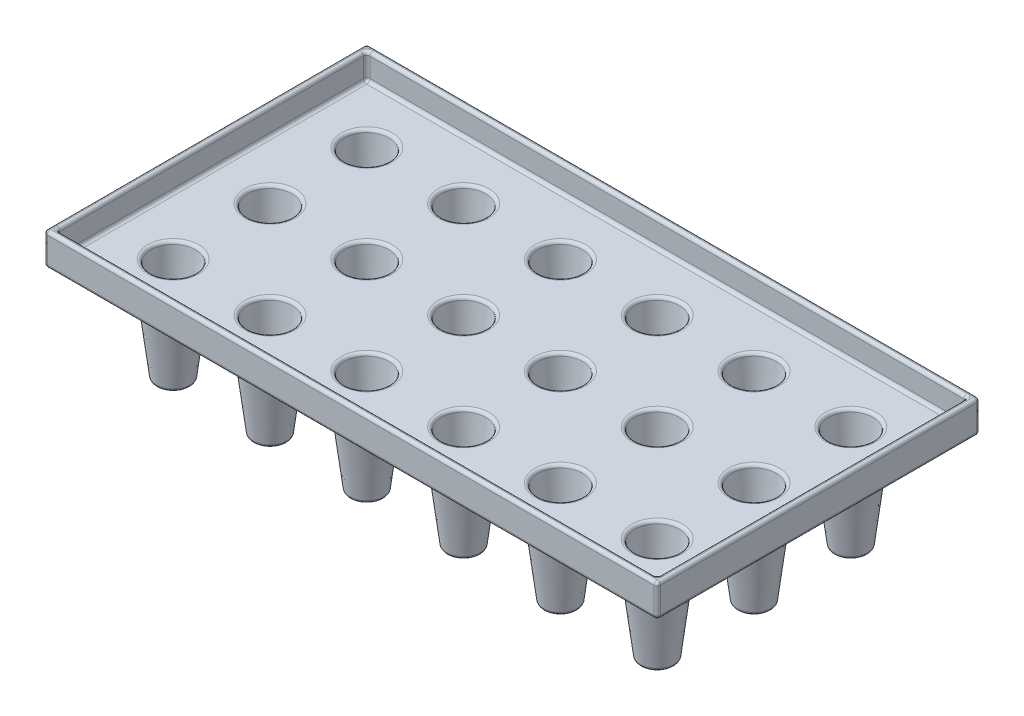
ISO-10303-21;
HEADER;
FILE_DESCRIPTION(('STEP AP214'),'2;1');
FILE_NAME('part.step','',(''),(''),'','','');
FILE_SCHEMA(('AUTOMOTIVE_DESIGN { 1 0 10303 214 1 1 1 1 }'));
ENDSEC;
DATA;
#1=APPLICATION_CONTEXT('core data for automotive mechanical design processes');
#2=APPLICATION_PROTOCOL_DEFINITION('international standard','automotive_design',2000,#1);
#3=PRODUCT_CONTEXT('',#1,'mechanical');
#4=PRODUCT('Part','Part','',(#3));
#5=PRODUCT_RELATED_PRODUCT_CATEGORY('part','',(#4));
#6=PRODUCT_DEFINITION_FORMATION('','',#4);
#7=PRODUCT_DEFINITION_CONTEXT('part definition',#1,'design');
#8=PRODUCT_DEFINITION('design','',#6,#7);
#9=PRODUCT_DEFINITION_SHAPE('','',#8);
#10=(LENGTH_UNIT() NAMED_UNIT(*) SI_UNIT(.MILLI.,.METRE.));
#11=(NAMED_UNIT(*) PLANE_ANGLE_UNIT() SI_UNIT($,.RADIAN.));
#12=(NAMED_UNIT(*) SI_UNIT($,.STERADIAN.) SOLID_ANGLE_UNIT());
#13=UNCERTAINTY_MEASURE_WITH_UNIT(LENGTH_MEASURE(1.E-05),#10,'distance_accuracy_value','');
#14=(GEOMETRIC_REPRESENTATION_CONTEXT(3) GLOBAL_UNCERTAINTY_ASSIGNED_CONTEXT((#13)) GLOBAL_UNIT_ASSIGNED_CONTEXT((#10,
#11,#12)) REPRESENTATION_CONTEXT('',''));
#15=CARTESIAN_POINT('',(0.,0.,0.));
#16=DIRECTION('',(0.,0.,1.));
#17=DIRECTION('',(1.,0.,0.));
#18=AXIS2_PLACEMENT_3D('',#15,#16,#17);
#19=CARTESIAN_POINT('',(0.,12.7,-127.));
#20=DIRECTION('',(0.,-1.,0.));
#21=DIRECTION('',(0.,0.,-1.));
#22=AXIS2_PLACEMENT_3D('',#19,#20,#21);
#23=PLANE('',#22);
#24=DIRECTION('',(0.,0.,-1.));
#25=VECTOR('',#24,1.);
#26=CARTESIAN_POINT('',(240.03,12.7,-127.));
#27=LINE('',#26,#25);
#28=CARTESIAN_POINT('',(240.03,12.7,-123.19));
#29=VERTEX_POINT('',#28);
#30=CARTESIAN_POINT('',(240.03,12.7,-125.73));
#31=VERTEX_POINT('',#30);
#32=EDGE_CURVE('E658',#29,#31,#27,.T.);
#33=ORIENTED_EDGE('',*,*,#32,.T.);
#34=DIRECTION('',(-1.,0.,0.));
#35=VECTOR('',#34,1.);
#36=CARTESIAN_POINT('',(0.,12.7,-125.73));
#37=LINE('',#36,#35);
#38=CARTESIAN_POINT('',(237.49,12.7,-125.73));
#39=VERTEX_POINT('',#38);
#40=EDGE_CURVE('E660',#31,#39,#37,.T.);
#41=ORIENTED_EDGE('',*,*,#40,.T.);
#42=CARTESIAN_POINT('',(237.49,12.7,-123.19));
#43=DIRECTION('',(0.,-1.,0.));
#44=DIRECTION('',(0.,0.,-1.));
#45=AXIS2_PLACEMENT_3D('',#42,#43,#44);
#46=CIRCLE('',#45,2.54);
#47=EDGE_CURVE('E655',#29,#39,#46,.F.);
#48=ORIENTED_EDGE('',*,*,#47,.F.);
#49=EDGE_LOOP('',(#33,#41,#48));
#50=FACE_BOUND('',#49,.T.);
#51=ADVANCED_FACE('F30',(#50),#23,.F.);
#52=DIRECTION('',(1.,0.,0.));
#53=VECTOR('',#52,1.);
#54=CARTESIAN_POINT('',(0.,12.7,-1.26999999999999));
#55=LINE('',#54,#53);
#56=CARTESIAN_POINT('',(237.49,12.7,-1.27));
#57=VERTEX_POINT('',#56);
#58=CARTESIAN_POINT('',(240.03,12.7,-1.26999999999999));
#59=VERTEX_POINT('',#58);
#60=EDGE_CURVE('E650',#57,#59,#55,.T.);
#61=ORIENTED_EDGE('',*,*,#60,.T.);
#62=DIRECTION('',(0.,0.,-1.));
#63=VECTOR('',#62,1.);
#64=CARTESIAN_POINT('',(240.03,12.7,-127.));
#65=LINE('',#64,#63);
#66=CARTESIAN_POINT('',(240.03,12.7,-3.81));
#67=VERTEX_POINT('',#66);
#68=EDGE_CURVE('E652',#59,#67,#65,.T.);
#69=ORIENTED_EDGE('',*,*,#68,.T.);
#70=CARTESIAN_POINT('',(237.49,12.7,-3.81));
#71=DIRECTION('',(0.,-1.,0.));
#72=DIRECTION('',(0.,0.,-1.));
#73=AXIS2_PLACEMENT_3D('',#70,#71,#72);
#74=CIRCLE('',#73,2.54);
#75=EDGE_CURVE('E648',#57,#67,#74,.F.);
#76=ORIENTED_EDGE('',*,*,#75,.F.);
#77=EDGE_LOOP('',(#61,#69,#76));
#78=FACE_BOUND('',#77,.T.);
#79=ADVANCED_FACE('F1018',(#78),#23,.F.);
#80=DIRECTION('',(0.,0.,1.));
#81=VECTOR('',#80,1.);
#82=CARTESIAN_POINT('',(1.27,12.7,-127.));
#83=LINE('',#82,#81);
#84=CARTESIAN_POINT('',(1.27,12.7,-3.81));
#85=VERTEX_POINT('',#84);
#86=CARTESIAN_POINT('',(1.27,12.7,-1.26999999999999));
#87=VERTEX_POINT('',#86);
#88=EDGE_CURVE('E643',#85,#87,#83,.T.);
#89=ORIENTED_EDGE('',*,*,#88,.T.);
#90=DIRECTION('',(1.,0.,0.));
#91=VECTOR('',#90,1.);
#92=CARTESIAN_POINT('',(0.,12.7,-1.26999999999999));
#93=LINE('',#92,#91);
#94=CARTESIAN_POINT('',(3.81,12.7,-1.27));
#95=VERTEX_POINT('',#94);
#96=EDGE_CURVE('E645',#87,#95,#93,.T.);
#97=ORIENTED_EDGE('',*,*,#96,.T.);
#98=CARTESIAN_POINT('',(3.81,12.7,-3.81));
#99=DIRECTION('',(0.,-1.,0.));
#100=DIRECTION('',(0.,0.,-1.));
#101=AXIS2_PLACEMENT_3D('',#98,#99,#100);
#102=CIRCLE('',#101,2.54);
#103=EDGE_CURVE('E640',#85,#95,#102,.F.);
#104=ORIENTED_EDGE('',*,*,#103,.F.);
#105=EDGE_LOOP('',(#89,#97,#104));
#106=FACE_BOUND('',#105,.T.);
#107=ADVANCED_FACE('F1057',(#106),#23,.F.);
#108=CARTESIAN_POINT('',(3.81,12.7,-123.19));
#109=DIRECTION('',(0.,-1.,0.));
#110=DIRECTION('',(0.,0.,-1.));
#111=AXIS2_PLACEMENT_3D('',#108,#109,#110);
#112=CIRCLE('',#111,2.54);
#113=CARTESIAN_POINT('',(3.81,12.7,-125.73));
#114=VERTEX_POINT('',#113);
#115=CARTESIAN_POINT('',(1.27,12.7,-123.19));
#116=VERTEX_POINT('',#115);
#117=EDGE_CURVE('E632',#114,#116,#112,.F.);
#118=ORIENTED_EDGE('',*,*,#117,.F.);
#119=DIRECTION('',(-1.,0.,0.));
#120=VECTOR('',#119,1.);
#121=CARTESIAN_POINT('',(0.,12.7,-125.73));
#122=LINE('',#121,#120);
#123=CARTESIAN_POINT('',(1.27,12.7,-125.73));
#124=VERTEX_POINT('',#123);
#125=EDGE_CURVE('E637',#114,#124,#122,.T.);
#126=ORIENTED_EDGE('',*,*,#125,.T.);
#127=DIRECTION('',(0.,0.,1.));
#128=VECTOR('',#127,1.);
#129=CARTESIAN_POINT('',(1.27,12.7,-127.));
#130=LINE('',#129,#128);
#131=EDGE_CURVE('E635',#124,#116,#130,.T.);
#132=ORIENTED_EDGE('',*,*,#131,.T.);
#133=EDGE_LOOP('',(#118,#126,#132));
#134=FACE_BOUND('',#133,.T.);
#135=ADVANCED_FACE('F969',(#134),#23,.F.);
#136=CARTESIAN_POINT('',(0.,12.7,0.));
#137=DIRECTION('',(1.,0.,0.));
#138=DIRECTION('',(0.,0.,-1.));
#139=AXIS2_PLACEMENT_3D('',#136,#137,#138);
#140=PLANE('',#139);
#141=DIRECTION('',(0.,-1.,0.));
#142=VECTOR('',#141,1.);
#143=CARTESIAN_POINT('',(0.,12.7,-1.27));
#144=LINE('',#143,#142);
#145=CARTESIAN_POINT('',(0.,1.27,-1.27));
#146=VERTEX_POINT('',#145);
#147=CARTESIAN_POINT('',(0.,11.43,-1.27));
#148=VERTEX_POINT('',#147);
#149=EDGE_CURVE('E609',#146,#148,#144,.F.);
#150=ORIENTED_EDGE('',*,*,#149,.T.);
#151=DIRECTION('',(0.,0.,1.));
#152=VECTOR('',#151,1.);
#153=CARTESIAN_POINT('',(0.,11.43,0.));
#154=LINE('',#153,#152);
#155=CARTESIAN_POINT('',(0.,11.43,-125.73));
#156=VERTEX_POINT('',#155);
#157=EDGE_CURVE('E612',#148,#156,#154,.F.);
#158=ORIENTED_EDGE('',*,*,#157,.T.);
#159=DIRECTION('',(0.,-1.,0.));
#160=VECTOR('',#159,1.);
#161=CARTESIAN_POINT('',(0.,12.7,-125.73));
#162=LINE('',#161,#160);
#163=CARTESIAN_POINT('',(0.,1.27,-125.73));
#164=VERTEX_POINT('',#163);
#165=EDGE_CURVE('E607',#156,#164,#162,.T.);
#166=ORIENTED_EDGE('',*,*,#165,.T.);
#167=DIRECTION('',(0.,0.,1.));
#168=VECTOR('',#167,1.);
#169=CARTESIAN_POINT('',(0.,1.27,0.));
#170=LINE('',#169,#168);
#171=EDGE_CURVE('E605',#164,#146,#170,.T.);
#172=ORIENTED_EDGE('',*,*,#171,.T.);
#173=EDGE_LOOP('',(#150,#158,#166,#172));
#174=FACE_BOUND('',#173,.T.);
#175=ADVANCED_FACE('F928',(#174),#140,.F.);
#176=CARTESIAN_POINT('',(0.,12.7,0.));
#177=DIRECTION('',(0.,0.,-1.));
#178=DIRECTION('',(-1.,0.,0.));
#179=AXIS2_PLACEMENT_3D('',#176,#177,#178);
#180=PLANE('',#179);
#181=DIRECTION('',(0.,-1.,0.));
#182=VECTOR('',#181,1.);
#183=CARTESIAN_POINT('',(240.03,12.7,0.));
#184=LINE('',#183,#182);
#185=CARTESIAN_POINT('',(240.03,1.27,0.));
#186=VERTEX_POINT('',#185);
#187=CARTESIAN_POINT('',(240.03,11.43,0.));
#188=VERTEX_POINT('',#187);
#189=EDGE_CURVE('E599',#186,#188,#184,.F.);
#190=ORIENTED_EDGE('',*,*,#189,.T.);
#191=DIRECTION('',(1.,0.,0.));
#192=VECTOR('',#191,1.);
#193=CARTESIAN_POINT('',(0.,11.43,0.));
#194=LINE('',#193,#192);
#195=CARTESIAN_POINT('',(1.27,11.43,0.));
#196=VERTEX_POINT('',#195);
#197=EDGE_CURVE('E603',#188,#196,#194,.F.);
#198=ORIENTED_EDGE('',*,*,#197,.T.);
#199=DIRECTION('',(0.,-1.,0.));
#200=VECTOR('',#199,1.);
#201=CARTESIAN_POINT('',(1.27,12.7,0.));
#202=LINE('',#201,#200);
#203=CARTESIAN_POINT('',(1.27,1.27,0.));
#204=VERTEX_POINT('',#203);
#205=EDGE_CURVE('E601',#196,#204,#202,.T.);
#206=ORIENTED_EDGE('',*,*,#205,.T.);
#207=DIRECTION('',(1.,0.,0.));
#208=VECTOR('',#207,1.);
#209=CARTESIAN_POINT('',(241.3,1.27,0.));
#210=LINE('',#209,#208);
#211=EDGE_CURVE('E232',#204,#186,#210,.T.);
#212=ORIENTED_EDGE('',*,*,#211,.T.);
#213=EDGE_LOOP('',(#190,#198,#206,#212));
#214=FACE_BOUND('',#213,.T.);
#215=ADVANCED_FACE('F1065',(#214),#180,.F.);
#216=CARTESIAN_POINT('',(241.3,12.7,0.));
#217=DIRECTION('',(-1.,0.,0.));
#218=DIRECTION('',(0.,0.,1.));
#219=AXIS2_PLACEMENT_3D('',#216,#217,#218);
#220=PLANE('',#219);
#221=DIRECTION('',(0.,-1.,0.));
#222=VECTOR('',#221,1.);
#223=CARTESIAN_POINT('',(241.3,12.7,-125.73));
#224=LINE('',#223,#222);
#225=CARTESIAN_POINT('',(241.3,1.27,-125.73));
#226=VERTEX_POINT('',#225);
#227=CARTESIAN_POINT('',(241.3,11.43,-125.73));
#228=VERTEX_POINT('',#227);
#229=EDGE_CURVE('E616',#226,#228,#224,.F.);
#230=ORIENTED_EDGE('',*,*,#229,.T.);
#231=DIRECTION('',(0.,0.,-1.));
#232=VECTOR('',#231,1.);
#233=CARTESIAN_POINT('',(241.3,11.43,0.));
#234=LINE('',#233,#232);
#235=CARTESIAN_POINT('',(241.3,11.43,-1.27));
#236=VERTEX_POINT('',#235);
#237=EDGE_CURVE('E621',#228,#236,#234,.F.);
#238=ORIENTED_EDGE('',*,*,#237,.T.);
#239=DIRECTION('',(0.,-1.,0.));
#240=VECTOR('',#239,1.);
#241=CARTESIAN_POINT('',(241.3,12.7,-1.27));
#242=LINE('',#241,#240);
#243=CARTESIAN_POINT('',(241.3,1.27,-1.27));
#244=VERTEX_POINT('',#243);
#245=EDGE_CURVE('E618',#236,#244,#242,.T.);
#246=ORIENTED_EDGE('',*,*,#245,.T.);
#247=DIRECTION('',(0.,0.,-1.));
#248=VECTOR('',#247,1.);
#249=CARTESIAN_POINT('',(241.3,1.27,-127.));
#250=LINE('',#249,#248);
#251=EDGE_CURVE('E614',#244,#226,#250,.T.);
#252=ORIENTED_EDGE('',*,*,#251,.T.);
#253=EDGE_LOOP('',(#230,#238,#246,#252));
#254=FACE_BOUND('',#253,.T.);
#255=ADVANCED_FACE('F1032',(#254),#220,.F.);
#256=CARTESIAN_POINT('',(0.,12.7,-127.));
#257=DIRECTION('',(0.,0.,1.));
#258=DIRECTION('',(1.,0.,0.));
#259=AXIS2_PLACEMENT_3D('',#256,#257,#258);
#260=PLANE('',#259);
#261=DIRECTION('',(0.,-1.,0.));
#262=VECTOR('',#261,1.);
#263=CARTESIAN_POINT('',(1.27,12.7,-127.));
#264=LINE('',#263,#262);
#265=CARTESIAN_POINT('',(1.27,1.27,-127.));
#266=VERTEX_POINT('',#265);
#267=CARTESIAN_POINT('',(1.27,11.43,-127.));
#268=VERTEX_POINT('',#267);
#269=EDGE_CURVE('E625',#266,#268,#264,.F.);
#270=ORIENTED_EDGE('',*,*,#269,.T.);
#271=DIRECTION('',(-1.,0.,0.));
#272=VECTOR('',#271,1.);
#273=CARTESIAN_POINT('',(0.,11.43,-127.));
#274=LINE('',#273,#272);
#275=CARTESIAN_POINT('',(240.03,11.43,-127.));
#276=VERTEX_POINT('',#275);
#277=EDGE_CURVE('E630',#268,#276,#274,.F.);
#278=ORIENTED_EDGE('',*,*,#277,.T.);
#279=DIRECTION('',(0.,-1.,0.));
#280=VECTOR('',#279,1.);
#281=CARTESIAN_POINT('',(240.03,12.7,-127.));
#282=LINE('',#281,#280);
#283=CARTESIAN_POINT('',(240.03,1.27,-127.));
#284=VERTEX_POINT('',#283);
#285=EDGE_CURVE('E627',#276,#284,#282,.T.);
#286=ORIENTED_EDGE('',*,*,#285,.T.);
#287=DIRECTION('',(-1.,0.,0.));
#288=VECTOR('',#287,1.);
#289=CARTESIAN_POINT('',(0.,1.27,-127.));
#290=LINE('',#289,#288);
#291=EDGE_CURVE('E623',#284,#266,#290,.T.);
#292=ORIENTED_EDGE('',*,*,#291,.T.);
#293=EDGE_LOOP('',(#270,#278,#286,#292));
#294=FACE_BOUND('',#293,.T.);
#295=ADVANCED_FACE('F952',(#294),#260,.F.);
#296=CARTESIAN_POINT('',(0.,0.,-127.));
#297=DIRECTION('',(0.,-1.,0.));
#298=DIRECTION('',(0.,0.,-1.));
#299=AXIS2_PLACEMENT_3D('',#296,#297,#298);
#300=PLANE('',#299);
#301=CARTESIAN_POINT('',(215.9,0.,-101.6));
#302=DIRECTION('',(0.,-1.,0.));
#303=DIRECTION('',(0.,0.,-1.));
#304=AXIS2_PLACEMENT_3D('',#301,#302,#303);
#305=CIRCLE('',#304,12.2642371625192);
#306=CARTESIAN_POINT('',(215.9,0.,-113.864237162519));
#307=VERTEX_POINT('',#306);
#308=EDGE_CURVE('E448',#307,#307,#305,.F.);
#309=ORIENTED_EDGE('',*,*,#308,.T.);
#310=EDGE_LOOP('',(#309));
#311=FACE_BOUND('',#310,.T.);
#312=CARTESIAN_POINT('',(177.8,0.,-101.6));
#313=DIRECTION('',(0.,-1.,0.));
#314=DIRECTION('',(0.,0.,-1.));
#315=AXIS2_PLACEMENT_3D('',#312,#313,#314);
#316=CIRCLE('',#315,12.2642371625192);
#317=CARTESIAN_POINT('',(177.8,0.,-113.864237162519));
#318=VERTEX_POINT('',#317);
#319=EDGE_CURVE('E445',#318,#318,#316,.F.);
#320=ORIENTED_EDGE('',*,*,#319,.T.);
#321=EDGE_LOOP('',(#320));
#322=FACE_BOUND('',#321,.T.);
#323=CARTESIAN_POINT('',(139.7,0.,-101.6));
#324=DIRECTION('',(0.,-1.,0.));
#325=DIRECTION('',(0.,0.,-1.));
#326=AXIS2_PLACEMENT_3D('',#323,#324,#325);
#327=CIRCLE('',#326,12.2642371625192);
#328=CARTESIAN_POINT('',(139.7,0.,-113.864237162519));
#329=VERTEX_POINT('',#328);
#330=EDGE_CURVE('E442',#329,#329,#327,.F.);
#331=ORIENTED_EDGE('',*,*,#330,.T.);
#332=EDGE_LOOP('',(#331));
#333=FACE_BOUND('',#332,.T.);
#334=CARTESIAN_POINT('',(101.6,0.,-101.6));
#335=DIRECTION('',(0.,-1.,0.));
#336=DIRECTION('',(0.,0.,-1.));
#337=AXIS2_PLACEMENT_3D('',#334,#335,#336);
#338=CIRCLE('',#337,12.2642371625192);
#339=CARTESIAN_POINT('',(101.6,0.,-113.864237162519));
#340=VERTEX_POINT('',#339);
#341=EDGE_CURVE('E439',#340,#340,#338,.F.);
#342=ORIENTED_EDGE('',*,*,#341,.T.);
#343=EDGE_LOOP('',(#342));
#344=FACE_BOUND('',#343,.T.);
#345=CARTESIAN_POINT('',(63.5,0.,-101.6));
#346=DIRECTION('',(0.,-1.,0.));
#347=DIRECTION('',(0.,0.,-1.));
#348=AXIS2_PLACEMENT_3D('',#345,#346,#347);
#349=CIRCLE('',#348,12.2642371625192);
#350=CARTESIAN_POINT('',(63.5,0.,-113.864237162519));
#351=VERTEX_POINT('',#350);
#352=EDGE_CURVE('E436',#351,#351,#349,.F.);
#353=ORIENTED_EDGE('',*,*,#352,.T.);
#354=EDGE_LOOP('',(#353));
#355=FACE_BOUND('',#354,.T.);
#356=CARTESIAN_POINT('',(25.4,0.,-101.6));
#357=DIRECTION('',(0.,-1.,0.));
#358=DIRECTION('',(0.,0.,-1.));
#359=AXIS2_PLACEMENT_3D('',#356,#357,#358);
#360=CIRCLE('',#359,12.2642371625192);
#361=CARTESIAN_POINT('',(25.4,0.,-113.864237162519));
#362=VERTEX_POINT('',#361);
#363=EDGE_CURVE('E433',#362,#362,#360,.F.);
#364=ORIENTED_EDGE('',*,*,#363,.T.);
#365=EDGE_LOOP('',(#364));
#366=FACE_BOUND('',#365,.T.);
#367=CARTESIAN_POINT('',(215.9,0.,-63.5));
#368=DIRECTION('',(0.,-1.,0.));
#369=DIRECTION('',(0.,0.,-1.));
#370=AXIS2_PLACEMENT_3D('',#367,#368,#369);
#371=CIRCLE('',#370,12.2642371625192);
#372=CARTESIAN_POINT('',(215.9,0.,-75.7642371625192));
#373=VERTEX_POINT('',#372);
#374=EDGE_CURVE('E430',#373,#373,#371,.F.);
#375=ORIENTED_EDGE('',*,*,#374,.T.);
#376=EDGE_LOOP('',(#375));
#377=FACE_BOUND('',#376,.T.);
#378=CARTESIAN_POINT('',(177.8,0.,-63.5));
#379=DIRECTION('',(0.,-1.,0.));
#380=DIRECTION('',(0.,0.,-1.));
#381=AXIS2_PLACEMENT_3D('',#378,#379,#380);
#382=CIRCLE('',#381,12.2642371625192);
#383=CARTESIAN_POINT('',(177.8,0.,-75.7642371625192));
#384=VERTEX_POINT('',#383);
#385=EDGE_CURVE('E427',#384,#384,#382,.F.);
#386=ORIENTED_EDGE('',*,*,#385,.T.);
#387=EDGE_LOOP('',(#386));
#388=FACE_BOUND('',#387,.T.);
#389=CARTESIAN_POINT('',(139.7,0.,-63.5));
#390=DIRECTION('',(0.,-1.,0.));
#391=DIRECTION('',(0.,0.,-1.));
#392=AXIS2_PLACEMENT_3D('',#389,#390,#391);
#393=CIRCLE('',#392,12.2642371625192);
#394=CARTESIAN_POINT('',(139.7,0.,-75.7642371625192));
#395=VERTEX_POINT('',#394);
#396=EDGE_CURVE('E424',#395,#395,#393,.F.);
#397=ORIENTED_EDGE('',*,*,#396,.T.);
#398=EDGE_LOOP('',(#397));
#399=FACE_BOUND('',#398,.T.);
#400=CARTESIAN_POINT('',(101.6,0.,-63.5));
#401=DIRECTION('',(0.,-1.,0.));
#402=DIRECTION('',(0.,0.,-1.));
#403=AXIS2_PLACEMENT_3D('',#400,#401,#402);
#404=CIRCLE('',#403,12.2642371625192);
#405=CARTESIAN_POINT('',(101.6,0.,-75.7642371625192));
#406=VERTEX_POINT('',#405);
#407=EDGE_CURVE('E421',#406,#406,#404,.F.);
#408=ORIENTED_EDGE('',*,*,#407,.T.);
#409=EDGE_LOOP('',(#408));
#410=FACE_BOUND('',#409,.T.);
#411=CARTESIAN_POINT('',(63.5,0.,-63.5));
#412=DIRECTION('',(0.,-1.,0.));
#413=DIRECTION('',(0.,0.,-1.));
#414=AXIS2_PLACEMENT_3D('',#411,#412,#413);
#415=CIRCLE('',#414,12.2642371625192);
#416=CARTESIAN_POINT('',(63.5,0.,-75.7642371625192));
#417=VERTEX_POINT('',#416);
#418=EDGE_CURVE('E418',#417,#417,#415,.F.);
#419=ORIENTED_EDGE('',*,*,#418,.T.);
#420=EDGE_LOOP('',(#419));
#421=FACE_BOUND('',#420,.T.);
#422=CARTESIAN_POINT('',(25.4,0.,-63.5));
#423=DIRECTION('',(0.,-1.,0.));
#424=DIRECTION('',(0.,0.,-1.));
#425=AXIS2_PLACEMENT_3D('',#422,#423,#424);
#426=CIRCLE('',#425,12.2642371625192);
#427=CARTESIAN_POINT('',(25.4,0.,-75.7642371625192));
#428=VERTEX_POINT('',#427);
#429=EDGE_CURVE('E415',#428,#428,#426,.F.);
#430=ORIENTED_EDGE('',*,*,#429,.T.);
#431=EDGE_LOOP('',(#430));
#432=FACE_BOUND('',#431,.T.);
#433=CARTESIAN_POINT('',(215.9,0.,-25.4));
#434=DIRECTION('',(0.,-1.,0.));
#435=DIRECTION('',(0.,0.,-1.));
#436=AXIS2_PLACEMENT_3D('',#433,#434,#435);
#437=CIRCLE('',#436,12.2642371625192);
#438=CARTESIAN_POINT('',(215.9,0.,-37.6642371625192));
#439=VERTEX_POINT('',#438);
#440=EDGE_CURVE('E412',#439,#439,#437,.F.);
#441=ORIENTED_EDGE('',*,*,#440,.T.);
#442=EDGE_LOOP('',(#441));
#443=FACE_BOUND('',#442,.T.);
#444=CARTESIAN_POINT('',(177.8,0.,-25.4));
#445=DIRECTION('',(0.,-1.,0.));
#446=DIRECTION('',(0.,0.,-1.));
#447=AXIS2_PLACEMENT_3D('',#444,#445,#446);
#448=CIRCLE('',#447,12.2642371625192);
#449=CARTESIAN_POINT('',(177.8,0.,-37.6642371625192));
#450=VERTEX_POINT('',#449);
#451=EDGE_CURVE('E409',#450,#450,#448,.F.);
#452=ORIENTED_EDGE('',*,*,#451,.T.);
#453=EDGE_LOOP('',(#452));
#454=FACE_BOUND('',#453,.T.);
#455=CARTESIAN_POINT('',(139.7,0.,-25.4));
#456=DIRECTION('',(0.,-1.,0.));
#457=DIRECTION('',(0.,0.,-1.));
#458=AXIS2_PLACEMENT_3D('',#455,#456,#457);
#459=CIRCLE('',#458,12.2642371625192);
#460=CARTESIAN_POINT('',(139.7,0.,-37.6642371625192));
#461=VERTEX_POINT('',#460);
#462=EDGE_CURVE('E406',#461,#461,#459,.F.);
#463=ORIENTED_EDGE('',*,*,#462,.T.);
#464=EDGE_LOOP('',(#463));
#465=FACE_BOUND('',#464,.T.);
#466=CARTESIAN_POINT('',(101.6,0.,-25.4));
#467=DIRECTION('',(0.,-1.,0.));
#468=DIRECTION('',(0.,0.,-1.));
#469=AXIS2_PLACEMENT_3D('',#466,#467,#468);
#470=CIRCLE('',#469,12.2642371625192);
#471=CARTESIAN_POINT('',(101.6,0.,-37.6642371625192));
#472=VERTEX_POINT('',#471);
#473=EDGE_CURVE('E403',#472,#472,#470,.F.);
#474=ORIENTED_EDGE('',*,*,#473,.T.);
#475=EDGE_LOOP('',(#474));
#476=FACE_BOUND('',#475,.T.);
#477=CARTESIAN_POINT('',(63.5,0.,-25.4));
#478=DIRECTION('',(0.,-1.,0.));
#479=DIRECTION('',(0.,0.,-1.));
#480=AXIS2_PLACEMENT_3D('',#477,#478,#479);
#481=CIRCLE('',#480,12.2642371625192);
#482=CARTESIAN_POINT('',(63.5,0.,-37.6642371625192));
#483=VERTEX_POINT('',#482);
#484=EDGE_CURVE('E400',#483,#483,#481,.F.);
#485=ORIENTED_EDGE('',*,*,#484,.T.);
#486=EDGE_LOOP('',(#485));
#487=FACE_BOUND('',#486,.T.);
#488=CARTESIAN_POINT('',(25.4,0.,-25.4));
#489=DIRECTION('',(0.,-1.,0.));
#490=DIRECTION('',(0.,0.,-1.));
#491=AXIS2_PLACEMENT_3D('',#488,#489,#490);
#492=CIRCLE('',#491,12.2642371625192);
#493=CARTESIAN_POINT('',(25.4,0.,-37.6642371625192));
#494=VERTEX_POINT('',#493);
#495=EDGE_CURVE('E397',#494,#494,#492,.F.);
#496=ORIENTED_EDGE('',*,*,#495,.T.);
#497=EDGE_LOOP('',(#496));
#498=FACE_BOUND('',#497,.T.);
#499=DIRECTION('',(0.,0.,1.));
#500=VECTOR('',#499,1.);
#501=CARTESIAN_POINT('',(1.27,0.,-127.));
#502=LINE('',#501,#500);
#503=CARTESIAN_POINT('',(1.27,0.,-1.27));
#504=VERTEX_POINT('',#503);
#505=CARTESIAN_POINT('',(1.27,0.,-125.73));
#506=VERTEX_POINT('',#505);
#507=EDGE_CURVE('E208',#504,#506,#502,.F.);
#508=ORIENTED_EDGE('',*,*,#507,.T.);
#509=DIRECTION('',(-1.,0.,0.));
#510=VECTOR('',#509,1.);
#511=CARTESIAN_POINT('',(241.3,0.,-125.73));
#512=LINE('',#511,#510);
#513=CARTESIAN_POINT('',(240.03,0.,-125.73));
#514=VERTEX_POINT('',#513);
#515=EDGE_CURVE('E395',#506,#514,#512,.F.);
#516=ORIENTED_EDGE('',*,*,#515,.T.);
#517=DIRECTION('',(0.,0.,-1.));
#518=VECTOR('',#517,1.);
#519=CARTESIAN_POINT('',(240.03,0.,0.));
#520=LINE('',#519,#518);
#521=CARTESIAN_POINT('',(240.03,0.,-1.27));
#522=VERTEX_POINT('',#521);
#523=EDGE_CURVE('E210',#514,#522,#520,.F.);
#524=ORIENTED_EDGE('',*,*,#523,.T.);
#525=DIRECTION('',(1.,0.,0.));
#526=VECTOR('',#525,1.);
#527=CARTESIAN_POINT('',(0.,0.,-1.27));
#528=LINE('',#527,#526);
#529=EDGE_CURVE('E204',#522,#504,#528,.F.);
#530=ORIENTED_EDGE('',*,*,#529,.T.);
#531=EDGE_LOOP('',(#508,#516,#524,#530));
#532=FACE_BOUND('',#531,.T.);
#533=ADVANCED_FACE('F206',(#311,#322,#333,#344,#355,#366,#377,#388,#399,#410,#421,#432,#443,
#454,#465,#476,#487,#498,#532),#300,.T.);
#534=CARTESIAN_POINT('',(25.4,12.7,-25.4));
#535=DIRECTION('',(0.,1.,0.));
#536=DIRECTION('',(0.,0.,1.));
#537=AXIS2_PLACEMENT_3D('',#534,#535,#536);
#538=CONICAL_SURFACE('',#537,12.7,0.122173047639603);
#539=CARTESIAN_POINT('',(25.4,-1.11522593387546,-25.4));
#540=DIRECTION('',(0.,1.,0.));
#541=DIRECTION('',(0.,0.,1.));
#542=AXIS2_PLACEMENT_3D('',#539,#540,#541);
#543=CIRCLE('',#542,11.0037035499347);
#544=CARTESIAN_POINT('',(25.4,-1.11522593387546,-14.3962964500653));
#545=VERTEX_POINT('',#544);
#546=EDGE_CURVE('E595',#545,#545,#543,.F.);
#547=ORIENTED_EDGE('',*,*,#546,.T.);
#548=EDGE_LOOP('',(#547));
#549=FACE_BOUND('',#548,.T.);
#550=CARTESIAN_POINT('',(25.4,-36.9847740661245,-25.4));
#551=DIRECTION('',(0.,1.,0.));
#552=DIRECTION('',(0.,0.,1.));
#553=AXIS2_PLACEMENT_3D('',#550,#551,#552);
#554=CIRCLE('',#553,6.59947683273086);
#555=CARTESIAN_POINT('',(25.4,-36.9847740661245,-18.8005231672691));
#556=VERTEX_POINT('',#555);
#557=EDGE_CURVE('E592',#556,#556,#554,.T.);
#558=ORIENTED_EDGE('',*,*,#557,.T.);
#559=EDGE_LOOP('',(#558));
#560=FACE_BOUND('',#559,.T.);
#561=ADVANCED_FACE('F1708',(#549,#560),#538,.T.);
#562=CARTESIAN_POINT('',(25.4,-38.1,-25.4));
#563=DIRECTION('',(0.,1.,0.));
#564=DIRECTION('',(0.,0.,1.));
#565=AXIS2_PLACEMENT_3D('',#562,#563,#564);
#566=PLANE('',#565);
#567=CARTESIAN_POINT('',(25.4,-38.1,-25.4));
#568=DIRECTION('',(0.,1.,0.));
#569=DIRECTION('',(0.,0.,1.));
#570=AXIS2_PLACEMENT_3D('',#567,#568,#569);
#571=CIRCLE('',#570,5.33894322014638);
#572=CARTESIAN_POINT('',(25.4,-38.1,-20.0610567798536));
#573=VERTEX_POINT('',#572);
#574=EDGE_CURVE('E663',#573,#573,#571,.F.);
#575=ORIENTED_EDGE('',*,*,#574,.T.);
#576=EDGE_LOOP('',(#575));
#577=FACE_BOUND('',#576,.T.);
#578=ADVANCED_FACE('F1711',(#577),#566,.F.);
#579=CARTESIAN_POINT('',(63.5,12.7,-25.4));
#580=DIRECTION('',(0.,1.,0.));
#581=DIRECTION('',(0.,0.,1.));
#582=AXIS2_PLACEMENT_3D('',#579,#580,#581);
#583=CONICAL_SURFACE('',#582,12.7,0.122173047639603);
#584=CARTESIAN_POINT('',(63.5,-1.11522593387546,-25.4));
#585=DIRECTION('',(0.,1.,0.));
#586=DIRECTION('',(0.,0.,1.));
#587=AXIS2_PLACEMENT_3D('',#584,#585,#586);
#588=CIRCLE('',#587,11.0037035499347);
#589=CARTESIAN_POINT('',(63.5,-1.11522593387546,-14.3962964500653));
#590=VERTEX_POINT('',#589);
#591=EDGE_CURVE('E589',#590,#590,#588,.F.);
#592=ORIENTED_EDGE('',*,*,#591,.T.);
#593=EDGE_LOOP('',(#592));
#594=FACE_BOUND('',#593,.T.);
#595=CARTESIAN_POINT('',(63.5,-36.9847740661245,-25.4));
#596=DIRECTION('',(0.,1.,0.));
#597=DIRECTION('',(0.,0.,1.));
#598=AXIS2_PLACEMENT_3D('',#595,#596,#597);
#599=CIRCLE('',#598,6.59947683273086);
#600=CARTESIAN_POINT('',(63.5,-36.9847740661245,-18.8005231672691));
#601=VERTEX_POINT('',#600);
#602=EDGE_CURVE('E586',#601,#601,#599,.T.);
#603=ORIENTED_EDGE('',*,*,#602,.T.);
#604=EDGE_LOOP('',(#603));
#605=FACE_BOUND('',#604,.T.);
#606=ADVANCED_FACE('F1718',(#594,#605),#583,.T.);
#607=CARTESIAN_POINT('',(63.5,-38.1,-25.4));
#608=DIRECTION('',(0.,1.,0.));
#609=DIRECTION('',(0.,0.,1.));
#610=AXIS2_PLACEMENT_3D('',#607,#608,#609);
#611=PLANE('',#610);
#612=CARTESIAN_POINT('',(63.5,-38.1,-25.4));
#613=DIRECTION('',(0.,1.,0.));
#614=DIRECTION('',(0.,0.,1.));
#615=AXIS2_PLACEMENT_3D('',#612,#613,#614);
#616=CIRCLE('',#615,5.33894322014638);
#617=CARTESIAN_POINT('',(63.5,-38.1,-20.0610567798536));
#618=VERTEX_POINT('',#617);
#619=EDGE_CURVE('E666',#618,#618,#616,.F.);
#620=ORIENTED_EDGE('',*,*,#619,.T.);
#621=EDGE_LOOP('',(#620));
#622=FACE_BOUND('',#621,.T.);
#623=ADVANCED_FACE('F1721',(#622),#611,.F.);
#624=CARTESIAN_POINT('',(101.6,-38.1,-25.4));
#625=DIRECTION('',(0.,1.,0.));
#626=DIRECTION('',(0.,0.,1.));
#627=AXIS2_PLACEMENT_3D('',#624,#625,#626);
#628=PLANE('',#627);
#629=CARTESIAN_POINT('',(101.6,-38.1,-25.4));
#630=DIRECTION('',(0.,1.,0.));
#631=DIRECTION('',(0.,0.,1.));
#632=AXIS2_PLACEMENT_3D('',#629,#630,#631);
#633=CIRCLE('',#632,5.33894322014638);
#634=CARTESIAN_POINT('',(101.6,-38.1,-20.0610567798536));
#635=VERTEX_POINT('',#634);
#636=EDGE_CURVE('E583',#635,#635,#633,.F.);
#637=ORIENTED_EDGE('',*,*,#636,.T.);
#638=EDGE_LOOP('',(#637));
#639=FACE_BOUND('',#638,.T.);
#640=ADVANCED_FACE('F1727',(#639),#628,.F.);
#641=CARTESIAN_POINT('',(101.6,12.7,-25.4));
#642=DIRECTION('',(0.,1.,0.));
#643=DIRECTION('',(0.,0.,1.));
#644=AXIS2_PLACEMENT_3D('',#641,#642,#643);
#645=CONICAL_SURFACE('',#644,12.7,0.122173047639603);
#646=CARTESIAN_POINT('',(101.6,-36.9847740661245,-25.4));
#647=DIRECTION('',(0.,1.,0.));
#648=DIRECTION('',(0.,0.,1.));
#649=AXIS2_PLACEMENT_3D('',#646,#647,#648);
#650=CIRCLE('',#649,6.59947683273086);
#651=CARTESIAN_POINT('',(101.6,-36.9847740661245,-18.8005231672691));
#652=VERTEX_POINT('',#651);
#653=EDGE_CURVE('E580',#652,#652,#650,.T.);
#654=ORIENTED_EDGE('',*,*,#653,.T.);
#655=EDGE_LOOP('',(#654));
#656=FACE_BOUND('',#655,.T.);
#657=CARTESIAN_POINT('',(101.6,-1.11522593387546,-25.4));
#658=DIRECTION('',(0.,1.,0.));
#659=DIRECTION('',(0.,0.,1.));
#660=AXIS2_PLACEMENT_3D('',#657,#658,#659);
#661=CIRCLE('',#660,11.0037035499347);
#662=CARTESIAN_POINT('',(101.6,-1.11522593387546,-14.3962964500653));
#663=VERTEX_POINT('',#662);
#664=EDGE_CURVE('E577',#663,#663,#661,.F.);
#665=ORIENTED_EDGE('',*,*,#664,.T.);
#666=EDGE_LOOP('',(#665));
#667=FACE_BOUND('',#666,.T.);
#668=ADVANCED_FACE('F2800',(#656,#667),#645,.T.);
#669=CARTESIAN_POINT('',(139.7,-38.1,-25.4));
#670=DIRECTION('',(0.,1.,0.));
#671=DIRECTION('',(0.,0.,1.));
#672=AXIS2_PLACEMENT_3D('',#669,#670,#671);
#673=PLANE('',#672);
#674=CARTESIAN_POINT('',(139.7,-38.1,-25.4));
#675=DIRECTION('',(0.,1.,0.));
#676=DIRECTION('',(0.,0.,1.));
#677=AXIS2_PLACEMENT_3D('',#674,#675,#676);
#678=CIRCLE('',#677,5.33894322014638);
#679=CARTESIAN_POINT('',(139.7,-38.1,-20.0610567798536));
#680=VERTEX_POINT('',#679);
#681=EDGE_CURVE('E574',#680,#680,#678,.F.);
#682=ORIENTED_EDGE('',*,*,#681,.T.);
#683=EDGE_LOOP('',(#682));
#684=FACE_BOUND('',#683,.T.);
#685=ADVANCED_FACE('F2791',(#684),#673,.F.);
#686=CARTESIAN_POINT('',(139.7,12.7,-25.4));
#687=DIRECTION('',(0.,1.,0.));
#688=DIRECTION('',(0.,0.,1.));
#689=AXIS2_PLACEMENT_3D('',#686,#687,#688);
#690=CONICAL_SURFACE('',#689,12.7,0.122173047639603);
#691=CARTESIAN_POINT('',(139.7,-36.9847740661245,-25.4));
#692=DIRECTION('',(0.,1.,0.));
#693=DIRECTION('',(0.,0.,1.));
#694=AXIS2_PLACEMENT_3D('',#691,#692,#693);
#695=CIRCLE('',#694,6.59947683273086);
#696=CARTESIAN_POINT('',(139.7,-36.9847740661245,-18.8005231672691));
#697=VERTEX_POINT('',#696);
#698=EDGE_CURVE('E571',#697,#697,#695,.T.);
#699=ORIENTED_EDGE('',*,*,#698,.T.);
#700=EDGE_LOOP('',(#699));
#701=FACE_BOUND('',#700,.T.);
#702=CARTESIAN_POINT('',(139.7,-1.11522593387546,-25.4));
#703=DIRECTION('',(0.,1.,0.));
#704=DIRECTION('',(0.,0.,1.));
#705=AXIS2_PLACEMENT_3D('',#702,#703,#704);
#706=CIRCLE('',#705,11.0037035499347);
#707=CARTESIAN_POINT('',(139.7,-1.11522593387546,-14.3962964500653));
#708=VERTEX_POINT('',#707);
#709=EDGE_CURVE('E568',#708,#708,#706,.F.);
#710=ORIENTED_EDGE('',*,*,#709,.T.);
#711=EDGE_LOOP('',(#710));
#712=FACE_BOUND('',#711,.T.);
#713=ADVANCED_FACE('F2782',(#701,#712),#690,.T.);
#714=CARTESIAN_POINT('',(177.8,-38.1,-25.4));
#715=DIRECTION('',(0.,1.,0.));
#716=DIRECTION('',(0.,0.,1.));
#717=AXIS2_PLACEMENT_3D('',#714,#715,#716);
#718=PLANE('',#717);
#719=CARTESIAN_POINT('',(177.8,-38.1,-25.4));
#720=DIRECTION('',(0.,1.,0.));
#721=DIRECTION('',(0.,0.,1.));
#722=AXIS2_PLACEMENT_3D('',#719,#720,#721);
#723=CIRCLE('',#722,5.33894322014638);
#724=CARTESIAN_POINT('',(177.8,-38.1,-20.0610567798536));
#725=VERTEX_POINT('',#724);
#726=EDGE_CURVE('E565',#725,#725,#723,.F.);
#727=ORIENTED_EDGE('',*,*,#726,.T.);
#728=EDGE_LOOP('',(#727));
#729=FACE_BOUND('',#728,.T.);
#730=ADVANCED_FACE('F2773',(#729),#718,.F.);
#731=CARTESIAN_POINT('',(177.8,12.7,-25.4));
#732=DIRECTION('',(0.,1.,0.));
#733=DIRECTION('',(0.,0.,1.));
#734=AXIS2_PLACEMENT_3D('',#731,#732,#733);
#735=CONICAL_SURFACE('',#734,12.7,0.122173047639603);
#736=CARTESIAN_POINT('',(177.8,-36.9847740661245,-25.4));
#737=DIRECTION('',(0.,1.,0.));
#738=DIRECTION('',(0.,0.,1.));
#739=AXIS2_PLACEMENT_3D('',#736,#737,#738);
#740=CIRCLE('',#739,6.59947683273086);
#741=CARTESIAN_POINT('',(177.8,-36.9847740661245,-18.8005231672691));
#742=VERTEX_POINT('',#741);
#743=EDGE_CURVE('E562',#742,#742,#740,.T.);
#744=ORIENTED_EDGE('',*,*,#743,.T.);
#745=EDGE_LOOP('',(#744));
#746=FACE_BOUND('',#745,.T.);
#747=CARTESIAN_POINT('',(177.8,-1.11522593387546,-25.4));
#748=DIRECTION('',(0.,1.,0.));
#749=DIRECTION('',(0.,0.,1.));
#750=AXIS2_PLACEMENT_3D('',#747,#748,#749);
#751=CIRCLE('',#750,11.0037035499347);
#752=CARTESIAN_POINT('',(177.8,-1.11522593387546,-14.3962964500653));
#753=VERTEX_POINT('',#752);
#754=EDGE_CURVE('E559',#753,#753,#751,.F.);
#755=ORIENTED_EDGE('',*,*,#754,.T.);
#756=EDGE_LOOP('',(#755));
#757=FACE_BOUND('',#756,.T.);
#758=ADVANCED_FACE('F2764',(#746,#757),#735,.T.);
#759=CARTESIAN_POINT('',(215.9,-38.1,-25.4));
#760=DIRECTION('',(0.,1.,0.));
#761=DIRECTION('',(0.,0.,1.));
#762=AXIS2_PLACEMENT_3D('',#759,#760,#761);
#763=PLANE('',#762);
#764=CARTESIAN_POINT('',(215.9,-38.1,-25.4));
#765=DIRECTION('',(0.,1.,0.));
#766=DIRECTION('',(0.,0.,1.));
#767=AXIS2_PLACEMENT_3D('',#764,#765,#766);
#768=CIRCLE('',#767,5.33894322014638);
#769=CARTESIAN_POINT('',(215.9,-38.1,-20.0610567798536));
#770=VERTEX_POINT('',#769);
#771=EDGE_CURVE('E556',#770,#770,#768,.F.);
#772=ORIENTED_EDGE('',*,*,#771,.T.);
#773=EDGE_LOOP('',(#772));
#774=FACE_BOUND('',#773,.T.);
#775=ADVANCED_FACE('F2755',(#774),#763,.F.);
#776=CARTESIAN_POINT('',(215.9,12.7,-25.4));
#777=DIRECTION('',(0.,1.,0.));
#778=DIRECTION('',(0.,0.,1.));
#779=AXIS2_PLACEMENT_3D('',#776,#777,#778);
#780=CONICAL_SURFACE('',#779,12.7,0.122173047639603);
#781=CARTESIAN_POINT('',(215.9,-36.9847740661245,-25.4));
#782=DIRECTION('',(0.,1.,0.));
#783=DIRECTION('',(0.,0.,1.));
#784=AXIS2_PLACEMENT_3D('',#781,#782,#783);
#785=CIRCLE('',#784,6.59947683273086);
#786=CARTESIAN_POINT('',(215.9,-36.9847740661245,-18.8005231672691));
#787=VERTEX_POINT('',#786);
#788=EDGE_CURVE('E553',#787,#787,#785,.T.);
#789=ORIENTED_EDGE('',*,*,#788,.T.);
#790=EDGE_LOOP('',(#789));
#791=FACE_BOUND('',#790,.T.);
#792=CARTESIAN_POINT('',(215.9,-1.11522593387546,-25.4));
#793=DIRECTION('',(0.,1.,0.));
#794=DIRECTION('',(0.,0.,1.));
#795=AXIS2_PLACEMENT_3D('',#792,#793,#794);
#796=CIRCLE('',#795,11.0037035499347);
#797=CARTESIAN_POINT('',(215.9,-1.11522593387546,-14.3962964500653));
#798=VERTEX_POINT('',#797);
#799=EDGE_CURVE('E550',#798,#798,#796,.F.);
#800=ORIENTED_EDGE('',*,*,#799,.T.);
#801=EDGE_LOOP('',(#800));
#802=FACE_BOUND('',#801,.T.);
#803=ADVANCED_FACE('F2746',(#791,#802),#780,.T.);
#804=CARTESIAN_POINT('',(25.4,-38.1,-63.5));
#805=DIRECTION('',(0.,1.,0.));
#806=DIRECTION('',(0.,0.,1.));
#807=AXIS2_PLACEMENT_3D('',#804,#805,#806);
#808=PLANE('',#807);
#809=CARTESIAN_POINT('',(25.4,-38.1,-63.5));
#810=DIRECTION('',(0.,1.,0.));
#811=DIRECTION('',(0.,0.,1.));
#812=AXIS2_PLACEMENT_3D('',#809,#810,#811);
#813=CIRCLE('',#812,5.33894322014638);
#814=CARTESIAN_POINT('',(25.4,-38.1,-58.1610567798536));
#815=VERTEX_POINT('',#814);
#816=EDGE_CURVE('E547',#815,#815,#813,.F.);
#817=ORIENTED_EDGE('',*,*,#816,.T.);
#818=EDGE_LOOP('',(#817));
#819=FACE_BOUND('',#818,.T.);
#820=ADVANCED_FACE('F2737',(#819),#808,.F.);
#821=CARTESIAN_POINT('',(25.4,12.7,-63.5));
#822=DIRECTION('',(0.,1.,0.));
#823=DIRECTION('',(0.,0.,1.));
#824=AXIS2_PLACEMENT_3D('',#821,#822,#823);
#825=CONICAL_SURFACE('',#824,12.7,0.122173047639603);
#826=CARTESIAN_POINT('',(25.4,-36.9847740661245,-63.5));
#827=DIRECTION('',(0.,1.,0.));
#828=DIRECTION('',(0.,0.,1.));
#829=AXIS2_PLACEMENT_3D('',#826,#827,#828);
#830=CIRCLE('',#829,6.59947683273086);
#831=CARTESIAN_POINT('',(25.4,-36.9847740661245,-56.9005231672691));
#832=VERTEX_POINT('',#831);
#833=EDGE_CURVE('E544',#832,#832,#830,.T.);
#834=ORIENTED_EDGE('',*,*,#833,.T.);
#835=EDGE_LOOP('',(#834));
#836=FACE_BOUND('',#835,.T.);
#837=CARTESIAN_POINT('',(25.4,-1.11522593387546,-63.5));
#838=DIRECTION('',(0.,1.,0.));
#839=DIRECTION('',(0.,0.,1.));
#840=AXIS2_PLACEMENT_3D('',#837,#838,#839);
#841=CIRCLE('',#840,11.0037035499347);
#842=CARTESIAN_POINT('',(25.4,-1.11522593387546,-52.4962964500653));
#843=VERTEX_POINT('',#842);
#844=EDGE_CURVE('E541',#843,#843,#841,.F.);
#845=ORIENTED_EDGE('',*,*,#844,.T.);
#846=EDGE_LOOP('',(#845));
#847=FACE_BOUND('',#846,.T.);
#848=ADVANCED_FACE('F2728',(#836,#847),#825,.T.);
#849=CARTESIAN_POINT('',(63.5,-38.1,-63.5));
#850=DIRECTION('',(0.,1.,0.));
#851=DIRECTION('',(0.,0.,1.));
#852=AXIS2_PLACEMENT_3D('',#849,#850,#851);
#853=PLANE('',#852);
#854=CARTESIAN_POINT('',(63.5,-38.1,-63.5));
#855=DIRECTION('',(0.,1.,0.));
#856=DIRECTION('',(0.,0.,1.));
#857=AXIS2_PLACEMENT_3D('',#854,#855,#856);
#858=CIRCLE('',#857,5.33894322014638);
#859=CARTESIAN_POINT('',(63.5,-38.1,-58.1610567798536));
#860=VERTEX_POINT('',#859);
#861=EDGE_CURVE('E538',#860,#860,#858,.F.);
#862=ORIENTED_EDGE('',*,*,#861,.T.);
#863=EDGE_LOOP('',(#862));
#864=FACE_BOUND('',#863,.T.);
#865=ADVANCED_FACE('F2719',(#864),#853,.F.);
#866=CARTESIAN_POINT('',(63.5,12.7,-63.5));
#867=DIRECTION('',(0.,1.,0.));
#868=DIRECTION('',(0.,0.,1.));
#869=AXIS2_PLACEMENT_3D('',#866,#867,#868);
#870=CONICAL_SURFACE('',#869,12.7,0.122173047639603);
#871=CARTESIAN_POINT('',(63.5,-36.9847740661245,-63.5));
#872=DIRECTION('',(0.,1.,0.));
#873=DIRECTION('',(0.,0.,1.));
#874=AXIS2_PLACEMENT_3D('',#871,#872,#873);
#875=CIRCLE('',#874,6.59947683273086);
#876=CARTESIAN_POINT('',(63.5,-36.9847740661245,-56.9005231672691));
#877=VERTEX_POINT('',#876);
#878=EDGE_CURVE('E535',#877,#877,#875,.T.);
#879=ORIENTED_EDGE('',*,*,#878,.T.);
#880=EDGE_LOOP('',(#879));
#881=FACE_BOUND('',#880,.T.);
#882=CARTESIAN_POINT('',(63.5,-1.11522593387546,-63.5));
#883=DIRECTION('',(0.,1.,0.));
#884=DIRECTION('',(0.,0.,1.));
#885=AXIS2_PLACEMENT_3D('',#882,#883,#884);
#886=CIRCLE('',#885,11.0037035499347);
#887=CARTESIAN_POINT('',(63.5,-1.11522593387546,-52.4962964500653));
#888=VERTEX_POINT('',#887);
#889=EDGE_CURVE('E532',#888,#888,#886,.F.);
#890=ORIENTED_EDGE('',*,*,#889,.T.);
#891=EDGE_LOOP('',(#890));
#892=FACE_BOUND('',#891,.T.);
#893=ADVANCED_FACE('F2710',(#881,#892),#870,.T.);
#894=CARTESIAN_POINT('',(101.6,-38.1,-63.5));
#895=DIRECTION('',(0.,1.,0.));
#896=DIRECTION('',(0.,0.,1.));
#897=AXIS2_PLACEMENT_3D('',#894,#895,#896);
#898=PLANE('',#897);
#899=CARTESIAN_POINT('',(101.6,-38.1,-63.5));
#900=DIRECTION('',(0.,1.,0.));
#901=DIRECTION('',(0.,0.,1.));
#902=AXIS2_PLACEMENT_3D('',#899,#900,#901);
#903=CIRCLE('',#902,5.33894322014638);
#904=CARTESIAN_POINT('',(101.6,-38.1,-58.1610567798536));
#905=VERTEX_POINT('',#904);
#906=EDGE_CURVE('E529',#905,#905,#903,.F.);
#907=ORIENTED_EDGE('',*,*,#906,.T.);
#908=EDGE_LOOP('',(#907));
#909=FACE_BOUND('',#908,.T.);
#910=ADVANCED_FACE('F2701',(#909),#898,.F.);
#911=CARTESIAN_POINT('',(101.6,12.7,-63.5));
#912=DIRECTION('',(0.,1.,0.));
#913=DIRECTION('',(0.,0.,1.));
#914=AXIS2_PLACEMENT_3D('',#911,#912,#913);
#915=CONICAL_SURFACE('',#914,12.7,0.122173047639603);
#916=CARTESIAN_POINT('',(101.6,-36.9847740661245,-63.5));
#917=DIRECTION('',(0.,1.,0.));
#918=DIRECTION('',(0.,0.,1.));
#919=AXIS2_PLACEMENT_3D('',#916,#917,#918);
#920=CIRCLE('',#919,6.59947683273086);
#921=CARTESIAN_POINT('',(101.6,-36.9847740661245,-56.9005231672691));
#922=VERTEX_POINT('',#921);
#923=EDGE_CURVE('E526',#922,#922,#920,.T.);
#924=ORIENTED_EDGE('',*,*,#923,.T.);
#925=EDGE_LOOP('',(#924));
#926=FACE_BOUND('',#925,.T.);
#927=CARTESIAN_POINT('',(101.6,-1.11522593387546,-63.5));
#928=DIRECTION('',(0.,1.,0.));
#929=DIRECTION('',(0.,0.,1.));
#930=AXIS2_PLACEMENT_3D('',#927,#928,#929);
#931=CIRCLE('',#930,11.0037035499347);
#932=CARTESIAN_POINT('',(101.6,-1.11522593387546,-52.4962964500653));
#933=VERTEX_POINT('',#932);
#934=EDGE_CURVE('E523',#933,#933,#931,.F.);
#935=ORIENTED_EDGE('',*,*,#934,.T.);
#936=EDGE_LOOP('',(#935));
#937=FACE_BOUND('',#936,.T.);
#938=ADVANCED_FACE('F2692',(#926,#937),#915,.T.);
#939=CARTESIAN_POINT('',(139.7,-38.1,-63.5));
#940=DIRECTION('',(0.,1.,0.));
#941=DIRECTION('',(0.,0.,1.));
#942=AXIS2_PLACEMENT_3D('',#939,#940,#941);
#943=PLANE('',#942);
#944=CARTESIAN_POINT('',(139.7,-38.1,-63.5));
#945=DIRECTION('',(0.,1.,0.));
#946=DIRECTION('',(0.,0.,1.));
#947=AXIS2_PLACEMENT_3D('',#944,#945,#946);
#948=CIRCLE('',#947,5.33894322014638);
#949=CARTESIAN_POINT('',(139.7,-38.1,-58.1610567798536));
#950=VERTEX_POINT('',#949);
#951=EDGE_CURVE('E520',#950,#950,#948,.F.);
#952=ORIENTED_EDGE('',*,*,#951,.T.);
#953=EDGE_LOOP('',(#952));
#954=FACE_BOUND('',#953,.T.);
#955=ADVANCED_FACE('F2683',(#954),#943,.F.);
#956=CARTESIAN_POINT('',(139.7,12.7,-63.5));
#957=DIRECTION('',(0.,1.,0.));
#958=DIRECTION('',(0.,0.,1.));
#959=AXIS2_PLACEMENT_3D('',#956,#957,#958);
#960=CONICAL_SURFACE('',#959,12.7,0.122173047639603);
#961=CARTESIAN_POINT('',(139.7,-36.9847740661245,-63.5));
#962=DIRECTION('',(0.,1.,0.));
#963=DIRECTION('',(0.,0.,1.));
#964=AXIS2_PLACEMENT_3D('',#961,#962,#963);
#965=CIRCLE('',#964,6.59947683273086);
#966=CARTESIAN_POINT('',(139.7,-36.9847740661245,-56.9005231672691));
#967=VERTEX_POINT('',#966);
#968=EDGE_CURVE('E517',#967,#967,#965,.T.);
#969=ORIENTED_EDGE('',*,*,#968,.T.);
#970=EDGE_LOOP('',(#969));
#971=FACE_BOUND('',#970,.T.);
#972=CARTESIAN_POINT('',(139.7,-1.11522593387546,-63.5));
#973=DIRECTION('',(0.,1.,0.));
#974=DIRECTION('',(0.,0.,1.));
#975=AXIS2_PLACEMENT_3D('',#972,#973,#974);
#976=CIRCLE('',#975,11.0037035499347);
#977=CARTESIAN_POINT('',(139.7,-1.11522593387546,-52.4962964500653));
#978=VERTEX_POINT('',#977);
#979=EDGE_CURVE('E514',#978,#978,#976,.F.);
#980=ORIENTED_EDGE('',*,*,#979,.T.);
#981=EDGE_LOOP('',(#980));
#982=FACE_BOUND('',#981,.T.);
#983=ADVANCED_FACE('F2674',(#971,#982),#960,.T.);
#984=CARTESIAN_POINT('',(177.8,-38.1,-63.5));
#985=DIRECTION('',(0.,1.,0.));
#986=DIRECTION('',(0.,0.,1.));
#987=AXIS2_PLACEMENT_3D('',#984,#985,#986);
#988=PLANE('',#987);
#989=CARTESIAN_POINT('',(177.8,-38.1,-63.5));
#990=DIRECTION('',(0.,1.,0.));
#991=DIRECTION('',(0.,0.,1.));
#992=AXIS2_PLACEMENT_3D('',#989,#990,#991);
#993=CIRCLE('',#992,5.33894322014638);
#994=CARTESIAN_POINT('',(177.8,-38.1,-58.1610567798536));
#995=VERTEX_POINT('',#994);
#996=EDGE_CURVE('E511',#995,#995,#993,.F.);
#997=ORIENTED_EDGE('',*,*,#996,.T.);
#998=EDGE_LOOP('',(#997));
#999=FACE_BOUND('',#998,.T.);
#1000=ADVANCED_FACE('F2665',(#999),#988,.F.);
#1001=CARTESIAN_POINT('',(177.8,12.7,-63.5));
#1002=DIRECTION('',(0.,1.,0.));
#1003=DIRECTION('',(0.,0.,1.));
#1004=AXIS2_PLACEMENT_3D('',#1001,#1002,#1003);
#1005=CONICAL_SURFACE('',#1004,12.7,0.122173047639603);
#1006=CARTESIAN_POINT('',(177.8,-36.9847740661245,-63.5));
#1007=DIRECTION('',(0.,1.,0.));
#1008=DIRECTION('',(0.,0.,1.));
#1009=AXIS2_PLACEMENT_3D('',#1006,#1007,#1008);
#1010=CIRCLE('',#1009,6.59947683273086);
#1011=CARTESIAN_POINT('',(177.8,-36.9847740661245,-56.9005231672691));
#1012=VERTEX_POINT('',#1011);
#1013=EDGE_CURVE('E508',#1012,#1012,#1010,.T.);
#1014=ORIENTED_EDGE('',*,*,#1013,.T.);
#1015=EDGE_LOOP('',(#1014));
#1016=FACE_BOUND('',#1015,.T.);
#1017=CARTESIAN_POINT('',(177.8,-1.11522593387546,-63.5));
#1018=DIRECTION('',(0.,1.,0.));
#1019=DIRECTION('',(0.,0.,1.));
#1020=AXIS2_PLACEMENT_3D('',#1017,#1018,#1019);
#1021=CIRCLE('',#1020,11.0037035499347);
#1022=CARTESIAN_POINT('',(177.8,-1.11522593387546,-52.4962964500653));
#1023=VERTEX_POINT('',#1022);
#1024=EDGE_CURVE('E505',#1023,#1023,#1021,.F.);
#1025=ORIENTED_EDGE('',*,*,#1024,.T.);
#1026=EDGE_LOOP('',(#1025));
#1027=FACE_BOUND('',#1026,.T.);
#1028=ADVANCED_FACE('F2656',(#1016,#1027),#1005,.T.);
#1029=CARTESIAN_POINT('',(215.9,-38.1,-63.5));
#1030=DIRECTION('',(0.,1.,0.));
#1031=DIRECTION('',(0.,0.,1.));
#1032=AXIS2_PLACEMENT_3D('',#1029,#1030,#1031);
#1033=PLANE('',#1032);
#1034=CARTESIAN_POINT('',(215.9,-38.1,-63.5));
#1035=DIRECTION('',(0.,1.,0.));
#1036=DIRECTION('',(0.,0.,1.));
#1037=AXIS2_PLACEMENT_3D('',#1034,#1035,#1036);
#1038=CIRCLE('',#1037,5.33894322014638);
#1039=CARTESIAN_POINT('',(215.9,-38.1,-58.1610567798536));
#1040=VERTEX_POINT('',#1039);
#1041=EDGE_CURVE('E502',#1040,#1040,#1038,.F.);
#1042=ORIENTED_EDGE('',*,*,#1041,.T.);
#1043=EDGE_LOOP('',(#1042));
#1044=FACE_BOUND('',#1043,.T.);
#1045=ADVANCED_FACE('F2647',(#1044),#1033,.F.);
#1046=CARTESIAN_POINT('',(215.9,12.7,-63.5));
#1047=DIRECTION('',(0.,1.,0.));
#1048=DIRECTION('',(0.,0.,1.));
#1049=AXIS2_PLACEMENT_3D('',#1046,#1047,#1048);
#1050=CONICAL_SURFACE('',#1049,12.7,0.122173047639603);
#1051=CARTESIAN_POINT('',(215.9,-36.9847740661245,-63.5));
#1052=DIRECTION('',(0.,1.,0.));
#1053=DIRECTION('',(0.,0.,1.));
#1054=AXIS2_PLACEMENT_3D('',#1051,#1052,#1053);
#1055=CIRCLE('',#1054,6.59947683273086);
#1056=CARTESIAN_POINT('',(215.9,-36.9847740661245,-56.9005231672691));
#1057=VERTEX_POINT('',#1056);
#1058=EDGE_CURVE('E499',#1057,#1057,#1055,.T.);
#1059=ORIENTED_EDGE('',*,*,#1058,.T.);
#1060=EDGE_LOOP('',(#1059));
#1061=FACE_BOUND('',#1060,.T.);
#1062=CARTESIAN_POINT('',(215.9,-1.11522593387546,-63.5));
#1063=DIRECTION('',(0.,1.,0.));
#1064=DIRECTION('',(0.,0.,1.));
#1065=AXIS2_PLACEMENT_3D('',#1062,#1063,#1064);
#1066=CIRCLE('',#1065,11.0037035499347);
#1067=CARTESIAN_POINT('',(215.9,-1.11522593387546,-52.4962964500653));
#1068=VERTEX_POINT('',#1067);
#1069=EDGE_CURVE('E496',#1068,#1068,#1066,.F.);
#1070=ORIENTED_EDGE('',*,*,#1069,.T.);
#1071=EDGE_LOOP('',(#1070));
#1072=FACE_BOUND('',#1071,.T.);
#1073=ADVANCED_FACE('F2638',(#1061,#1072),#1050,.T.);
#1074=CARTESIAN_POINT('',(25.4,-38.1,-101.6));
#1075=DIRECTION('',(0.,1.,0.));
#1076=DIRECTION('',(0.,0.,1.));
#1077=AXIS2_PLACEMENT_3D('',#1074,#1075,#1076);
#1078=PLANE('',#1077);
#1079=CARTESIAN_POINT('',(25.4,-38.1,-101.6));
#1080=DIRECTION('',(0.,1.,0.));
#1081=DIRECTION('',(0.,0.,1.));
#1082=AXIS2_PLACEMENT_3D('',#1079,#1080,#1081);
#1083=CIRCLE('',#1082,5.33894322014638);
#1084=CARTESIAN_POINT('',(25.4,-38.1,-96.2610567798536));
#1085=VERTEX_POINT('',#1084);
#1086=EDGE_CURVE('E493',#1085,#1085,#1083,.F.);
#1087=ORIENTED_EDGE('',*,*,#1086,.T.);
#1088=EDGE_LOOP('',(#1087));
#1089=FACE_BOUND('',#1088,.T.);
#1090=ADVANCED_FACE('F2629',(#1089),#1078,.F.);
#1091=CARTESIAN_POINT('',(25.4,12.7,-101.6));
#1092=DIRECTION('',(0.,1.,0.));
#1093=DIRECTION('',(0.,0.,1.));
#1094=AXIS2_PLACEMENT_3D('',#1091,#1092,#1093);
#1095=CONICAL_SURFACE('',#1094,12.7,0.122173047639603);
#1096=CARTESIAN_POINT('',(25.4,-36.9847740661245,-101.6));
#1097=DIRECTION('',(0.,1.,0.));
#1098=DIRECTION('',(0.,0.,1.));
#1099=AXIS2_PLACEMENT_3D('',#1096,#1097,#1098);
#1100=CIRCLE('',#1099,6.59947683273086);
#1101=CARTESIAN_POINT('',(25.4,-36.9847740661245,-95.0005231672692));
#1102=VERTEX_POINT('',#1101);
#1103=EDGE_CURVE('E490',#1102,#1102,#1100,.T.);
#1104=ORIENTED_EDGE('',*,*,#1103,.T.);
#1105=EDGE_LOOP('',(#1104));
#1106=FACE_BOUND('',#1105,.T.);
#1107=CARTESIAN_POINT('',(25.4,-1.11522593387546,-101.6));
#1108=DIRECTION('',(0.,1.,0.));
#1109=DIRECTION('',(0.,0.,1.));
#1110=AXIS2_PLACEMENT_3D('',#1107,#1108,#1109);
#1111=CIRCLE('',#1110,11.0037035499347);
#1112=CARTESIAN_POINT('',(25.4,-1.11522593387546,-90.5962964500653));
#1113=VERTEX_POINT('',#1112);
#1114=EDGE_CURVE('E487',#1113,#1113,#1111,.F.);
#1115=ORIENTED_EDGE('',*,*,#1114,.T.);
#1116=EDGE_LOOP('',(#1115));
#1117=FACE_BOUND('',#1116,.T.);
#1118=ADVANCED_FACE('F2620',(#1106,#1117),#1095,.T.);
#1119=CARTESIAN_POINT('',(63.5,-38.1,-101.6));
#1120=DIRECTION('',(0.,1.,0.));
#1121=DIRECTION('',(0.,0.,1.));
#1122=AXIS2_PLACEMENT_3D('',#1119,#1120,#1121);
#1123=PLANE('',#1122);
#1124=CARTESIAN_POINT('',(63.5,-38.1,-101.6));
#1125=DIRECTION('',(0.,1.,0.));
#1126=DIRECTION('',(0.,0.,1.));
#1127=AXIS2_PLACEMENT_3D('',#1124,#1125,#1126);
#1128=CIRCLE('',#1127,5.33894322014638);
#1129=CARTESIAN_POINT('',(63.5,-38.1,-96.2610567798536));
#1130=VERTEX_POINT('',#1129);
#1131=EDGE_CURVE('E484',#1130,#1130,#1128,.F.);
#1132=ORIENTED_EDGE('',*,*,#1131,.T.);
#1133=EDGE_LOOP('',(#1132));
#1134=FACE_BOUND('',#1133,.T.);
#1135=ADVANCED_FACE('F2611',(#1134),#1123,.F.);
#1136=CARTESIAN_POINT('',(63.5,12.7,-101.6));
#1137=DIRECTION('',(0.,1.,0.));
#1138=DIRECTION('',(0.,0.,1.));
#1139=AXIS2_PLACEMENT_3D('',#1136,#1137,#1138);
#1140=CONICAL_SURFACE('',#1139,12.7,0.122173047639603);
#1141=CARTESIAN_POINT('',(63.5,-36.9847740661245,-101.6));
#1142=DIRECTION('',(0.,1.,0.));
#1143=DIRECTION('',(0.,0.,1.));
#1144=AXIS2_PLACEMENT_3D('',#1141,#1142,#1143);
#1145=CIRCLE('',#1144,6.59947683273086);
#1146=CARTESIAN_POINT('',(63.5,-36.9847740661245,-95.0005231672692));
#1147=VERTEX_POINT('',#1146);
#1148=EDGE_CURVE('E481',#1147,#1147,#1145,.T.);
#1149=ORIENTED_EDGE('',*,*,#1148,.T.);
#1150=EDGE_LOOP('',(#1149));
#1151=FACE_BOUND('',#1150,.T.);
#1152=CARTESIAN_POINT('',(63.5,-1.11522593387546,-101.6));
#1153=DIRECTION('',(0.,1.,0.));
#1154=DIRECTION('',(0.,0.,1.));
#1155=AXIS2_PLACEMENT_3D('',#1152,#1153,#1154);
#1156=CIRCLE('',#1155,11.0037035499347);
#1157=CARTESIAN_POINT('',(63.5,-1.11522593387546,-90.5962964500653));
#1158=VERTEX_POINT('',#1157);
#1159=EDGE_CURVE('E478',#1158,#1158,#1156,.F.);
#1160=ORIENTED_EDGE('',*,*,#1159,.T.);
#1161=EDGE_LOOP('',(#1160));
#1162=FACE_BOUND('',#1161,.T.);
#1163=ADVANCED_FACE('F2602',(#1151,#1162),#1140,.T.);
#1164=CARTESIAN_POINT('',(101.6,-38.1,-101.6));
#1165=DIRECTION('',(0.,1.,0.));
#1166=DIRECTION('',(0.,0.,1.));
#1167=AXIS2_PLACEMENT_3D('',#1164,#1165,#1166);
#1168=PLANE('',#1167);
#1169=CARTESIAN_POINT('',(101.6,-38.1,-101.6));
#1170=DIRECTION('',(0.,1.,0.));
#1171=DIRECTION('',(0.,0.,1.));
#1172=AXIS2_PLACEMENT_3D('',#1169,#1170,#1171);
#1173=CIRCLE('',#1172,5.33894322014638);
#1174=CARTESIAN_POINT('',(101.6,-38.1,-96.2610567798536));
#1175=VERTEX_POINT('',#1174);
#1176=EDGE_CURVE('E475',#1175,#1175,#1173,.F.);
#1177=ORIENTED_EDGE('',*,*,#1176,.T.);
#1178=EDGE_LOOP('',(#1177));
#1179=FACE_BOUND('',#1178,.T.);
#1180=ADVANCED_FACE('F2593',(#1179),#1168,.F.);
#1181=CARTESIAN_POINT('',(101.6,12.7,-101.6));
#1182=DIRECTION('',(0.,1.,0.));
#1183=DIRECTION('',(0.,0.,1.));
#1184=AXIS2_PLACEMENT_3D('',#1181,#1182,#1183);
#1185=CONICAL_SURFACE('',#1184,12.7,0.122173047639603);
#1186=CARTESIAN_POINT('',(101.6,-36.9847740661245,-101.6));
#1187=DIRECTION('',(0.,1.,0.));
#1188=DIRECTION('',(0.,0.,1.));
#1189=AXIS2_PLACEMENT_3D('',#1186,#1187,#1188);
#1190=CIRCLE('',#1189,6.59947683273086);
#1191=CARTESIAN_POINT('',(101.6,-36.9847740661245,-95.0005231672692));
#1192=VERTEX_POINT('',#1191);
#1193=EDGE_CURVE('E472',#1192,#1192,#1190,.T.);
#1194=ORIENTED_EDGE('',*,*,#1193,.T.);
#1195=EDGE_LOOP('',(#1194));
#1196=FACE_BOUND('',#1195,.T.);
#1197=CARTESIAN_POINT('',(101.6,-1.11522593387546,-101.6));
#1198=DIRECTION('',(0.,1.,0.));
#1199=DIRECTION('',(0.,0.,1.));
#1200=AXIS2_PLACEMENT_3D('',#1197,#1198,#1199);
#1201=CIRCLE('',#1200,11.0037035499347);
#1202=CARTESIAN_POINT('',(101.6,-1.11522593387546,-90.5962964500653));
#1203=VERTEX_POINT('',#1202);
#1204=EDGE_CURVE('E469',#1203,#1203,#1201,.F.);
#1205=ORIENTED_EDGE('',*,*,#1204,.T.);
#1206=EDGE_LOOP('',(#1205));
#1207=FACE_BOUND('',#1206,.T.);
#1208=ADVANCED_FACE('F2584',(#1196,#1207),#1185,.T.);
#1209=CARTESIAN_POINT('',(139.7,-38.1,-101.6));
#1210=DIRECTION('',(0.,1.,0.));
#1211=DIRECTION('',(0.,0.,1.));
#1212=AXIS2_PLACEMENT_3D('',#1209,#1210,#1211);
#1213=PLANE('',#1212);
#1214=CARTESIAN_POINT('',(139.7,-38.1,-101.6));
#1215=DIRECTION('',(0.,1.,0.));
#1216=DIRECTION('',(0.,0.,1.));
#1217=AXIS2_PLACEMENT_3D('',#1214,#1215,#1216);
#1218=CIRCLE('',#1217,5.33894322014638);
#1219=CARTESIAN_POINT('',(139.7,-38.1,-96.2610567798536));
#1220=VERTEX_POINT('',#1219);
#1221=EDGE_CURVE('E466',#1220,#1220,#1218,.F.);
#1222=ORIENTED_EDGE('',*,*,#1221,.T.);
#1223=EDGE_LOOP('',(#1222));
#1224=FACE_BOUND('',#1223,.T.);
#1225=ADVANCED_FACE('F2575',(#1224),#1213,.F.);
#1226=CARTESIAN_POINT('',(139.7,12.7,-101.6));
#1227=DIRECTION('',(0.,1.,0.));
#1228=DIRECTION('',(0.,0.,1.));
#1229=AXIS2_PLACEMENT_3D('',#1226,#1227,#1228);
#1230=CONICAL_SURFACE('',#1229,12.7,0.122173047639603);
#1231=CARTESIAN_POINT('',(139.7,-36.9847740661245,-101.6));
#1232=DIRECTION('',(0.,1.,0.));
#1233=DIRECTION('',(0.,0.,1.));
#1234=AXIS2_PLACEMENT_3D('',#1231,#1232,#1233);
#1235=CIRCLE('',#1234,6.59947683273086);
#1236=CARTESIAN_POINT('',(139.7,-36.9847740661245,-95.0005231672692));
#1237=VERTEX_POINT('',#1236);
#1238=EDGE_CURVE('E463',#1237,#1237,#1235,.T.);
#1239=ORIENTED_EDGE('',*,*,#1238,.T.);
#1240=EDGE_LOOP('',(#1239));
#1241=FACE_BOUND('',#1240,.T.);
#1242=CARTESIAN_POINT('',(139.7,-1.11522593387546,-101.6));
#1243=DIRECTION('',(0.,1.,0.));
#1244=DIRECTION('',(0.,0.,1.));
#1245=AXIS2_PLACEMENT_3D('',#1242,#1243,#1244);
#1246=CIRCLE('',#1245,11.0037035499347);
#1247=CARTESIAN_POINT('',(139.7,-1.11522593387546,-90.5962964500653));
#1248=VERTEX_POINT('',#1247);
#1249=EDGE_CURVE('E460',#1248,#1248,#1246,.F.);
#1250=ORIENTED_EDGE('',*,*,#1249,.T.);
#1251=EDGE_LOOP('',(#1250));
#1252=FACE_BOUND('',#1251,.T.);
#1253=ADVANCED_FACE('F2567',(#1241,#1252),#1230,.T.);
#1254=CARTESIAN_POINT('',(177.8,-38.1,-101.6));
#1255=DIRECTION('',(0.,1.,0.));
#1256=DIRECTION('',(0.,0.,1.));
#1257=AXIS2_PLACEMENT_3D('',#1254,#1255,#1256);
#1258=PLANE('',#1257);
#1259=CARTESIAN_POINT('',(177.8,-38.1,-101.6));
#1260=DIRECTION('',(0.,1.,0.));
#1261=DIRECTION('',(0.,0.,1.));
#1262=AXIS2_PLACEMENT_3D('',#1259,#1260,#1261);
#1263=CIRCLE('',#1262,5.33894322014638);
#1264=CARTESIAN_POINT('',(177.8,-38.1,-96.2610567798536));
#1265=VERTEX_POINT('',#1264);
#1266=EDGE_CURVE('E457',#1265,#1265,#1263,.F.);
#1267=ORIENTED_EDGE('',*,*,#1266,.T.);
#1268=EDGE_LOOP('',(#1267));
#1269=FACE_BOUND('',#1268,.T.);
#1270=ADVANCED_FACE('F1558',(#1269),#1258,.F.);
#1271=CARTESIAN_POINT('',(177.8,12.7,-101.6));
#1272=DIRECTION('',(0.,1.,0.));
#1273=DIRECTION('',(0.,0.,1.));
#1274=AXIS2_PLACEMENT_3D('',#1271,#1272,#1273);
#1275=CONICAL_SURFACE('',#1274,12.7,0.122173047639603);
#1276=CARTESIAN_POINT('',(177.8,-36.9847740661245,-101.6));
#1277=DIRECTION('',(0.,1.,0.));
#1278=DIRECTION('',(0.,0.,1.));
#1279=AXIS2_PLACEMENT_3D('',#1276,#1277,#1278);
#1280=CIRCLE('',#1279,6.59947683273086);
#1281=CARTESIAN_POINT('',(177.8,-36.9847740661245,-95.0005231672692));
#1282=VERTEX_POINT('',#1281);
#1283=EDGE_CURVE('E454',#1282,#1282,#1280,.T.);
#1284=ORIENTED_EDGE('',*,*,#1283,.T.);
#1285=EDGE_LOOP('',(#1284));
#1286=FACE_BOUND('',#1285,.T.);
#1287=CARTESIAN_POINT('',(177.8,-1.11522593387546,-101.6));
#1288=DIRECTION('',(0.,1.,0.));
#1289=DIRECTION('',(0.,0.,1.));
#1290=AXIS2_PLACEMENT_3D('',#1287,#1288,#1289);
#1291=CIRCLE('',#1290,11.0037035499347);
#1292=CARTESIAN_POINT('',(177.8,-1.11522593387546,-90.5962964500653));
#1293=VERTEX_POINT('',#1292);
#1294=EDGE_CURVE('E451',#1293,#1293,#1291,.F.);
#1295=ORIENTED_EDGE('',*,*,#1294,.T.);
#1296=EDGE_LOOP('',(#1295));
#1297=FACE_BOUND('',#1296,.T.);
#1298=ADVANCED_FACE('F1554',(#1286,#1297),#1275,.T.);
#1299=CARTESIAN_POINT('',(215.9,-38.1,-101.6));
#1300=DIRECTION('',(0.,1.,0.));
#1301=DIRECTION('',(0.,0.,1.));
#1302=AXIS2_PLACEMENT_3D('',#1299,#1300,#1301);
#1303=PLANE('',#1302);
#1304=CARTESIAN_POINT('',(215.9,-38.1,-101.6));
#1305=DIRECTION('',(0.,1.,0.));
#1306=DIRECTION('',(0.,0.,1.));
#1307=AXIS2_PLACEMENT_3D('',#1304,#1305,#1306);
#1308=CIRCLE('',#1307,5.33894322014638);
#1309=CARTESIAN_POINT('',(215.9,-38.1,-96.2610567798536));
#1310=VERTEX_POINT('',#1309);
#1311=EDGE_CURVE('E226',#1310,#1310,#1308,.F.);
#1312=ORIENTED_EDGE('',*,*,#1311,.T.);
#1313=EDGE_LOOP('',(#1312));
#1314=FACE_BOUND('',#1313,.T.);
#1315=ADVANCED_FACE('F1548',(#1314),#1303,.F.);
#1316=CARTESIAN_POINT('',(215.9,12.7,-101.6));
#1317=DIRECTION('',(0.,1.,0.));
#1318=DIRECTION('',(0.,0.,1.));
#1319=AXIS2_PLACEMENT_3D('',#1316,#1317,#1318);
#1320=CONICAL_SURFACE('',#1319,12.7,0.122173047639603);
#1321=CARTESIAN_POINT('',(215.9,-36.9847740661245,-101.6));
#1322=DIRECTION('',(0.,1.,0.));
#1323=DIRECTION('',(0.,0.,1.));
#1324=AXIS2_PLACEMENT_3D('',#1321,#1322,#1323);
#1325=CIRCLE('',#1324,6.59947683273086);
#1326=CARTESIAN_POINT('',(215.9,-36.9847740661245,-95.0005231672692));
#1327=VERTEX_POINT('',#1326);
#1328=EDGE_CURVE('E385',#1327,#1327,#1325,.T.);
#1329=ORIENTED_EDGE('',*,*,#1328,.T.);
#1330=EDGE_LOOP('',(#1329));
#1331=FACE_BOUND('',#1330,.T.);
#1332=CARTESIAN_POINT('',(215.9,-1.11522593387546,-101.6));
#1333=DIRECTION('',(0.,1.,0.));
#1334=DIRECTION('',(0.,0.,1.));
#1335=AXIS2_PLACEMENT_3D('',#1332,#1333,#1334);
#1336=CIRCLE('',#1335,11.0037035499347);
#1337=CARTESIAN_POINT('',(215.9,-1.11522593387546,-90.5962964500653));
#1338=VERTEX_POINT('',#1337);
#1339=EDGE_CURVE('E379',#1338,#1338,#1336,.F.);
#1340=ORIENTED_EDGE('',*,*,#1339,.T.);
#1341=EDGE_LOOP('',(#1340));
#1342=FACE_BOUND('',#1341,.T.);
#1343=ADVANCED_FACE('F1544',(#1331,#1342),#1320,.T.);
#1344=CARTESIAN_POINT('',(2.54,12.7,0.));
#1345=DIRECTION('',(1.,0.,0.));
#1346=DIRECTION('',(0.,0.,-1.));
#1347=AXIS2_PLACEMENT_3D('',#1344,#1345,#1346);
#1348=PLANE('',#1347);
#1349=DIRECTION('',(0.,-1.,0.));
#1350=VECTOR('',#1349,1.);
#1351=CARTESIAN_POINT('',(2.54,12.7,-123.19));
#1352=LINE('',#1351,#1350);
#1353=CARTESIAN_POINT('',(2.54,3.81,-123.19));
#1354=VERTEX_POINT('',#1353);
#1355=CARTESIAN_POINT('',(2.54,11.43,-123.19));
#1356=VERTEX_POINT('',#1355);
#1357=EDGE_CURVE('E890',#1354,#1356,#1352,.F.);
#1358=ORIENTED_EDGE('',*,*,#1357,.T.);
#1359=DIRECTION('',(0.,0.,1.));
#1360=VECTOR('',#1359,1.);
#1361=CARTESIAN_POINT('',(2.54,11.43,-2.54));
#1362=LINE('',#1361,#1360);
#1363=CARTESIAN_POINT('',(2.54,11.43,-3.81));
#1364=VERTEX_POINT('',#1363);
#1365=EDGE_CURVE('E895',#1356,#1364,#1362,.T.);
#1366=ORIENTED_EDGE('',*,*,#1365,.T.);
#1367=DIRECTION('',(0.,-1.,0.));
#1368=VECTOR('',#1367,1.);
#1369=CARTESIAN_POINT('',(2.54,2.54,-3.81));
#1370=LINE('',#1369,#1368);
#1371=CARTESIAN_POINT('',(2.54,3.81,-3.81));
#1372=VERTEX_POINT('',#1371);
#1373=EDGE_CURVE('E892',#1364,#1372,#1370,.T.);
#1374=ORIENTED_EDGE('',*,*,#1373,.T.);
#1375=DIRECTION('',(0.,0.,1.));
#1376=VECTOR('',#1375,1.);
#1377=CARTESIAN_POINT('',(2.54,3.81,0.));
#1378=LINE('',#1377,#1376);
#1379=EDGE_CURVE('E888',#1372,#1354,#1378,.F.);
#1380=ORIENTED_EDGE('',*,*,#1379,.T.);
#1381=EDGE_LOOP('',(#1358,#1366,#1374,#1380));
#1382=FACE_BOUND('',#1381,.T.);
#1383=ADVANCED_FACE('F980',(#1382),#1348,.T.);
#1384=CARTESIAN_POINT('',(0.,12.7,-2.54));
#1385=DIRECTION('',(0.,0.,-1.));
#1386=DIRECTION('',(-1.,0.,0.));
#1387=AXIS2_PLACEMENT_3D('',#1384,#1385,#1386);
#1388=PLANE('',#1387);
#1389=DIRECTION('',(0.,-1.,0.));
#1390=VECTOR('',#1389,1.);
#1391=CARTESIAN_POINT('',(3.81,12.7,-2.54));
#1392=LINE('',#1391,#1390);
#1393=CARTESIAN_POINT('',(3.81,3.81,-2.54));
#1394=VERTEX_POINT('',#1393);
#1395=CARTESIAN_POINT('',(3.81,11.43,-2.54));
#1396=VERTEX_POINT('',#1395);
#1397=EDGE_CURVE('E901',#1394,#1396,#1392,.F.);
#1398=ORIENTED_EDGE('',*,*,#1397,.T.);
#1399=DIRECTION('',(1.,0.,0.));
#1400=VECTOR('',#1399,1.);
#1401=CARTESIAN_POINT('',(238.76,11.43,-2.54));
#1402=LINE('',#1401,#1400);
#1403=CARTESIAN_POINT('',(237.49,11.43,-2.54));
#1404=VERTEX_POINT('',#1403);
#1405=EDGE_CURVE('E904',#1396,#1404,#1402,.T.);
#1406=ORIENTED_EDGE('',*,*,#1405,.T.);
#1407=DIRECTION('',(0.,-1.,0.));
#1408=VECTOR('',#1407,1.);
#1409=CARTESIAN_POINT('',(237.49,2.54,-2.54));
#1410=LINE('',#1409,#1408);
#1411=CARTESIAN_POINT('',(237.49,3.81,-2.54));
#1412=VERTEX_POINT('',#1411);
#1413=EDGE_CURVE('E899',#1404,#1412,#1410,.T.);
#1414=ORIENTED_EDGE('',*,*,#1413,.T.);
#1415=DIRECTION('',(1.,0.,0.));
#1416=VECTOR('',#1415,1.);
#1417=CARTESIAN_POINT('',(0.,3.81,-2.54));
#1418=LINE('',#1417,#1416);
#1419=EDGE_CURVE('E897',#1412,#1394,#1418,.F.);
#1420=ORIENTED_EDGE('',*,*,#1419,.T.);
#1421=EDGE_LOOP('',(#1398,#1406,#1414,#1420));
#1422=FACE_BOUND('',#1421,.T.);
#1423=ADVANCED_FACE('F998',(#1422),#1388,.T.);
#1424=CARTESIAN_POINT('',(238.76,12.7,0.));
#1425=DIRECTION('',(-1.,0.,0.));
#1426=DIRECTION('',(0.,0.,1.));
#1427=AXIS2_PLACEMENT_3D('',#1424,#1425,#1426);
#1428=PLANE('',#1427);
#1429=DIRECTION('',(0.,-1.,0.));
#1430=VECTOR('',#1429,1.);
#1431=CARTESIAN_POINT('',(238.76,12.7,-3.81));
#1432=LINE('',#1431,#1430);
#1433=CARTESIAN_POINT('',(238.76,3.81,-3.81));
#1434=VERTEX_POINT('',#1433);
#1435=CARTESIAN_POINT('',(238.76,11.43,-3.81));
#1436=VERTEX_POINT('',#1435);
#1437=EDGE_CURVE('E910',#1434,#1436,#1432,.F.);
#1438=ORIENTED_EDGE('',*,*,#1437,.T.);
#1439=DIRECTION('',(0.,0.,-1.));
#1440=VECTOR('',#1439,1.);
#1441=CARTESIAN_POINT('',(238.76,11.43,-124.46));
#1442=LINE('',#1441,#1440);
#1443=CARTESIAN_POINT('',(238.76,11.43,-123.19));
#1444=VERTEX_POINT('',#1443);
#1445=EDGE_CURVE('E913',#1436,#1444,#1442,.T.);
#1446=ORIENTED_EDGE('',*,*,#1445,.T.);
#1447=DIRECTION('',(0.,-1.,0.));
#1448=VECTOR('',#1447,1.);
#1449=CARTESIAN_POINT('',(238.76,2.54,-123.19));
#1450=LINE('',#1449,#1448);
#1451=CARTESIAN_POINT('',(238.76,3.81,-123.19));
#1452=VERTEX_POINT('',#1451);
#1453=EDGE_CURVE('E908',#1444,#1452,#1450,.T.);
#1454=ORIENTED_EDGE('',*,*,#1453,.T.);
#1455=DIRECTION('',(0.,0.,-1.));
#1456=VECTOR('',#1455,1.);
#1457=CARTESIAN_POINT('',(238.76,3.81,0.));
#1458=LINE('',#1457,#1456);
#1459=EDGE_CURVE('E906',#1452,#1434,#1458,.F.);
#1460=ORIENTED_EDGE('',*,*,#1459,.T.);
#1461=EDGE_LOOP('',(#1438,#1446,#1454,#1460));
#1462=FACE_BOUND('',#1461,.T.);
#1463=ADVANCED_FACE('F1537',(#1462),#1428,.T.);
#1464=CARTESIAN_POINT('',(0.,12.7,-124.46));
#1465=DIRECTION('',(0.,0.,1.));
#1466=DIRECTION('',(1.,0.,0.));
#1467=AXIS2_PLACEMENT_3D('',#1464,#1465,#1466);
#1468=PLANE('',#1467);
#1469=DIRECTION('',(0.,-1.,0.));
#1470=VECTOR('',#1469,1.);
#1471=CARTESIAN_POINT('',(237.49,12.7,-124.46));
#1472=LINE('',#1471,#1470);
#1473=CARTESIAN_POINT('',(237.49,3.81,-124.46));
#1474=VERTEX_POINT('',#1473);
#1475=CARTESIAN_POINT('',(237.49,11.43,-124.46));
#1476=VERTEX_POINT('',#1475);
#1477=EDGE_CURVE('E919',#1474,#1476,#1472,.F.);
#1478=ORIENTED_EDGE('',*,*,#1477,.T.);
#1479=DIRECTION('',(-1.,0.,0.));
#1480=VECTOR('',#1479,1.);
#1481=CARTESIAN_POINT('',(2.54,11.43,-124.46));
#1482=LINE('',#1481,#1480);
#1483=CARTESIAN_POINT('',(3.81,11.43,-124.46));
#1484=VERTEX_POINT('',#1483);
#1485=EDGE_CURVE('E47',#1476,#1484,#1482,.T.);
#1486=ORIENTED_EDGE('',*,*,#1485,.T.);
#1487=DIRECTION('',(0.,-1.,0.));
#1488=VECTOR('',#1487,1.);
#1489=CARTESIAN_POINT('',(3.81,2.54,-124.46));
#1490=LINE('',#1489,#1488);
#1491=CARTESIAN_POINT('',(3.81,3.81,-124.46));
#1492=VERTEX_POINT('',#1491);
#1493=EDGE_CURVE('E917',#1484,#1492,#1490,.T.);
#1494=ORIENTED_EDGE('',*,*,#1493,.T.);
#1495=DIRECTION('',(-1.,0.,0.));
#1496=VECTOR('',#1495,1.);
#1497=CARTESIAN_POINT('',(0.,3.81,-124.46));
#1498=LINE('',#1497,#1496);
#1499=EDGE_CURVE('E915',#1492,#1474,#1498,.F.);
#1500=ORIENTED_EDGE('',*,*,#1499,.T.);
#1501=EDGE_LOOP('',(#1478,#1486,#1494,#1500));
#1502=FACE_BOUND('',#1501,.T.);
#1503=ADVANCED_FACE('F1533',(#1502),#1468,.T.);
#1504=CARTESIAN_POINT('',(0.,2.54,-127.));
#1505=DIRECTION('',(0.,-1.,0.));
#1506=DIRECTION('',(0.,0.,-1.));
#1507=AXIS2_PLACEMENT_3D('',#1504,#1505,#1506);
#1508=PLANE('',#1507);
#1509=CARTESIAN_POINT('',(215.9,2.54,-101.6));
#1510=DIRECTION('',(0.,-1.,0.));
#1511=DIRECTION('',(0.,0.,-1.));
#1512=AXIS2_PLACEMENT_3D('',#1509,#1510,#1511);
#1513=CIRCLE('',#1512,10.0170349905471);
#1514=CARTESIAN_POINT('',(215.9,2.54,-111.617034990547));
#1515=VERTEX_POINT('',#1514);
#1516=EDGE_CURVE('E738',#1515,#1515,#1513,.T.);
#1517=ORIENTED_EDGE('',*,*,#1516,.T.);
#1518=EDGE_LOOP('',(#1517));
#1519=FACE_BOUND('',#1518,.T.);
#1520=CARTESIAN_POINT('',(177.8,2.54,-101.6));
#1521=DIRECTION('',(0.,-1.,0.));
#1522=DIRECTION('',(0.,0.,-1.));
#1523=AXIS2_PLACEMENT_3D('',#1520,#1521,#1522);
#1524=CIRCLE('',#1523,10.0170349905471);
#1525=CARTESIAN_POINT('',(177.8,2.54,-111.617034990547));
#1526=VERTEX_POINT('',#1525);
#1527=EDGE_CURVE('E735',#1526,#1526,#1524,.T.);
#1528=ORIENTED_EDGE('',*,*,#1527,.T.);
#1529=EDGE_LOOP('',(#1528));
#1530=FACE_BOUND('',#1529,.T.);
#1531=CARTESIAN_POINT('',(139.7,2.54,-101.6));
#1532=DIRECTION('',(0.,-1.,0.));
#1533=DIRECTION('',(0.,0.,-1.));
#1534=AXIS2_PLACEMENT_3D('',#1531,#1532,#1533);
#1535=CIRCLE('',#1534,10.0170349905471);
#1536=CARTESIAN_POINT('',(139.7,2.54,-111.617034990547));
#1537=VERTEX_POINT('',#1536);
#1538=EDGE_CURVE('E732',#1537,#1537,#1535,.T.);
#1539=ORIENTED_EDGE('',*,*,#1538,.T.);
#1540=EDGE_LOOP('',(#1539));
#1541=FACE_BOUND('',#1540,.T.);
#1542=CARTESIAN_POINT('',(101.6,2.54,-101.6));
#1543=DIRECTION('',(0.,-1.,0.));
#1544=DIRECTION('',(0.,0.,-1.));
#1545=AXIS2_PLACEMENT_3D('',#1542,#1543,#1544);
#1546=CIRCLE('',#1545,10.0170349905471);
#1547=CARTESIAN_POINT('',(101.6,2.54,-111.617034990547));
#1548=VERTEX_POINT('',#1547);
#1549=EDGE_CURVE('E729',#1548,#1548,#1546,.T.);
#1550=ORIENTED_EDGE('',*,*,#1549,.T.);
#1551=EDGE_LOOP('',(#1550));
#1552=FACE_BOUND('',#1551,.T.);
#1553=CARTESIAN_POINT('',(63.5,2.54,-101.6));
#1554=DIRECTION('',(0.,-1.,0.));
#1555=DIRECTION('',(0.,0.,-1.));
#1556=AXIS2_PLACEMENT_3D('',#1553,#1554,#1555);
#1557=CIRCLE('',#1556,10.0170349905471);
#1558=CARTESIAN_POINT('',(63.5,2.54,-111.617034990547));
#1559=VERTEX_POINT('',#1558);
#1560=EDGE_CURVE('E726',#1559,#1559,#1557,.T.);
#1561=ORIENTED_EDGE('',*,*,#1560,.T.);
#1562=EDGE_LOOP('',(#1561));
#1563=FACE_BOUND('',#1562,.T.);
#1564=CARTESIAN_POINT('',(25.4,2.54,-101.6));
#1565=DIRECTION('',(0.,-1.,0.));
#1566=DIRECTION('',(0.,0.,-1.));
#1567=AXIS2_PLACEMENT_3D('',#1564,#1565,#1566);
#1568=CIRCLE('',#1567,10.0170349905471);
#1569=CARTESIAN_POINT('',(25.4,2.54,-111.617034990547));
#1570=VERTEX_POINT('',#1569);
#1571=EDGE_CURVE('E723',#1570,#1570,#1568,.T.);
#1572=ORIENTED_EDGE('',*,*,#1571,.T.);
#1573=EDGE_LOOP('',(#1572));
#1574=FACE_BOUND('',#1573,.T.);
#1575=CARTESIAN_POINT('',(215.9,2.54,-63.5));
#1576=DIRECTION('',(0.,-1.,0.));
#1577=DIRECTION('',(0.,0.,-1.));
#1578=AXIS2_PLACEMENT_3D('',#1575,#1576,#1577);
#1579=CIRCLE('',#1578,10.0170349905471);
#1580=CARTESIAN_POINT('',(215.9,2.54,-73.5170349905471));
#1581=VERTEX_POINT('',#1580);
#1582=EDGE_CURVE('E720',#1581,#1581,#1579,.T.);
#1583=ORIENTED_EDGE('',*,*,#1582,.T.);
#1584=EDGE_LOOP('',(#1583));
#1585=FACE_BOUND('',#1584,.T.);
#1586=CARTESIAN_POINT('',(177.8,2.54,-63.5));
#1587=DIRECTION('',(0.,-1.,0.));
#1588=DIRECTION('',(0.,0.,-1.));
#1589=AXIS2_PLACEMENT_3D('',#1586,#1587,#1588);
#1590=CIRCLE('',#1589,10.0170349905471);
#1591=CARTESIAN_POINT('',(177.8,2.54,-73.5170349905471));
#1592=VERTEX_POINT('',#1591);
#1593=EDGE_CURVE('E717',#1592,#1592,#1590,.T.);
#1594=ORIENTED_EDGE('',*,*,#1593,.T.);
#1595=EDGE_LOOP('',(#1594));
#1596=FACE_BOUND('',#1595,.T.);
#1597=CARTESIAN_POINT('',(139.7,2.54,-63.5));
#1598=DIRECTION('',(0.,-1.,0.));
#1599=DIRECTION('',(0.,0.,-1.));
#1600=AXIS2_PLACEMENT_3D('',#1597,#1598,#1599);
#1601=CIRCLE('',#1600,10.0170349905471);
#1602=CARTESIAN_POINT('',(139.7,2.54,-73.5170349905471));
#1603=VERTEX_POINT('',#1602);
#1604=EDGE_CURVE('E714',#1603,#1603,#1601,.T.);
#1605=ORIENTED_EDGE('',*,*,#1604,.T.);
#1606=EDGE_LOOP('',(#1605));
#1607=FACE_BOUND('',#1606,.T.);
#1608=CARTESIAN_POINT('',(101.6,2.54,-63.5));
#1609=DIRECTION('',(0.,-1.,0.));
#1610=DIRECTION('',(0.,0.,-1.));
#1611=AXIS2_PLACEMENT_3D('',#1608,#1609,#1610);
#1612=CIRCLE('',#1611,10.0170349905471);
#1613=CARTESIAN_POINT('',(101.6,2.54,-73.5170349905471));
#1614=VERTEX_POINT('',#1613);
#1615=EDGE_CURVE('E711',#1614,#1614,#1612,.T.);
#1616=ORIENTED_EDGE('',*,*,#1615,.T.);
#1617=EDGE_LOOP('',(#1616));
#1618=FACE_BOUND('',#1617,.T.);
#1619=CARTESIAN_POINT('',(63.5,2.54,-63.5));
#1620=DIRECTION('',(0.,-1.,0.));
#1621=DIRECTION('',(0.,0.,-1.));
#1622=AXIS2_PLACEMENT_3D('',#1619,#1620,#1621);
#1623=CIRCLE('',#1622,10.0170349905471);
#1624=CARTESIAN_POINT('',(63.5,2.54,-73.5170349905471));
#1625=VERTEX_POINT('',#1624);
#1626=EDGE_CURVE('E708',#1625,#1625,#1623,.T.);
#1627=ORIENTED_EDGE('',*,*,#1626,.T.);
#1628=EDGE_LOOP('',(#1627));
#1629=FACE_BOUND('',#1628,.T.);
#1630=CARTESIAN_POINT('',(25.4,2.54,-63.5));
#1631=DIRECTION('',(0.,-1.,0.));
#1632=DIRECTION('',(0.,0.,-1.));
#1633=AXIS2_PLACEMENT_3D('',#1630,#1631,#1632);
#1634=CIRCLE('',#1633,10.0170349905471);
#1635=CARTESIAN_POINT('',(25.4,2.54,-73.5170349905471));
#1636=VERTEX_POINT('',#1635);
#1637=EDGE_CURVE('E705',#1636,#1636,#1634,.T.);
#1638=ORIENTED_EDGE('',*,*,#1637,.T.);
#1639=EDGE_LOOP('',(#1638));
#1640=FACE_BOUND('',#1639,.T.);
#1641=CARTESIAN_POINT('',(215.9,2.54,-25.4));
#1642=DIRECTION('',(0.,-1.,0.));
#1643=DIRECTION('',(0.,0.,-1.));
#1644=AXIS2_PLACEMENT_3D('',#1641,#1642,#1643);
#1645=CIRCLE('',#1644,10.0170349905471);
#1646=CARTESIAN_POINT('',(215.9,2.54,-35.4170349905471));
#1647=VERTEX_POINT('',#1646);
#1648=EDGE_CURVE('E702',#1647,#1647,#1645,.T.);
#1649=ORIENTED_EDGE('',*,*,#1648,.T.);
#1650=EDGE_LOOP('',(#1649));
#1651=FACE_BOUND('',#1650,.T.);
#1652=CARTESIAN_POINT('',(177.8,2.54,-25.4));
#1653=DIRECTION('',(0.,-1.,0.));
#1654=DIRECTION('',(0.,0.,-1.));
#1655=AXIS2_PLACEMENT_3D('',#1652,#1653,#1654);
#1656=CIRCLE('',#1655,10.0170349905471);
#1657=CARTESIAN_POINT('',(177.8,2.54,-35.4170349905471));
#1658=VERTEX_POINT('',#1657);
#1659=EDGE_CURVE('E699',#1658,#1658,#1656,.T.);
#1660=ORIENTED_EDGE('',*,*,#1659,.T.);
#1661=EDGE_LOOP('',(#1660));
#1662=FACE_BOUND('',#1661,.T.);
#1663=CARTESIAN_POINT('',(139.7,2.54,-25.4));
#1664=DIRECTION('',(0.,-1.,0.));
#1665=DIRECTION('',(0.,0.,-1.));
#1666=AXIS2_PLACEMENT_3D('',#1663,#1664,#1665);
#1667=CIRCLE('',#1666,10.0170349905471);
#1668=CARTESIAN_POINT('',(139.7,2.54,-35.4170349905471));
#1669=VERTEX_POINT('',#1668);
#1670=EDGE_CURVE('E696',#1669,#1669,#1667,.T.);
#1671=ORIENTED_EDGE('',*,*,#1670,.T.);
#1672=EDGE_LOOP('',(#1671));
#1673=FACE_BOUND('',#1672,.T.);
#1674=CARTESIAN_POINT('',(101.6,2.54,-25.4));
#1675=DIRECTION('',(0.,-1.,0.));
#1676=DIRECTION('',(0.,0.,-1.));
#1677=AXIS2_PLACEMENT_3D('',#1674,#1675,#1676);
#1678=CIRCLE('',#1677,10.0170349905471);
#1679=CARTESIAN_POINT('',(101.6,2.54,-35.4170349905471));
#1680=VERTEX_POINT('',#1679);
#1681=EDGE_CURVE('E693',#1680,#1680,#1678,.T.);
#1682=ORIENTED_EDGE('',*,*,#1681,.T.);
#1683=EDGE_LOOP('',(#1682));
#1684=FACE_BOUND('',#1683,.T.);
#1685=CARTESIAN_POINT('',(63.5,2.54,-25.4));
#1686=DIRECTION('',(0.,-1.,0.));
#1687=DIRECTION('',(0.,0.,-1.));
#1688=AXIS2_PLACEMENT_3D('',#1685,#1686,#1687);
#1689=CIRCLE('',#1688,10.0170349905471);
#1690=CARTESIAN_POINT('',(63.5,2.54,-35.4170349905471));
#1691=VERTEX_POINT('',#1690);
#1692=EDGE_CURVE('E690',#1691,#1691,#1689,.T.);
#1693=ORIENTED_EDGE('',*,*,#1692,.T.);
#1694=EDGE_LOOP('',(#1693));
#1695=FACE_BOUND('',#1694,.T.);
#1696=CARTESIAN_POINT('',(25.4,2.54,-25.4));
#1697=DIRECTION('',(0.,-1.,0.));
#1698=DIRECTION('',(0.,0.,-1.));
#1699=AXIS2_PLACEMENT_3D('',#1696,#1697,#1698);
#1700=CIRCLE('',#1699,10.0170349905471);
#1701=CARTESIAN_POINT('',(25.4,2.54,-35.4170349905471));
#1702=VERTEX_POINT('',#1701);
#1703=EDGE_CURVE('E687',#1702,#1702,#1700,.T.);
#1704=ORIENTED_EDGE('',*,*,#1703,.T.);
#1705=EDGE_LOOP('',(#1704));
#1706=FACE_BOUND('',#1705,.T.);
#1707=DIRECTION('',(0.,0.,-1.));
#1708=VECTOR('',#1707,1.);
#1709=CARTESIAN_POINT('',(237.49,2.54,-127.));
#1710=LINE('',#1709,#1708);
#1711=CARTESIAN_POINT('',(237.49,2.54,-3.80999999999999));
#1712=VERTEX_POINT('',#1711);
#1713=CARTESIAN_POINT('',(237.49,2.54,-123.19));
#1714=VERTEX_POINT('',#1713);
#1715=EDGE_CURVE('E682',#1712,#1714,#1710,.T.);
#1716=ORIENTED_EDGE('',*,*,#1715,.T.);
#1717=DIRECTION('',(-1.,0.,0.));
#1718=VECTOR('',#1717,1.);
#1719=CARTESIAN_POINT('',(0.,2.54,-123.19));
#1720=LINE('',#1719,#1718);
#1721=CARTESIAN_POINT('',(3.81,2.54,-123.19));
#1722=VERTEX_POINT('',#1721);
#1723=EDGE_CURVE('E684',#1714,#1722,#1720,.T.);
#1724=ORIENTED_EDGE('',*,*,#1723,.T.);
#1725=DIRECTION('',(0.,0.,1.));
#1726=VECTOR('',#1725,1.);
#1727=CARTESIAN_POINT('',(3.81,2.54,-127.));
#1728=LINE('',#1727,#1726);
#1729=CARTESIAN_POINT('',(3.81,2.54,-3.80999999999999));
#1730=VERTEX_POINT('',#1729);
#1731=EDGE_CURVE('E678',#1722,#1730,#1728,.T.);
#1732=ORIENTED_EDGE('',*,*,#1731,.T.);
#1733=DIRECTION('',(1.,0.,0.));
#1734=VECTOR('',#1733,1.);
#1735=CARTESIAN_POINT('',(0.,2.54,-3.80999999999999));
#1736=LINE('',#1735,#1734);
#1737=EDGE_CURVE('E680',#1730,#1712,#1736,.T.);
#1738=ORIENTED_EDGE('',*,*,#1737,.T.);
#1739=EDGE_LOOP('',(#1716,#1724,#1732,#1738));
#1740=FACE_BOUND('',#1739,.T.);
#1741=ADVANCED_FACE('F1527',(#1519,#1530,#1541,#1552,#1563,#1574,#1585,#1596,#1607,#1618,#1629,
#1640,#1651,#1662,#1673,#1684,#1695,#1706,#1740),#1508,.F.);
#1742=CARTESIAN_POINT('',(25.4,13.0095481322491,-25.4));
#1743=DIRECTION('',(0.,1.,0.));
#1744=DIRECTION('',(0.,0.,1.));
#1745=AXIS2_PLACEMENT_3D('',#1742,#1743,#1744);
#1746=CONICAL_SURFACE('',#1745,10.178932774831,0.122173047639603);
#1747=CARTESIAN_POINT('',(25.4,1.42477406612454,-25.4));
#1748=DIRECTION('',(0.,-1.,0.));
#1749=DIRECTION('',(0.,0.,-1.));
#1750=AXIS2_PLACEMENT_3D('',#1747,#1748,#1749);
#1751=CIRCLE('',#1750,8.75650137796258);
#1752=CARTESIAN_POINT('',(25.4,1.42477406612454,-34.1565013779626));
#1753=VERTEX_POINT('',#1752);
#1754=EDGE_CURVE('E885',#1753,#1753,#1751,.F.);
#1755=ORIENTED_EDGE('',*,*,#1754,.T.);
#1756=EDGE_LOOP('',(#1755));
#1757=FACE_BOUND('',#1756,.T.);
#1758=CARTESIAN_POINT('',(25.4,-34.4447740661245,-25.4));
#1759=DIRECTION('',(0.,-1.,0.));
#1760=DIRECTION('',(0.,0.,-1.));
#1761=AXIS2_PLACEMENT_3D('',#1758,#1759,#1760);
#1762=CIRCLE('',#1761,4.35227466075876);
#1763=CARTESIAN_POINT('',(25.4,-34.4447740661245,-29.7522746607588));
#1764=VERTEX_POINT('',#1763);
#1765=EDGE_CURVE('E882',#1764,#1764,#1762,.T.);
#1766=ORIENTED_EDGE('',*,*,#1765,.T.);
#1767=EDGE_LOOP('',(#1766));
#1768=FACE_BOUND('',#1767,.T.);
#1769=ADVANCED_FACE('F1521',(#1757,#1768),#1746,.F.);
#1770=CARTESIAN_POINT('',(25.4,-35.56,-25.4));
#1771=DIRECTION('',(0.,1.,0.));
#1772=DIRECTION('',(0.,0.,1.));
#1773=AXIS2_PLACEMENT_3D('',#1770,#1771,#1772);
#1774=PLANE('',#1773);
#1775=CARTESIAN_POINT('',(25.4,-35.56,-25.4));
#1776=DIRECTION('',(0.,1.,0.));
#1777=DIRECTION('',(0.,0.,1.));
#1778=AXIS2_PLACEMENT_3D('',#1775,#1776,#1777);
#1779=CIRCLE('',#1778,3.09174104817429);
#1780=CARTESIAN_POINT('',(25.4,-35.56,-22.3082589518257));
#1781=VERTEX_POINT('',#1780);
#1782=EDGE_CURVE('E39',#1781,#1781,#1779,.T.);
#1783=ORIENTED_EDGE('',*,*,#1782,.T.);
#1784=EDGE_LOOP('',(#1783));
#1785=FACE_BOUND('',#1784,.T.);
#1786=ADVANCED_FACE('F1510',(#1785),#1774,.T.);
#1787=CARTESIAN_POINT('',(63.5,13.0095481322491,-25.4));
#1788=DIRECTION('',(0.,1.,0.));
#1789=DIRECTION('',(0.,0.,1.));
#1790=AXIS2_PLACEMENT_3D('',#1787,#1788,#1789);
#1791=CONICAL_SURFACE('',#1790,10.178932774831,0.122173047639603);
#1792=CARTESIAN_POINT('',(63.5,1.42477406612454,-25.4));
#1793=DIRECTION('',(0.,-1.,0.));
#1794=DIRECTION('',(0.,0.,-1.));
#1795=AXIS2_PLACEMENT_3D('',#1792,#1793,#1794);
#1796=CIRCLE('',#1795,8.75650137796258);
#1797=CARTESIAN_POINT('',(63.5,1.42477406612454,-34.1565013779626));
#1798=VERTEX_POINT('',#1797);
#1799=EDGE_CURVE('E879',#1798,#1798,#1796,.F.);
#1800=ORIENTED_EDGE('',*,*,#1799,.T.);
#1801=EDGE_LOOP('',(#1800));
#1802=FACE_BOUND('',#1801,.T.);
#1803=CARTESIAN_POINT('',(63.5,-34.4447740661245,-25.4));
#1804=DIRECTION('',(0.,-1.,0.));
#1805=DIRECTION('',(0.,0.,-1.));
#1806=AXIS2_PLACEMENT_3D('',#1803,#1804,#1805);
#1807=CIRCLE('',#1806,4.35227466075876);
#1808=CARTESIAN_POINT('',(63.5,-34.4447740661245,-29.7522746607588));
#1809=VERTEX_POINT('',#1808);
#1810=EDGE_CURVE('E876',#1809,#1809,#1807,.T.);
#1811=ORIENTED_EDGE('',*,*,#1810,.T.);
#1812=EDGE_LOOP('',(#1811));
#1813=FACE_BOUND('',#1812,.T.);
#1814=ADVANCED_FACE('F1508',(#1802,#1813),#1791,.F.);
#1815=CARTESIAN_POINT('',(63.5,-35.56,-25.4));
#1816=DIRECTION('',(0.,1.,0.));
#1817=DIRECTION('',(0.,0.,1.));
#1818=AXIS2_PLACEMENT_3D('',#1815,#1816,#1817);
#1819=PLANE('',#1818);
#1820=CARTESIAN_POINT('',(63.5,-35.56,-25.4));
#1821=DIRECTION('',(0.,1.,0.));
#1822=DIRECTION('',(0.,0.,1.));
#1823=AXIS2_PLACEMENT_3D('',#1820,#1821,#1822);
#1824=CIRCLE('',#1823,3.09174104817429);
#1825=CARTESIAN_POINT('',(63.5,-35.56,-22.3082589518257));
#1826=VERTEX_POINT('',#1825);
#1827=EDGE_CURVE('E11',#1826,#1826,#1824,.T.);
#1828=ORIENTED_EDGE('',*,*,#1827,.T.);
#1829=EDGE_LOOP('',(#1828));
#1830=FACE_BOUND('',#1829,.T.);
#1831=ADVANCED_FACE('F1505',(#1830),#1819,.T.);
#1832=CARTESIAN_POINT('',(101.6,-35.56,-25.4));
#1833=DIRECTION('',(0.,1.,0.));
#1834=DIRECTION('',(0.,0.,1.));
#1835=AXIS2_PLACEMENT_3D('',#1832,#1833,#1834);
#1836=PLANE('',#1835);
#1837=CARTESIAN_POINT('',(101.6,-35.56,-25.4));
#1838=DIRECTION('',(0.,1.,0.));
#1839=DIRECTION('',(0.,0.,1.));
#1840=AXIS2_PLACEMENT_3D('',#1837,#1838,#1839);
#1841=CIRCLE('',#1840,3.09174104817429);
#1842=CARTESIAN_POINT('',(101.6,-35.56,-22.3082589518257));
#1843=VERTEX_POINT('',#1842);
#1844=EDGE_CURVE('E867',#1843,#1843,#1841,.T.);
#1845=ORIENTED_EDGE('',*,*,#1844,.T.);
#1846=EDGE_LOOP('',(#1845));
#1847=FACE_BOUND('',#1846,.T.);
#1848=ADVANCED_FACE('F1507',(#1847),#1836,.T.);
#1849=CARTESIAN_POINT('',(101.6,13.0095481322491,-25.4));
#1850=DIRECTION('',(0.,1.,0.));
#1851=DIRECTION('',(0.,0.,1.));
#1852=AXIS2_PLACEMENT_3D('',#1849,#1850,#1851);
#1853=CONICAL_SURFACE('',#1852,10.178932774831,0.122173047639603);
#1854=CARTESIAN_POINT('',(101.6,-34.4447740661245,-25.4));
#1855=DIRECTION('',(0.,-1.,0.));
#1856=DIRECTION('',(0.,0.,-1.));
#1857=AXIS2_PLACEMENT_3D('',#1854,#1855,#1856);
#1858=CIRCLE('',#1857,4.35227466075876);
#1859=CARTESIAN_POINT('',(101.6,-34.4447740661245,-29.7522746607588));
#1860=VERTEX_POINT('',#1859);
#1861=EDGE_CURVE('E873',#1860,#1860,#1858,.T.);
#1862=ORIENTED_EDGE('',*,*,#1861,.T.);
#1863=EDGE_LOOP('',(#1862));
#1864=FACE_BOUND('',#1863,.T.);
#1865=CARTESIAN_POINT('',(101.6,1.42477406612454,-25.4));
#1866=DIRECTION('',(0.,-1.,0.));
#1867=DIRECTION('',(0.,0.,-1.));
#1868=AXIS2_PLACEMENT_3D('',#1865,#1866,#1867);
#1869=CIRCLE('',#1868,8.75650137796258);
#1870=CARTESIAN_POINT('',(101.6,1.42477406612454,-34.1565013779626));
#1871=VERTEX_POINT('',#1870);
#1872=EDGE_CURVE('E870',#1871,#1871,#1869,.F.);
#1873=ORIENTED_EDGE('',*,*,#1872,.T.);
#1874=EDGE_LOOP('',(#1873));
#1875=FACE_BOUND('',#1874,.T.);
#1876=ADVANCED_FACE('F1515',(#1864,#1875),#1853,.F.);
#1877=CARTESIAN_POINT('',(139.7,-35.56,-25.4));
#1878=DIRECTION('',(0.,1.,0.));
#1879=DIRECTION('',(0.,0.,1.));
#1880=AXIS2_PLACEMENT_3D('',#1877,#1878,#1879);
#1881=PLANE('',#1880);
#1882=CARTESIAN_POINT('',(139.7,-35.56,-25.4));
#1883=DIRECTION('',(0.,1.,0.));
#1884=DIRECTION('',(0.,0.,1.));
#1885=AXIS2_PLACEMENT_3D('',#1882,#1883,#1884);
#1886=CIRCLE('',#1885,3.09174104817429);
#1887=CARTESIAN_POINT('',(139.7,-35.56,-22.3082589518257));
#1888=VERTEX_POINT('',#1887);
#1889=EDGE_CURVE('E858',#1888,#1888,#1886,.T.);
#1890=ORIENTED_EDGE('',*,*,#1889,.T.);
#1891=EDGE_LOOP('',(#1890));
#1892=FACE_BOUND('',#1891,.T.);
#1893=ADVANCED_FACE('F1845',(#1892),#1881,.T.);
#1894=CARTESIAN_POINT('',(139.7,13.0095481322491,-25.4));
#1895=DIRECTION('',(0.,1.,0.));
#1896=DIRECTION('',(0.,0.,1.));
#1897=AXIS2_PLACEMENT_3D('',#1894,#1895,#1896);
#1898=CONICAL_SURFACE('',#1897,10.178932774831,0.122173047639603);
#1899=CARTESIAN_POINT('',(139.7,-34.4447740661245,-25.4));
#1900=DIRECTION('',(0.,-1.,0.));
#1901=DIRECTION('',(0.,0.,-1.));
#1902=AXIS2_PLACEMENT_3D('',#1899,#1900,#1901);
#1903=CIRCLE('',#1902,4.35227466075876);
#1904=CARTESIAN_POINT('',(139.7,-34.4447740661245,-29.7522746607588));
#1905=VERTEX_POINT('',#1904);
#1906=EDGE_CURVE('E864',#1905,#1905,#1903,.T.);
#1907=ORIENTED_EDGE('',*,*,#1906,.T.);
#1908=EDGE_LOOP('',(#1907));
#1909=FACE_BOUND('',#1908,.T.);
#1910=CARTESIAN_POINT('',(139.7,1.42477406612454,-25.4));
#1911=DIRECTION('',(0.,-1.,0.));
#1912=DIRECTION('',(0.,0.,-1.));
#1913=AXIS2_PLACEMENT_3D('',#1910,#1911,#1912);
#1914=CIRCLE('',#1913,8.75650137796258);
#1915=CARTESIAN_POINT('',(139.7,1.42477406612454,-34.1565013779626));
#1916=VERTEX_POINT('',#1915);
#1917=EDGE_CURVE('E861',#1916,#1916,#1914,.F.);
#1918=ORIENTED_EDGE('',*,*,#1917,.T.);
#1919=EDGE_LOOP('',(#1918));
#1920=FACE_BOUND('',#1919,.T.);
#1921=ADVANCED_FACE('F1841',(#1909,#1920),#1898,.F.);
#1922=CARTESIAN_POINT('',(177.8,-35.56,-25.4));
#1923=DIRECTION('',(0.,1.,0.));
#1924=DIRECTION('',(0.,0.,1.));
#1925=AXIS2_PLACEMENT_3D('',#1922,#1923,#1924);
#1926=PLANE('',#1925);
#1927=CARTESIAN_POINT('',(177.8,-35.56,-25.4));
#1928=DIRECTION('',(0.,1.,0.));
#1929=DIRECTION('',(0.,0.,1.));
#1930=AXIS2_PLACEMENT_3D('',#1927,#1928,#1929);
#1931=CIRCLE('',#1930,3.09174104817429);
#1932=CARTESIAN_POINT('',(177.8,-35.56,-22.3082589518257));
#1933=VERTEX_POINT('',#1932);
#1934=EDGE_CURVE('E849',#1933,#1933,#1931,.T.);
#1935=ORIENTED_EDGE('',*,*,#1934,.T.);
#1936=EDGE_LOOP('',(#1935));
#1937=FACE_BOUND('',#1936,.T.);
#1938=ADVANCED_FACE('F1837',(#1937),#1926,.T.);
#1939=CARTESIAN_POINT('',(177.8,13.0095481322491,-25.4));
#1940=DIRECTION('',(0.,1.,0.));
#1941=DIRECTION('',(0.,0.,1.));
#1942=AXIS2_PLACEMENT_3D('',#1939,#1940,#1941);
#1943=CONICAL_SURFACE('',#1942,10.178932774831,0.122173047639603);
#1944=CARTESIAN_POINT('',(177.8,-34.4447740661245,-25.4));
#1945=DIRECTION('',(0.,-1.,0.));
#1946=DIRECTION('',(0.,0.,-1.));
#1947=AXIS2_PLACEMENT_3D('',#1944,#1945,#1946);
#1948=CIRCLE('',#1947,4.35227466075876);
#1949=CARTESIAN_POINT('',(177.8,-34.4447740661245,-29.7522746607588));
#1950=VERTEX_POINT('',#1949);
#1951=EDGE_CURVE('E855',#1950,#1950,#1948,.T.);
#1952=ORIENTED_EDGE('',*,*,#1951,.T.);
#1953=EDGE_LOOP('',(#1952));
#1954=FACE_BOUND('',#1953,.T.);
#1955=CARTESIAN_POINT('',(177.8,1.42477406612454,-25.4));
#1956=DIRECTION('',(0.,-1.,0.));
#1957=DIRECTION('',(0.,0.,-1.));
#1958=AXIS2_PLACEMENT_3D('',#1955,#1956,#1957);
#1959=CIRCLE('',#1958,8.75650137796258);
#1960=CARTESIAN_POINT('',(177.8,1.42477406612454,-34.1565013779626));
#1961=VERTEX_POINT('',#1960);
#1962=EDGE_CURVE('E852',#1961,#1961,#1959,.F.);
#1963=ORIENTED_EDGE('',*,*,#1962,.T.);
#1964=EDGE_LOOP('',(#1963));
#1965=FACE_BOUND('',#1964,.T.);
#1966=ADVANCED_FACE('F1833',(#1954,#1965),#1943,.F.);
#1967=CARTESIAN_POINT('',(215.9,-35.56,-25.4));
#1968=DIRECTION('',(0.,1.,0.));
#1969=DIRECTION('',(0.,0.,1.));
#1970=AXIS2_PLACEMENT_3D('',#1967,#1968,#1969);
#1971=PLANE('',#1970);
#1972=CARTESIAN_POINT('',(215.9,-35.56,-25.4));
#1973=DIRECTION('',(0.,1.,0.));
#1974=DIRECTION('',(0.,0.,1.));
#1975=AXIS2_PLACEMENT_3D('',#1972,#1973,#1974);
#1976=CIRCLE('',#1975,3.09174104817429);
#1977=CARTESIAN_POINT('',(215.9,-35.56,-22.3082589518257));
#1978=VERTEX_POINT('',#1977);
#1979=EDGE_CURVE('E840',#1978,#1978,#1976,.T.);
#1980=ORIENTED_EDGE('',*,*,#1979,.T.);
#1981=EDGE_LOOP('',(#1980));
#1982=FACE_BOUND('',#1981,.T.);
#1983=ADVANCED_FACE('F1829',(#1982),#1971,.T.);
#1984=CARTESIAN_POINT('',(215.9,13.0095481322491,-25.4));
#1985=DIRECTION('',(0.,1.,0.));
#1986=DIRECTION('',(0.,0.,1.));
#1987=AXIS2_PLACEMENT_3D('',#1984,#1985,#1986);
#1988=CONICAL_SURFACE('',#1987,10.178932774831,0.122173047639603);
#1989=CARTESIAN_POINT('',(215.9,-34.4447740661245,-25.4));
#1990=DIRECTION('',(0.,-1.,0.));
#1991=DIRECTION('',(0.,0.,-1.));
#1992=AXIS2_PLACEMENT_3D('',#1989,#1990,#1991);
#1993=CIRCLE('',#1992,4.35227466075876);
#1994=CARTESIAN_POINT('',(215.9,-34.4447740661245,-29.7522746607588));
#1995=VERTEX_POINT('',#1994);
#1996=EDGE_CURVE('E846',#1995,#1995,#1993,.T.);
#1997=ORIENTED_EDGE('',*,*,#1996,.T.);
#1998=EDGE_LOOP('',(#1997));
#1999=FACE_BOUND('',#1998,.T.);
#2000=CARTESIAN_POINT('',(215.9,1.42477406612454,-25.4));
#2001=DIRECTION('',(0.,-1.,0.));
#2002=DIRECTION('',(0.,0.,-1.));
#2003=AXIS2_PLACEMENT_3D('',#2000,#2001,#2002);
#2004=CIRCLE('',#2003,8.75650137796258);
#2005=CARTESIAN_POINT('',(215.9,1.42477406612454,-34.1565013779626));
#2006=VERTEX_POINT('',#2005);
#2007=EDGE_CURVE('E843',#2006,#2006,#2004,.F.);
#2008=ORIENTED_EDGE('',*,*,#2007,.T.);
#2009=EDGE_LOOP('',(#2008));
#2010=FACE_BOUND('',#2009,.T.);
#2011=ADVANCED_FACE('F1825',(#1999,#2010),#1988,.F.);
#2012=CARTESIAN_POINT('',(25.4,-35.56,-63.5));
#2013=DIRECTION('',(0.,1.,0.));
#2014=DIRECTION('',(0.,0.,1.));
#2015=AXIS2_PLACEMENT_3D('',#2012,#2013,#2014);
#2016=PLANE('',#2015);
#2017=CARTESIAN_POINT('',(25.4,-35.56,-63.5));
#2018=DIRECTION('',(0.,1.,0.));
#2019=DIRECTION('',(0.,0.,1.));
#2020=AXIS2_PLACEMENT_3D('',#2017,#2018,#2019);
#2021=CIRCLE('',#2020,3.09174104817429);
#2022=CARTESIAN_POINT('',(25.4,-35.56,-60.4082589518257));
#2023=VERTEX_POINT('',#2022);
#2024=EDGE_CURVE('E831',#2023,#2023,#2021,.T.);
#2025=ORIENTED_EDGE('',*,*,#2024,.T.);
#2026=EDGE_LOOP('',(#2025));
#2027=FACE_BOUND('',#2026,.T.);
#2028=ADVANCED_FACE('F1821',(#2027),#2016,.T.);
#2029=CARTESIAN_POINT('',(25.4,13.0095481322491,-63.5));
#2030=DIRECTION('',(0.,1.,0.));
#2031=DIRECTION('',(0.,0.,1.));
#2032=AXIS2_PLACEMENT_3D('',#2029,#2030,#2031);
#2033=CONICAL_SURFACE('',#2032,10.178932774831,0.122173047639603);
#2034=CARTESIAN_POINT('',(25.4,-34.4447740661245,-63.5));
#2035=DIRECTION('',(0.,-1.,0.));
#2036=DIRECTION('',(0.,0.,-1.));
#2037=AXIS2_PLACEMENT_3D('',#2034,#2035,#2036);
#2038=CIRCLE('',#2037,4.35227466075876);
#2039=CARTESIAN_POINT('',(25.4,-34.4447740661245,-67.8522746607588));
#2040=VERTEX_POINT('',#2039);
#2041=EDGE_CURVE('E837',#2040,#2040,#2038,.T.);
#2042=ORIENTED_EDGE('',*,*,#2041,.T.);
#2043=EDGE_LOOP('',(#2042));
#2044=FACE_BOUND('',#2043,.T.);
#2045=CARTESIAN_POINT('',(25.4,1.42477406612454,-63.5));
#2046=DIRECTION('',(0.,-1.,0.));
#2047=DIRECTION('',(0.,0.,-1.));
#2048=AXIS2_PLACEMENT_3D('',#2045,#2046,#2047);
#2049=CIRCLE('',#2048,8.75650137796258);
#2050=CARTESIAN_POINT('',(25.4,1.42477406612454,-72.2565013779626));
#2051=VERTEX_POINT('',#2050);
#2052=EDGE_CURVE('E834',#2051,#2051,#2049,.F.);
#2053=ORIENTED_EDGE('',*,*,#2052,.T.);
#2054=EDGE_LOOP('',(#2053));
#2055=FACE_BOUND('',#2054,.T.);
#2056=ADVANCED_FACE('F1817',(#2044,#2055),#2033,.F.);
#2057=CARTESIAN_POINT('',(63.5,-35.56,-63.5));
#2058=DIRECTION('',(0.,1.,0.));
#2059=DIRECTION('',(0.,0.,1.));
#2060=AXIS2_PLACEMENT_3D('',#2057,#2058,#2059);
#2061=PLANE('',#2060);
#2062=CARTESIAN_POINT('',(63.5,-35.56,-63.5));
#2063=DIRECTION('',(0.,1.,0.));
#2064=DIRECTION('',(0.,0.,1.));
#2065=AXIS2_PLACEMENT_3D('',#2062,#2063,#2064);
#2066=CIRCLE('',#2065,3.09174104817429);
#2067=CARTESIAN_POINT('',(63.5,-35.56,-60.4082589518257));
#2068=VERTEX_POINT('',#2067);
#2069=EDGE_CURVE('E822',#2068,#2068,#2066,.T.);
#2070=ORIENTED_EDGE('',*,*,#2069,.T.);
#2071=EDGE_LOOP('',(#2070));
#2072=FACE_BOUND('',#2071,.T.);
#2073=ADVANCED_FACE('F1813',(#2072),#2061,.T.);
#2074=CARTESIAN_POINT('',(63.5,13.0095481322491,-63.5));
#2075=DIRECTION('',(0.,1.,0.));
#2076=DIRECTION('',(0.,0.,1.));
#2077=AXIS2_PLACEMENT_3D('',#2074,#2075,#2076);
#2078=CONICAL_SURFACE('',#2077,10.178932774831,0.122173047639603);
#2079=CARTESIAN_POINT('',(63.5,-34.4447740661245,-63.5));
#2080=DIRECTION('',(0.,-1.,0.));
#2081=DIRECTION('',(0.,0.,-1.));
#2082=AXIS2_PLACEMENT_3D('',#2079,#2080,#2081);
#2083=CIRCLE('',#2082,4.35227466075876);
#2084=CARTESIAN_POINT('',(63.5,-34.4447740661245,-67.8522746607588));
#2085=VERTEX_POINT('',#2084);
#2086=EDGE_CURVE('E828',#2085,#2085,#2083,.T.);
#2087=ORIENTED_EDGE('',*,*,#2086,.T.);
#2088=EDGE_LOOP('',(#2087));
#2089=FACE_BOUND('',#2088,.T.);
#2090=CARTESIAN_POINT('',(63.5,1.42477406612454,-63.5));
#2091=DIRECTION('',(0.,-1.,0.));
#2092=DIRECTION('',(0.,0.,-1.));
#2093=AXIS2_PLACEMENT_3D('',#2090,#2091,#2092);
#2094=CIRCLE('',#2093,8.75650137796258);
#2095=CARTESIAN_POINT('',(63.5,1.42477406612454,-72.2565013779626));
#2096=VERTEX_POINT('',#2095);
#2097=EDGE_CURVE('E825',#2096,#2096,#2094,.F.);
#2098=ORIENTED_EDGE('',*,*,#2097,.T.);
#2099=EDGE_LOOP('',(#2098));
#2100=FACE_BOUND('',#2099,.T.);
#2101=ADVANCED_FACE('F1809',(#2089,#2100),#2078,.F.);
#2102=CARTESIAN_POINT('',(101.6,-35.56,-63.5));
#2103=DIRECTION('',(0.,1.,0.));
#2104=DIRECTION('',(0.,0.,1.));
#2105=AXIS2_PLACEMENT_3D('',#2102,#2103,#2104);
#2106=PLANE('',#2105);
#2107=CARTESIAN_POINT('',(101.6,-35.56,-63.5));
#2108=DIRECTION('',(0.,1.,0.));
#2109=DIRECTION('',(0.,0.,1.));
#2110=AXIS2_PLACEMENT_3D('',#2107,#2108,#2109);
#2111=CIRCLE('',#2110,3.09174104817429);
#2112=CARTESIAN_POINT('',(101.6,-35.56,-60.4082589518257));
#2113=VERTEX_POINT('',#2112);
#2114=EDGE_CURVE('E813',#2113,#2113,#2111,.T.);
#2115=ORIENTED_EDGE('',*,*,#2114,.T.);
#2116=EDGE_LOOP('',(#2115));
#2117=FACE_BOUND('',#2116,.T.);
#2118=ADVANCED_FACE('F1805',(#2117),#2106,.T.);
#2119=CARTESIAN_POINT('',(101.6,13.0095481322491,-63.5));
#2120=DIRECTION('',(0.,1.,0.));
#2121=DIRECTION('',(0.,0.,1.));
#2122=AXIS2_PLACEMENT_3D('',#2119,#2120,#2121);
#2123=CONICAL_SURFACE('',#2122,10.178932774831,0.122173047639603);
#2124=CARTESIAN_POINT('',(101.6,-34.4447740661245,-63.5));
#2125=DIRECTION('',(0.,-1.,0.));
#2126=DIRECTION('',(0.,0.,-1.));
#2127=AXIS2_PLACEMENT_3D('',#2124,#2125,#2126);
#2128=CIRCLE('',#2127,4.35227466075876);
#2129=CARTESIAN_POINT('',(101.6,-34.4447740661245,-67.8522746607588));
#2130=VERTEX_POINT('',#2129);
#2131=EDGE_CURVE('E819',#2130,#2130,#2128,.T.);
#2132=ORIENTED_EDGE('',*,*,#2131,.T.);
#2133=EDGE_LOOP('',(#2132));
#2134=FACE_BOUND('',#2133,.T.);
#2135=CARTESIAN_POINT('',(101.6,1.42477406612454,-63.5));
#2136=DIRECTION('',(0.,-1.,0.));
#2137=DIRECTION('',(0.,0.,-1.));
#2138=AXIS2_PLACEMENT_3D('',#2135,#2136,#2137);
#2139=CIRCLE('',#2138,8.75650137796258);
#2140=CARTESIAN_POINT('',(101.6,1.42477406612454,-72.2565013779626));
#2141=VERTEX_POINT('',#2140);
#2142=EDGE_CURVE('E816',#2141,#2141,#2139,.F.);
#2143=ORIENTED_EDGE('',*,*,#2142,.T.);
#2144=EDGE_LOOP('',(#2143));
#2145=FACE_BOUND('',#2144,.T.);
#2146=ADVANCED_FACE('F1801',(#2134,#2145),#2123,.F.);
#2147=CARTESIAN_POINT('',(139.7,-35.56,-63.5));
#2148=DIRECTION('',(0.,1.,0.));
#2149=DIRECTION('',(0.,0.,1.));
#2150=AXIS2_PLACEMENT_3D('',#2147,#2148,#2149);
#2151=PLANE('',#2150);
#2152=CARTESIAN_POINT('',(139.7,-35.56,-63.5));
#2153=DIRECTION('',(0.,1.,0.));
#2154=DIRECTION('',(0.,0.,1.));
#2155=AXIS2_PLACEMENT_3D('',#2152,#2153,#2154);
#2156=CIRCLE('',#2155,3.09174104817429);
#2157=CARTESIAN_POINT('',(139.7,-35.56,-60.4082589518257));
#2158=VERTEX_POINT('',#2157);
#2159=EDGE_CURVE('E804',#2158,#2158,#2156,.T.);
#2160=ORIENTED_EDGE('',*,*,#2159,.T.);
#2161=EDGE_LOOP('',(#2160));
#2162=FACE_BOUND('',#2161,.T.);
#2163=ADVANCED_FACE('F1797',(#2162),#2151,.T.);
#2164=CARTESIAN_POINT('',(139.7,13.0095481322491,-63.5));
#2165=DIRECTION('',(0.,1.,0.));
#2166=DIRECTION('',(0.,0.,1.));
#2167=AXIS2_PLACEMENT_3D('',#2164,#2165,#2166);
#2168=CONICAL_SURFACE('',#2167,10.178932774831,0.122173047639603);
#2169=CARTESIAN_POINT('',(139.7,-34.4447740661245,-63.5));
#2170=DIRECTION('',(0.,-1.,0.));
#2171=DIRECTION('',(0.,0.,-1.));
#2172=AXIS2_PLACEMENT_3D('',#2169,#2170,#2171);
#2173=CIRCLE('',#2172,4.35227466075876);
#2174=CARTESIAN_POINT('',(139.7,-34.4447740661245,-67.8522746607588));
#2175=VERTEX_POINT('',#2174);
#2176=EDGE_CURVE('E810',#2175,#2175,#2173,.T.);
#2177=ORIENTED_EDGE('',*,*,#2176,.T.);
#2178=EDGE_LOOP('',(#2177));
#2179=FACE_BOUND('',#2178,.T.);
#2180=CARTESIAN_POINT('',(139.7,1.42477406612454,-63.5));
#2181=DIRECTION('',(0.,-1.,0.));
#2182=DIRECTION('',(0.,0.,-1.));
#2183=AXIS2_PLACEMENT_3D('',#2180,#2181,#2182);
#2184=CIRCLE('',#2183,8.75650137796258);
#2185=CARTESIAN_POINT('',(139.7,1.42477406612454,-72.2565013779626));
#2186=VERTEX_POINT('',#2185);
#2187=EDGE_CURVE('E807',#2186,#2186,#2184,.F.);
#2188=ORIENTED_EDGE('',*,*,#2187,.T.);
#2189=EDGE_LOOP('',(#2188));
#2190=FACE_BOUND('',#2189,.T.);
#2191=ADVANCED_FACE('F1793',(#2179,#2190),#2168,.F.);
#2192=CARTESIAN_POINT('',(177.8,-35.56,-63.5));
#2193=DIRECTION('',(0.,1.,0.));
#2194=DIRECTION('',(0.,0.,1.));
#2195=AXIS2_PLACEMENT_3D('',#2192,#2193,#2194);
#2196=PLANE('',#2195);
#2197=CARTESIAN_POINT('',(177.8,-35.56,-63.5));
#2198=DIRECTION('',(0.,1.,0.));
#2199=DIRECTION('',(0.,0.,1.));
#2200=AXIS2_PLACEMENT_3D('',#2197,#2198,#2199);
#2201=CIRCLE('',#2200,3.09174104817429);
#2202=CARTESIAN_POINT('',(177.8,-35.56,-60.4082589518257));
#2203=VERTEX_POINT('',#2202);
#2204=EDGE_CURVE('E795',#2203,#2203,#2201,.T.);
#2205=ORIENTED_EDGE('',*,*,#2204,.T.);
#2206=EDGE_LOOP('',(#2205));
#2207=FACE_BOUND('',#2206,.T.);
#2208=ADVANCED_FACE('F1789',(#2207),#2196,.T.);
#2209=CARTESIAN_POINT('',(177.8,13.0095481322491,-63.5));
#2210=DIRECTION('',(0.,1.,0.));
#2211=DIRECTION('',(0.,0.,1.));
#2212=AXIS2_PLACEMENT_3D('',#2209,#2210,#2211);
#2213=CONICAL_SURFACE('',#2212,10.178932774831,0.122173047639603);
#2214=CARTESIAN_POINT('',(177.8,-34.4447740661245,-63.5));
#2215=DIRECTION('',(0.,-1.,0.));
#2216=DIRECTION('',(0.,0.,-1.));
#2217=AXIS2_PLACEMENT_3D('',#2214,#2215,#2216);
#2218=CIRCLE('',#2217,4.35227466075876);
#2219=CARTESIAN_POINT('',(177.8,-34.4447740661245,-67.8522746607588));
#2220=VERTEX_POINT('',#2219);
#2221=EDGE_CURVE('E801',#2220,#2220,#2218,.T.);
#2222=ORIENTED_EDGE('',*,*,#2221,.T.);
#2223=EDGE_LOOP('',(#2222));
#2224=FACE_BOUND('',#2223,.T.);
#2225=CARTESIAN_POINT('',(177.8,1.42477406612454,-63.5));
#2226=DIRECTION('',(0.,-1.,0.));
#2227=DIRECTION('',(0.,0.,-1.));
#2228=AXIS2_PLACEMENT_3D('',#2225,#2226,#2227);
#2229=CIRCLE('',#2228,8.75650137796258);
#2230=CARTESIAN_POINT('',(177.8,1.42477406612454,-72.2565013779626));
#2231=VERTEX_POINT('',#2230);
#2232=EDGE_CURVE('E798',#2231,#2231,#2229,.F.);
#2233=ORIENTED_EDGE('',*,*,#2232,.T.);
#2234=EDGE_LOOP('',(#2233));
#2235=FACE_BOUND('',#2234,.T.);
#2236=ADVANCED_FACE('F1785',(#2224,#2235),#2213,.F.);
#2237=CARTESIAN_POINT('',(215.9,-35.56,-63.5));
#2238=DIRECTION('',(0.,1.,0.));
#2239=DIRECTION('',(0.,0.,1.));
#2240=AXIS2_PLACEMENT_3D('',#2237,#2238,#2239);
#2241=PLANE('',#2240);
#2242=CARTESIAN_POINT('',(215.9,-35.56,-63.5));
#2243=DIRECTION('',(0.,1.,0.));
#2244=DIRECTION('',(0.,0.,1.));
#2245=AXIS2_PLACEMENT_3D('',#2242,#2243,#2244);
#2246=CIRCLE('',#2245,3.09174104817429);
#2247=CARTESIAN_POINT('',(215.9,-35.56,-60.4082589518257));
#2248=VERTEX_POINT('',#2247);
#2249=EDGE_CURVE('E786',#2248,#2248,#2246,.T.);
#2250=ORIENTED_EDGE('',*,*,#2249,.T.);
#2251=EDGE_LOOP('',(#2250));
#2252=FACE_BOUND('',#2251,.T.);
#2253=ADVANCED_FACE('F1781',(#2252),#2241,.T.);
#2254=CARTESIAN_POINT('',(215.9,13.0095481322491,-63.5));
#2255=DIRECTION('',(0.,1.,0.));
#2256=DIRECTION('',(0.,0.,1.));
#2257=AXIS2_PLACEMENT_3D('',#2254,#2255,#2256);
#2258=CONICAL_SURFACE('',#2257,10.178932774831,0.122173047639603);
#2259=CARTESIAN_POINT('',(215.9,-34.4447740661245,-63.5));
#2260=DIRECTION('',(0.,-1.,0.));
#2261=DIRECTION('',(0.,0.,-1.));
#2262=AXIS2_PLACEMENT_3D('',#2259,#2260,#2261);
#2263=CIRCLE('',#2262,4.35227466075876);
#2264=CARTESIAN_POINT('',(215.9,-34.4447740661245,-67.8522746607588));
#2265=VERTEX_POINT('',#2264);
#2266=EDGE_CURVE('E792',#2265,#2265,#2263,.T.);
#2267=ORIENTED_EDGE('',*,*,#2266,.T.);
#2268=EDGE_LOOP('',(#2267));
#2269=FACE_BOUND('',#2268,.T.);
#2270=CARTESIAN_POINT('',(215.9,1.42477406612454,-63.5));
#2271=DIRECTION('',(0.,-1.,0.));
#2272=DIRECTION('',(0.,0.,-1.));
#2273=AXIS2_PLACEMENT_3D('',#2270,#2271,#2272);
#2274=CIRCLE('',#2273,8.75650137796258);
#2275=CARTESIAN_POINT('',(215.9,1.42477406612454,-72.2565013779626));
#2276=VERTEX_POINT('',#2275);
#2277=EDGE_CURVE('E789',#2276,#2276,#2274,.F.);
#2278=ORIENTED_EDGE('',*,*,#2277,.T.);
#2279=EDGE_LOOP('',(#2278));
#2280=FACE_BOUND('',#2279,.T.);
#2281=ADVANCED_FACE('F1777',(#2269,#2280),#2258,.F.);
#2282=CARTESIAN_POINT('',(25.4,-35.56,-101.6));
#2283=DIRECTION('',(0.,1.,0.));
#2284=DIRECTION('',(0.,0.,1.));
#2285=AXIS2_PLACEMENT_3D('',#2282,#2283,#2284);
#2286=PLANE('',#2285);
#2287=CARTESIAN_POINT('',(25.4,-35.56,-101.6));
#2288=DIRECTION('',(0.,1.,0.));
#2289=DIRECTION('',(0.,0.,1.));
#2290=AXIS2_PLACEMENT_3D('',#2287,#2288,#2289);
#2291=CIRCLE('',#2290,3.09174104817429);
#2292=CARTESIAN_POINT('',(25.4,-35.56,-98.5082589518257));
#2293=VERTEX_POINT('',#2292);
#2294=EDGE_CURVE('E777',#2293,#2293,#2291,.T.);
#2295=ORIENTED_EDGE('',*,*,#2294,.T.);
#2296=EDGE_LOOP('',(#2295));
#2297=FACE_BOUND('',#2296,.T.);
#2298=ADVANCED_FACE('F1773',(#2297),#2286,.T.);
#2299=CARTESIAN_POINT('',(25.4,13.0095481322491,-101.6));
#2300=DIRECTION('',(0.,1.,0.));
#2301=DIRECTION('',(0.,0.,1.));
#2302=AXIS2_PLACEMENT_3D('',#2299,#2300,#2301);
#2303=CONICAL_SURFACE('',#2302,10.178932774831,0.122173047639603);
#2304=CARTESIAN_POINT('',(25.4,-34.4447740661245,-101.6));
#2305=DIRECTION('',(0.,-1.,0.));
#2306=DIRECTION('',(0.,0.,-1.));
#2307=AXIS2_PLACEMENT_3D('',#2304,#2305,#2306);
#2308=CIRCLE('',#2307,4.35227466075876);
#2309=CARTESIAN_POINT('',(25.4,-34.4447740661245,-105.952274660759));
#2310=VERTEX_POINT('',#2309);
#2311=EDGE_CURVE('E783',#2310,#2310,#2308,.T.);
#2312=ORIENTED_EDGE('',*,*,#2311,.T.);
#2313=EDGE_LOOP('',(#2312));
#2314=FACE_BOUND('',#2313,.T.);
#2315=CARTESIAN_POINT('',(25.4,1.42477406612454,-101.6));
#2316=DIRECTION('',(0.,-1.,0.));
#2317=DIRECTION('',(0.,0.,-1.));
#2318=AXIS2_PLACEMENT_3D('',#2315,#2316,#2317);
#2319=CIRCLE('',#2318,8.75650137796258);
#2320=CARTESIAN_POINT('',(25.4,1.42477406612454,-110.356501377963));
#2321=VERTEX_POINT('',#2320);
#2322=EDGE_CURVE('E780',#2321,#2321,#2319,.F.);
#2323=ORIENTED_EDGE('',*,*,#2322,.T.);
#2324=EDGE_LOOP('',(#2323));
#2325=FACE_BOUND('',#2324,.T.);
#2326=ADVANCED_FACE('F1769',(#2314,#2325),#2303,.F.);
#2327=CARTESIAN_POINT('',(63.5,-35.56,-101.6));
#2328=DIRECTION('',(0.,1.,0.));
#2329=DIRECTION('',(0.,0.,1.));
#2330=AXIS2_PLACEMENT_3D('',#2327,#2328,#2329);
#2331=PLANE('',#2330);
#2332=CARTESIAN_POINT('',(63.5,-35.56,-101.6));
#2333=DIRECTION('',(0.,1.,0.));
#2334=DIRECTION('',(0.,0.,1.));
#2335=AXIS2_PLACEMENT_3D('',#2332,#2333,#2334);
#2336=CIRCLE('',#2335,3.09174104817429);
#2337=CARTESIAN_POINT('',(63.5,-35.56,-98.5082589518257));
#2338=VERTEX_POINT('',#2337);
#2339=EDGE_CURVE('E768',#2338,#2338,#2336,.T.);
#2340=ORIENTED_EDGE('',*,*,#2339,.T.);
#2341=EDGE_LOOP('',(#2340));
#2342=FACE_BOUND('',#2341,.T.);
#2343=ADVANCED_FACE('F1765',(#2342),#2331,.T.);
#2344=CARTESIAN_POINT('',(63.5,13.0095481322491,-101.6));
#2345=DIRECTION('',(0.,1.,0.));
#2346=DIRECTION('',(0.,0.,1.));
#2347=AXIS2_PLACEMENT_3D('',#2344,#2345,#2346);
#2348=CONICAL_SURFACE('',#2347,10.178932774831,0.122173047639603);
#2349=CARTESIAN_POINT('',(63.5,-34.4447740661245,-101.6));
#2350=DIRECTION('',(0.,-1.,0.));
#2351=DIRECTION('',(0.,0.,-1.));
#2352=AXIS2_PLACEMENT_3D('',#2349,#2350,#2351);
#2353=CIRCLE('',#2352,4.35227466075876);
#2354=CARTESIAN_POINT('',(63.5,-34.4447740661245,-105.952274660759));
#2355=VERTEX_POINT('',#2354);
#2356=EDGE_CURVE('E774',#2355,#2355,#2353,.T.);
#2357=ORIENTED_EDGE('',*,*,#2356,.T.);
#2358=EDGE_LOOP('',(#2357));
#2359=FACE_BOUND('',#2358,.T.);
#2360=CARTESIAN_POINT('',(63.5,1.42477406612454,-101.6));
#2361=DIRECTION('',(0.,-1.,0.));
#2362=DIRECTION('',(0.,0.,-1.));
#2363=AXIS2_PLACEMENT_3D('',#2360,#2361,#2362);
#2364=CIRCLE('',#2363,8.75650137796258);
#2365=CARTESIAN_POINT('',(63.5,1.42477406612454,-110.356501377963));
#2366=VERTEX_POINT('',#2365);
#2367=EDGE_CURVE('E771',#2366,#2366,#2364,.F.);
#2368=ORIENTED_EDGE('',*,*,#2367,.T.);
#2369=EDGE_LOOP('',(#2368));
#2370=FACE_BOUND('',#2369,.T.);
#2371=ADVANCED_FACE('F1761',(#2359,#2370),#2348,.F.);
#2372=CARTESIAN_POINT('',(101.6,-35.56,-101.6));
#2373=DIRECTION('',(0.,1.,0.));
#2374=DIRECTION('',(0.,0.,1.));
#2375=AXIS2_PLACEMENT_3D('',#2372,#2373,#2374);
#2376=PLANE('',#2375);
#2377=CARTESIAN_POINT('',(101.6,-35.56,-101.6));
#2378=DIRECTION('',(0.,1.,0.));
#2379=DIRECTION('',(0.,0.,1.));
#2380=AXIS2_PLACEMENT_3D('',#2377,#2378,#2379);
#2381=CIRCLE('',#2380,3.09174104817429);
#2382=CARTESIAN_POINT('',(101.6,-35.56,-98.5082589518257));
#2383=VERTEX_POINT('',#2382);
#2384=EDGE_CURVE('E759',#2383,#2383,#2381,.T.);
#2385=ORIENTED_EDGE('',*,*,#2384,.T.);
#2386=EDGE_LOOP('',(#2385));
#2387=FACE_BOUND('',#2386,.T.);
#2388=ADVANCED_FACE('F1757',(#2387),#2376,.T.);
#2389=CARTESIAN_POINT('',(101.6,13.0095481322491,-101.6));
#2390=DIRECTION('',(0.,1.,0.));
#2391=DIRECTION('',(0.,0.,1.));
#2392=AXIS2_PLACEMENT_3D('',#2389,#2390,#2391);
#2393=CONICAL_SURFACE('',#2392,10.178932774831,0.122173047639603);
#2394=CARTESIAN_POINT('',(101.6,-34.4447740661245,-101.6));
#2395=DIRECTION('',(0.,-1.,0.));
#2396=DIRECTION('',(0.,0.,-1.));
#2397=AXIS2_PLACEMENT_3D('',#2394,#2395,#2396);
#2398=CIRCLE('',#2397,4.35227466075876);
#2399=CARTESIAN_POINT('',(101.6,-34.4447740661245,-105.952274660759));
#2400=VERTEX_POINT('',#2399);
#2401=EDGE_CURVE('E765',#2400,#2400,#2398,.T.);
#2402=ORIENTED_EDGE('',*,*,#2401,.T.);
#2403=EDGE_LOOP('',(#2402));
#2404=FACE_BOUND('',#2403,.T.);
#2405=CARTESIAN_POINT('',(101.6,1.42477406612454,-101.6));
#2406=DIRECTION('',(0.,-1.,0.));
#2407=DIRECTION('',(0.,0.,-1.));
#2408=AXIS2_PLACEMENT_3D('',#2405,#2406,#2407);
#2409=CIRCLE('',#2408,8.75650137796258);
#2410=CARTESIAN_POINT('',(101.6,1.42477406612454,-110.356501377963));
#2411=VERTEX_POINT('',#2410);
#2412=EDGE_CURVE('E762',#2411,#2411,#2409,.F.);
#2413=ORIENTED_EDGE('',*,*,#2412,.T.);
#2414=EDGE_LOOP('',(#2413));
#2415=FACE_BOUND('',#2414,.T.);
#2416=ADVANCED_FACE('F1753',(#2404,#2415),#2393,.F.);
#2417=CARTESIAN_POINT('',(139.7,-35.56,-101.6));
#2418=DIRECTION('',(0.,1.,0.));
#2419=DIRECTION('',(0.,0.,1.));
#2420=AXIS2_PLACEMENT_3D('',#2417,#2418,#2419);
#2421=PLANE('',#2420);
#2422=CARTESIAN_POINT('',(139.7,-35.56,-101.6));
#2423=DIRECTION('',(0.,1.,0.));
#2424=DIRECTION('',(0.,0.,1.));
#2425=AXIS2_PLACEMENT_3D('',#2422,#2423,#2424);
#2426=CIRCLE('',#2425,3.09174104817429);
#2427=CARTESIAN_POINT('',(139.7,-35.56,-98.5082589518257));
#2428=VERTEX_POINT('',#2427);
#2429=EDGE_CURVE('E750',#2428,#2428,#2426,.T.);
#2430=ORIENTED_EDGE('',*,*,#2429,.T.);
#2431=EDGE_LOOP('',(#2430));
#2432=FACE_BOUND('',#2431,.T.);
#2433=ADVANCED_FACE('F1749',(#2432),#2421,.T.);
#2434=CARTESIAN_POINT('',(139.7,13.0095481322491,-101.6));
#2435=DIRECTION('',(0.,1.,0.));
#2436=DIRECTION('',(0.,0.,1.));
#2437=AXIS2_PLACEMENT_3D('',#2434,#2435,#2436);
#2438=CONICAL_SURFACE('',#2437,10.178932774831,0.122173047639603);
#2439=CARTESIAN_POINT('',(139.7,-34.4447740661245,-101.6));
#2440=DIRECTION('',(0.,-1.,0.));
#2441=DIRECTION('',(0.,0.,-1.));
#2442=AXIS2_PLACEMENT_3D('',#2439,#2440,#2441);
#2443=CIRCLE('',#2442,4.35227466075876);
#2444=CARTESIAN_POINT('',(139.7,-34.4447740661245,-105.952274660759));
#2445=VERTEX_POINT('',#2444);
#2446=EDGE_CURVE('E756',#2445,#2445,#2443,.T.);
#2447=ORIENTED_EDGE('',*,*,#2446,.T.);
#2448=EDGE_LOOP('',(#2447));
#2449=FACE_BOUND('',#2448,.T.);
#2450=CARTESIAN_POINT('',(139.7,1.42477406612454,-101.6));
#2451=DIRECTION('',(0.,-1.,0.));
#2452=DIRECTION('',(0.,0.,-1.));
#2453=AXIS2_PLACEMENT_3D('',#2450,#2451,#2452);
#2454=CIRCLE('',#2453,8.75650137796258);
#2455=CARTESIAN_POINT('',(139.7,1.42477406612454,-110.356501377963));
#2456=VERTEX_POINT('',#2455);
#2457=EDGE_CURVE('E753',#2456,#2456,#2454,.F.);
#2458=ORIENTED_EDGE('',*,*,#2457,.T.);
#2459=EDGE_LOOP('',(#2458));
#2460=FACE_BOUND('',#2459,.T.);
#2461=ADVANCED_FACE('F1745',(#2449,#2460),#2438,.F.);
#2462=CARTESIAN_POINT('',(177.8,-35.56,-101.6));
#2463=DIRECTION('',(0.,1.,0.));
#2464=DIRECTION('',(0.,0.,1.));
#2465=AXIS2_PLACEMENT_3D('',#2462,#2463,#2464);
#2466=PLANE('',#2465);
#2467=CARTESIAN_POINT('',(177.8,-35.56,-101.6));
#2468=DIRECTION('',(0.,1.,0.));
#2469=DIRECTION('',(0.,0.,1.));
#2470=AXIS2_PLACEMENT_3D('',#2467,#2468,#2469);
#2471=CIRCLE('',#2470,3.09174104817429);
#2472=CARTESIAN_POINT('',(177.8,-35.56,-98.5082589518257));
#2473=VERTEX_POINT('',#2472);
#2474=EDGE_CURVE('E741',#2473,#2473,#2471,.T.);
#2475=ORIENTED_EDGE('',*,*,#2474,.T.);
#2476=EDGE_LOOP('',(#2475));
#2477=FACE_BOUND('',#2476,.T.);
#2478=ADVANCED_FACE('F1741',(#2477),#2466,.T.);
#2479=CARTESIAN_POINT('',(177.8,13.0095481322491,-101.6));
#2480=DIRECTION('',(0.,1.,0.));
#2481=DIRECTION('',(0.,0.,1.));
#2482=AXIS2_PLACEMENT_3D('',#2479,#2480,#2481);
#2483=CONICAL_SURFACE('',#2482,10.178932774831,0.122173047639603);
#2484=CARTESIAN_POINT('',(177.8,-34.4447740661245,-101.6));
#2485=DIRECTION('',(0.,-1.,0.));
#2486=DIRECTION('',(0.,0.,-1.));
#2487=AXIS2_PLACEMENT_3D('',#2484,#2485,#2486);
#2488=CIRCLE('',#2487,4.35227466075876);
#2489=CARTESIAN_POINT('',(177.8,-34.4447740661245,-105.952274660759));
#2490=VERTEX_POINT('',#2489);
#2491=EDGE_CURVE('E747',#2490,#2490,#2488,.T.);
#2492=ORIENTED_EDGE('',*,*,#2491,.T.);
#2493=EDGE_LOOP('',(#2492));
#2494=FACE_BOUND('',#2493,.T.);
#2495=CARTESIAN_POINT('',(177.8,1.42477406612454,-101.6));
#2496=DIRECTION('',(0.,-1.,0.));
#2497=DIRECTION('',(0.,0.,-1.));
#2498=AXIS2_PLACEMENT_3D('',#2495,#2496,#2497);
#2499=CIRCLE('',#2498,8.75650137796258);
#2500=CARTESIAN_POINT('',(177.8,1.42477406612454,-110.356501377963));
#2501=VERTEX_POINT('',#2500);
#2502=EDGE_CURVE('E744',#2501,#2501,#2499,.F.);
#2503=ORIENTED_EDGE('',*,*,#2502,.T.);
#2504=EDGE_LOOP('',(#2503));
#2505=FACE_BOUND('',#2504,.T.);
#2506=ADVANCED_FACE('F1737',(#2494,#2505),#2483,.F.);
#2507=CARTESIAN_POINT('',(215.9,-35.56,-101.6));
#2508=DIRECTION('',(0.,1.,0.));
#2509=DIRECTION('',(0.,0.,1.));
#2510=AXIS2_PLACEMENT_3D('',#2507,#2508,#2509);
#2511=PLANE('',#2510);
#2512=CARTESIAN_POINT('',(215.9,-35.56,-101.6));
#2513=DIRECTION('',(0.,1.,0.));
#2514=DIRECTION('',(0.,0.,1.));
#2515=AXIS2_PLACEMENT_3D('',#2512,#2513,#2514);
#2516=CIRCLE('',#2515,3.09174104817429);
#2517=CARTESIAN_POINT('',(215.9,-35.56,-98.5082589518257));
#2518=VERTEX_POINT('',#2517);
#2519=EDGE_CURVE('E669',#2518,#2518,#2516,.T.);
#2520=ORIENTED_EDGE('',*,*,#2519,.T.);
#2521=EDGE_LOOP('',(#2520));
#2522=FACE_BOUND('',#2521,.T.);
#2523=ADVANCED_FACE('F1733',(#2522),#2511,.T.);
#2524=CARTESIAN_POINT('',(215.9,13.0095481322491,-101.6));
#2525=DIRECTION('',(0.,1.,0.));
#2526=DIRECTION('',(0.,0.,1.));
#2527=AXIS2_PLACEMENT_3D('',#2524,#2525,#2526);
#2528=CONICAL_SURFACE('',#2527,10.178932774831,0.122173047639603);
#2529=CARTESIAN_POINT('',(215.9,-34.4447740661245,-101.6));
#2530=DIRECTION('',(0.,-1.,0.));
#2531=DIRECTION('',(0.,0.,-1.));
#2532=AXIS2_PLACEMENT_3D('',#2529,#2530,#2531);
#2533=CIRCLE('',#2532,4.35227466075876);
#2534=CARTESIAN_POINT('',(215.9,-34.4447740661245,-105.952274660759));
#2535=VERTEX_POINT('',#2534);
#2536=EDGE_CURVE('E675',#2535,#2535,#2533,.T.);
#2537=ORIENTED_EDGE('',*,*,#2536,.T.);
#2538=EDGE_LOOP('',(#2537));
#2539=FACE_BOUND('',#2538,.T.);
#2540=CARTESIAN_POINT('',(215.9,1.42477406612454,-101.6));
#2541=DIRECTION('',(0.,-1.,0.));
#2542=DIRECTION('',(0.,0.,-1.));
#2543=AXIS2_PLACEMENT_3D('',#2540,#2541,#2542);
#2544=CIRCLE('',#2543,8.75650137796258);
#2545=CARTESIAN_POINT('',(215.9,1.42477406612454,-110.356501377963));
#2546=VERTEX_POINT('',#2545);
#2547=EDGE_CURVE('E672',#2546,#2546,#2544,.F.);
#2548=ORIENTED_EDGE('',*,*,#2547,.T.);
#2549=EDGE_LOOP('',(#2548));
#2550=FACE_BOUND('',#2549,.T.);
#2551=ADVANCED_FACE('F1565',(#2539,#2550),#2528,.F.);
#2552=CARTESIAN_POINT('',(215.9,-36.83,-101.6));
#2553=DIRECTION('',(0.,1.,0.));
#2554=DIRECTION('',(0.,0.,1.));
#2555=AXIS2_PLACEMENT_3D('',#2552,#2553,#2554);
#2556=TOROIDAL_SURFACE('',#2555,5.33894322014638,1.27);
#2557=ORIENTED_EDGE('',*,*,#1311,.F.);
#2558=EDGE_LOOP('',(#2557));
#2559=FACE_BOUND('',#2558,.T.);
#2560=ORIENTED_EDGE('',*,*,#1328,.F.);
#2561=EDGE_LOOP('',(#2560));
#2562=FACE_BOUND('',#2561,.T.);
#2563=ADVANCED_FACE('F1561',(#2559,#2562),#2556,.T.);
#2564=CARTESIAN_POINT('',(215.9,-1.27,-101.6));
#2565=DIRECTION('',(0.,-1.,0.));
#2566=DIRECTION('',(0.,0.,-1.));
#2567=AXIS2_PLACEMENT_3D('',#2564,#2565,#2566);
#2568=TOROIDAL_SURFACE('',#2567,12.2642371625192,1.27);
#2569=ORIENTED_EDGE('',*,*,#308,.F.);
#2570=EDGE_LOOP('',(#2569));
#2571=FACE_BOUND('',#2570,.T.);
#2572=ORIENTED_EDGE('',*,*,#1339,.F.);
#2573=EDGE_LOOP('',(#2572));
#2574=FACE_BOUND('',#2573,.T.);
#2575=ADVANCED_FACE('F1564',(#2571,#2574),#2568,.F.);
#2576=CARTESIAN_POINT('',(177.8,-36.83,-101.6));
#2577=DIRECTION('',(0.,1.,0.));
#2578=DIRECTION('',(0.,0.,1.));
#2579=AXIS2_PLACEMENT_3D('',#2576,#2577,#2578);
#2580=TOROIDAL_SURFACE('',#2579,5.33894322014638,1.27);
#2581=ORIENTED_EDGE('',*,*,#1266,.F.);
#2582=EDGE_LOOP('',(#2581));
#2583=FACE_BOUND('',#2582,.T.);
#2584=ORIENTED_EDGE('',*,*,#1283,.F.);
#2585=EDGE_LOOP('',(#2584));
#2586=FACE_BOUND('',#2585,.T.);
#2587=ADVANCED_FACE('F1569',(#2583,#2586),#2580,.T.);
#2588=CARTESIAN_POINT('',(177.8,-1.27,-101.6));
#2589=DIRECTION('',(0.,-1.,0.));
#2590=DIRECTION('',(0.,0.,-1.));
#2591=AXIS2_PLACEMENT_3D('',#2588,#2589,#2590);
#2592=TOROIDAL_SURFACE('',#2591,12.2642371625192,1.27);
#2593=ORIENTED_EDGE('',*,*,#319,.F.);
#2594=EDGE_LOOP('',(#2593));
#2595=FACE_BOUND('',#2594,.T.);
#2596=ORIENTED_EDGE('',*,*,#1294,.F.);
#2597=EDGE_LOOP('',(#2596));
#2598=FACE_BOUND('',#2597,.T.);
#2599=ADVANCED_FACE('F1573',(#2595,#2598),#2592,.F.);
#2600=CARTESIAN_POINT('',(139.7,-36.83,-101.6));
#2601=DIRECTION('',(0.,1.,0.));
#2602=DIRECTION('',(0.,0.,1.));
#2603=AXIS2_PLACEMENT_3D('',#2600,#2601,#2602);
#2604=TOROIDAL_SURFACE('',#2603,5.33894322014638,1.27);
#2605=ORIENTED_EDGE('',*,*,#1221,.F.);
#2606=EDGE_LOOP('',(#2605));
#2607=FACE_BOUND('',#2606,.T.);
#2608=ORIENTED_EDGE('',*,*,#1238,.F.);
#2609=EDGE_LOOP('',(#2608));
#2610=FACE_BOUND('',#2609,.T.);
#2611=ADVANCED_FACE('F1577',(#2607,#2610),#2604,.T.);
#2612=CARTESIAN_POINT('',(139.7,-1.27,-101.6));
#2613=DIRECTION('',(0.,-1.,0.));
#2614=DIRECTION('',(0.,0.,-1.));
#2615=AXIS2_PLACEMENT_3D('',#2612,#2613,#2614);
#2616=TOROIDAL_SURFACE('',#2615,12.2642371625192,1.27);
#2617=ORIENTED_EDGE('',*,*,#330,.F.);
#2618=EDGE_LOOP('',(#2617));
#2619=FACE_BOUND('',#2618,.T.);
#2620=ORIENTED_EDGE('',*,*,#1249,.F.);
#2621=EDGE_LOOP('',(#2620));
#2622=FACE_BOUND('',#2621,.T.);
#2623=ADVANCED_FACE('F1581',(#2619,#2622),#2616,.F.);
#2624=CARTESIAN_POINT('',(101.6,-36.83,-101.6));
#2625=DIRECTION('',(0.,1.,0.));
#2626=DIRECTION('',(0.,0.,1.));
#2627=AXIS2_PLACEMENT_3D('',#2624,#2625,#2626);
#2628=TOROIDAL_SURFACE('',#2627,5.33894322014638,1.27);
#2629=ORIENTED_EDGE('',*,*,#1176,.F.);
#2630=EDGE_LOOP('',(#2629));
#2631=FACE_BOUND('',#2630,.T.);
#2632=ORIENTED_EDGE('',*,*,#1193,.F.);
#2633=EDGE_LOOP('',(#2632));
#2634=FACE_BOUND('',#2633,.T.);
#2635=ADVANCED_FACE('F1585',(#2631,#2634),#2628,.T.);
#2636=CARTESIAN_POINT('',(101.6,-1.27,-101.6));
#2637=DIRECTION('',(0.,-1.,0.));
#2638=DIRECTION('',(0.,0.,-1.));
#2639=AXIS2_PLACEMENT_3D('',#2636,#2637,#2638);
#2640=TOROIDAL_SURFACE('',#2639,12.2642371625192,1.27);
#2641=ORIENTED_EDGE('',*,*,#341,.F.);
#2642=EDGE_LOOP('',(#2641));
#2643=FACE_BOUND('',#2642,.T.);
#2644=ORIENTED_EDGE('',*,*,#1204,.F.);
#2645=EDGE_LOOP('',(#2644));
#2646=FACE_BOUND('',#2645,.T.);
#2647=ADVANCED_FACE('F1589',(#2643,#2646),#2640,.F.);
#2648=CARTESIAN_POINT('',(63.5,-36.83,-101.6));
#2649=DIRECTION('',(0.,1.,0.));
#2650=DIRECTION('',(0.,0.,1.));
#2651=AXIS2_PLACEMENT_3D('',#2648,#2649,#2650);
#2652=TOROIDAL_SURFACE('',#2651,5.33894322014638,1.27);
#2653=ORIENTED_EDGE('',*,*,#1131,.F.);
#2654=EDGE_LOOP('',(#2653));
#2655=FACE_BOUND('',#2654,.T.);
#2656=ORIENTED_EDGE('',*,*,#1148,.F.);
#2657=EDGE_LOOP('',(#2656));
#2658=FACE_BOUND('',#2657,.T.);
#2659=ADVANCED_FACE('F1593',(#2655,#2658),#2652,.T.);
#2660=CARTESIAN_POINT('',(63.5,-1.27,-101.6));
#2661=DIRECTION('',(0.,-1.,0.));
#2662=DIRECTION('',(0.,0.,-1.));
#2663=AXIS2_PLACEMENT_3D('',#2660,#2661,#2662);
#2664=TOROIDAL_SURFACE('',#2663,12.2642371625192,1.27);
#2665=ORIENTED_EDGE('',*,*,#352,.F.);
#2666=EDGE_LOOP('',(#2665));
#2667=FACE_BOUND('',#2666,.T.);
#2668=ORIENTED_EDGE('',*,*,#1159,.F.);
#2669=EDGE_LOOP('',(#2668));
#2670=FACE_BOUND('',#2669,.T.);
#2671=ADVANCED_FACE('F1597',(#2667,#2670),#2664,.F.);
#2672=CARTESIAN_POINT('',(25.4,-36.83,-101.6));
#2673=DIRECTION('',(0.,1.,0.));
#2674=DIRECTION('',(0.,0.,1.));
#2675=AXIS2_PLACEMENT_3D('',#2672,#2673,#2674);
#2676=TOROIDAL_SURFACE('',#2675,5.33894322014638,1.27);
#2677=ORIENTED_EDGE('',*,*,#1086,.F.);
#2678=EDGE_LOOP('',(#2677));
#2679=FACE_BOUND('',#2678,.T.);
#2680=ORIENTED_EDGE('',*,*,#1103,.F.);
#2681=EDGE_LOOP('',(#2680));
#2682=FACE_BOUND('',#2681,.T.);
#2683=ADVANCED_FACE('F1601',(#2679,#2682),#2676,.T.);
#2684=CARTESIAN_POINT('',(25.4,-1.27,-101.6));
#2685=DIRECTION('',(0.,-1.,0.));
#2686=DIRECTION('',(0.,0.,-1.));
#2687=AXIS2_PLACEMENT_3D('',#2684,#2685,#2686);
#2688=TOROIDAL_SURFACE('',#2687,12.2642371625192,1.27);
#2689=ORIENTED_EDGE('',*,*,#363,.F.);
#2690=EDGE_LOOP('',(#2689));
#2691=FACE_BOUND('',#2690,.T.);
#2692=ORIENTED_EDGE('',*,*,#1114,.F.);
#2693=EDGE_LOOP('',(#2692));
#2694=FACE_BOUND('',#2693,.T.);
#2695=ADVANCED_FACE('F1605',(#2691,#2694),#2688,.F.);
#2696=CARTESIAN_POINT('',(215.9,-36.83,-63.5));
#2697=DIRECTION('',(0.,1.,0.));
#2698=DIRECTION('',(0.,0.,1.));
#2699=AXIS2_PLACEMENT_3D('',#2696,#2697,#2698);
#2700=TOROIDAL_SURFACE('',#2699,5.33894322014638,1.27);
#2701=ORIENTED_EDGE('',*,*,#1041,.F.);
#2702=EDGE_LOOP('',(#2701));
#2703=FACE_BOUND('',#2702,.T.);
#2704=ORIENTED_EDGE('',*,*,#1058,.F.);
#2705=EDGE_LOOP('',(#2704));
#2706=FACE_BOUND('',#2705,.T.);
#2707=ADVANCED_FACE('F1609',(#2703,#2706),#2700,.T.);
#2708=CARTESIAN_POINT('',(215.9,-1.27,-63.5));
#2709=DIRECTION('',(0.,-1.,0.));
#2710=DIRECTION('',(0.,0.,-1.));
#2711=AXIS2_PLACEMENT_3D('',#2708,#2709,#2710);
#2712=TOROIDAL_SURFACE('',#2711,12.2642371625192,1.27);
#2713=ORIENTED_EDGE('',*,*,#374,.F.);
#2714=EDGE_LOOP('',(#2713));
#2715=FACE_BOUND('',#2714,.T.);
#2716=ORIENTED_EDGE('',*,*,#1069,.F.);
#2717=EDGE_LOOP('',(#2716));
#2718=FACE_BOUND('',#2717,.T.);
#2719=ADVANCED_FACE('F1613',(#2715,#2718),#2712,.F.);
#2720=CARTESIAN_POINT('',(177.8,-36.83,-63.5));
#2721=DIRECTION('',(0.,1.,0.));
#2722=DIRECTION('',(0.,0.,1.));
#2723=AXIS2_PLACEMENT_3D('',#2720,#2721,#2722);
#2724=TOROIDAL_SURFACE('',#2723,5.33894322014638,1.27);
#2725=ORIENTED_EDGE('',*,*,#996,.F.);
#2726=EDGE_LOOP('',(#2725));
#2727=FACE_BOUND('',#2726,.T.);
#2728=ORIENTED_EDGE('',*,*,#1013,.F.);
#2729=EDGE_LOOP('',(#2728));
#2730=FACE_BOUND('',#2729,.T.);
#2731=ADVANCED_FACE('F1617',(#2727,#2730),#2724,.T.);
#2732=CARTESIAN_POINT('',(177.8,-1.27,-63.5));
#2733=DIRECTION('',(0.,-1.,0.));
#2734=DIRECTION('',(0.,0.,-1.));
#2735=AXIS2_PLACEMENT_3D('',#2732,#2733,#2734);
#2736=TOROIDAL_SURFACE('',#2735,12.2642371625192,1.27);
#2737=ORIENTED_EDGE('',*,*,#385,.F.);
#2738=EDGE_LOOP('',(#2737));
#2739=FACE_BOUND('',#2738,.T.);
#2740=ORIENTED_EDGE('',*,*,#1024,.F.);
#2741=EDGE_LOOP('',(#2740));
#2742=FACE_BOUND('',#2741,.T.);
#2743=ADVANCED_FACE('F1621',(#2739,#2742),#2736,.F.);
#2744=CARTESIAN_POINT('',(139.7,-36.83,-63.5));
#2745=DIRECTION('',(0.,1.,0.));
#2746=DIRECTION('',(0.,0.,1.));
#2747=AXIS2_PLACEMENT_3D('',#2744,#2745,#2746);
#2748=TOROIDAL_SURFACE('',#2747,5.33894322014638,1.27);
#2749=ORIENTED_EDGE('',*,*,#951,.F.);
#2750=EDGE_LOOP('',(#2749));
#2751=FACE_BOUND('',#2750,.T.);
#2752=ORIENTED_EDGE('',*,*,#968,.F.);
#2753=EDGE_LOOP('',(#2752));
#2754=FACE_BOUND('',#2753,.T.);
#2755=ADVANCED_FACE('F1625',(#2751,#2754),#2748,.T.);
#2756=CARTESIAN_POINT('',(139.7,-1.27,-63.5));
#2757=DIRECTION('',(0.,-1.,0.));
#2758=DIRECTION('',(0.,0.,-1.));
#2759=AXIS2_PLACEMENT_3D('',#2756,#2757,#2758);
#2760=TOROIDAL_SURFACE('',#2759,12.2642371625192,1.27);
#2761=ORIENTED_EDGE('',*,*,#396,.F.);
#2762=EDGE_LOOP('',(#2761));
#2763=FACE_BOUND('',#2762,.T.);
#2764=ORIENTED_EDGE('',*,*,#979,.F.);
#2765=EDGE_LOOP('',(#2764));
#2766=FACE_BOUND('',#2765,.T.);
#2767=ADVANCED_FACE('F1629',(#2763,#2766),#2760,.F.);
#2768=CARTESIAN_POINT('',(101.6,-36.83,-63.5));
#2769=DIRECTION('',(0.,1.,0.));
#2770=DIRECTION('',(0.,0.,1.));
#2771=AXIS2_PLACEMENT_3D('',#2768,#2769,#2770);
#2772=TOROIDAL_SURFACE('',#2771,5.33894322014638,1.27);
#2773=ORIENTED_EDGE('',*,*,#906,.F.);
#2774=EDGE_LOOP('',(#2773));
#2775=FACE_BOUND('',#2774,.T.);
#2776=ORIENTED_EDGE('',*,*,#923,.F.);
#2777=EDGE_LOOP('',(#2776));
#2778=FACE_BOUND('',#2777,.T.);
#2779=ADVANCED_FACE('F1633',(#2775,#2778),#2772,.T.);
#2780=CARTESIAN_POINT('',(101.6,-1.27,-63.5));
#2781=DIRECTION('',(0.,-1.,0.));
#2782=DIRECTION('',(0.,0.,-1.));
#2783=AXIS2_PLACEMENT_3D('',#2780,#2781,#2782);
#2784=TOROIDAL_SURFACE('',#2783,12.2642371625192,1.27);
#2785=ORIENTED_EDGE('',*,*,#407,.F.);
#2786=EDGE_LOOP('',(#2785));
#2787=FACE_BOUND('',#2786,.T.);
#2788=ORIENTED_EDGE('',*,*,#934,.F.);
#2789=EDGE_LOOP('',(#2788));
#2790=FACE_BOUND('',#2789,.T.);
#2791=ADVANCED_FACE('F1637',(#2787,#2790),#2784,.F.);
#2792=CARTESIAN_POINT('',(63.5,-36.83,-63.5));
#2793=DIRECTION('',(0.,1.,0.));
#2794=DIRECTION('',(0.,0.,1.));
#2795=AXIS2_PLACEMENT_3D('',#2792,#2793,#2794);
#2796=TOROIDAL_SURFACE('',#2795,5.33894322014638,1.27);
#2797=ORIENTED_EDGE('',*,*,#861,.F.);
#2798=EDGE_LOOP('',(#2797));
#2799=FACE_BOUND('',#2798,.T.);
#2800=ORIENTED_EDGE('',*,*,#878,.F.);
#2801=EDGE_LOOP('',(#2800));
#2802=FACE_BOUND('',#2801,.T.);
#2803=ADVANCED_FACE('F1641',(#2799,#2802),#2796,.T.);
#2804=CARTESIAN_POINT('',(63.5,-1.27,-63.5));
#2805=DIRECTION('',(0.,-1.,0.));
#2806=DIRECTION('',(0.,0.,-1.));
#2807=AXIS2_PLACEMENT_3D('',#2804,#2805,#2806);
#2808=TOROIDAL_SURFACE('',#2807,12.2642371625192,1.27);
#2809=ORIENTED_EDGE('',*,*,#418,.F.);
#2810=EDGE_LOOP('',(#2809));
#2811=FACE_BOUND('',#2810,.T.);
#2812=ORIENTED_EDGE('',*,*,#889,.F.);
#2813=EDGE_LOOP('',(#2812));
#2814=FACE_BOUND('',#2813,.T.);
#2815=ADVANCED_FACE('F1645',(#2811,#2814),#2808,.F.);
#2816=CARTESIAN_POINT('',(25.4,-36.83,-63.5));
#2817=DIRECTION('',(0.,1.,0.));
#2818=DIRECTION('',(0.,0.,1.));
#2819=AXIS2_PLACEMENT_3D('',#2816,#2817,#2818);
#2820=TOROIDAL_SURFACE('',#2819,5.33894322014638,1.27);
#2821=ORIENTED_EDGE('',*,*,#816,.F.);
#2822=EDGE_LOOP('',(#2821));
#2823=FACE_BOUND('',#2822,.T.);
#2824=ORIENTED_EDGE('',*,*,#833,.F.);
#2825=EDGE_LOOP('',(#2824));
#2826=FACE_BOUND('',#2825,.T.);
#2827=ADVANCED_FACE('F1649',(#2823,#2826),#2820,.T.);
#2828=CARTESIAN_POINT('',(25.4,-1.27,-63.5));
#2829=DIRECTION('',(0.,-1.,0.));
#2830=DIRECTION('',(0.,0.,-1.));
#2831=AXIS2_PLACEMENT_3D('',#2828,#2829,#2830);
#2832=TOROIDAL_SURFACE('',#2831,12.2642371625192,1.27);
#2833=ORIENTED_EDGE('',*,*,#429,.F.);
#2834=EDGE_LOOP('',(#2833));
#2835=FACE_BOUND('',#2834,.T.);
#2836=ORIENTED_EDGE('',*,*,#844,.F.);
#2837=EDGE_LOOP('',(#2836));
#2838=FACE_BOUND('',#2837,.T.);
#2839=ADVANCED_FACE('F1653',(#2835,#2838),#2832,.F.);
#2840=CARTESIAN_POINT('',(215.9,-36.83,-25.4));
#2841=DIRECTION('',(0.,1.,0.));
#2842=DIRECTION('',(0.,0.,1.));
#2843=AXIS2_PLACEMENT_3D('',#2840,#2841,#2842);
#2844=TOROIDAL_SURFACE('',#2843,5.33894322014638,1.27);
#2845=ORIENTED_EDGE('',*,*,#771,.F.);
#2846=EDGE_LOOP('',(#2845));
#2847=FACE_BOUND('',#2846,.T.);
#2848=ORIENTED_EDGE('',*,*,#788,.F.);
#2849=EDGE_LOOP('',(#2848));
#2850=FACE_BOUND('',#2849,.T.);
#2851=ADVANCED_FACE('F1657',(#2847,#2850),#2844,.T.);
#2852=CARTESIAN_POINT('',(215.9,-1.27,-25.4));
#2853=DIRECTION('',(0.,-1.,0.));
#2854=DIRECTION('',(0.,0.,-1.));
#2855=AXIS2_PLACEMENT_3D('',#2852,#2853,#2854);
#2856=TOROIDAL_SURFACE('',#2855,12.2642371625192,1.27);
#2857=ORIENTED_EDGE('',*,*,#440,.F.);
#2858=EDGE_LOOP('',(#2857));
#2859=FACE_BOUND('',#2858,.T.);
#2860=ORIENTED_EDGE('',*,*,#799,.F.);
#2861=EDGE_LOOP('',(#2860));
#2862=FACE_BOUND('',#2861,.T.);
#2863=ADVANCED_FACE('F1661',(#2859,#2862),#2856,.F.);
#2864=CARTESIAN_POINT('',(177.8,-36.83,-25.4));
#2865=DIRECTION('',(0.,1.,0.));
#2866=DIRECTION('',(0.,0.,1.));
#2867=AXIS2_PLACEMENT_3D('',#2864,#2865,#2866);
#2868=TOROIDAL_SURFACE('',#2867,5.33894322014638,1.27);
#2869=ORIENTED_EDGE('',*,*,#726,.F.);
#2870=EDGE_LOOP('',(#2869));
#2871=FACE_BOUND('',#2870,.T.);
#2872=ORIENTED_EDGE('',*,*,#743,.F.);
#2873=EDGE_LOOP('',(#2872));
#2874=FACE_BOUND('',#2873,.T.);
#2875=ADVANCED_FACE('F1665',(#2871,#2874),#2868,.T.);
#2876=CARTESIAN_POINT('',(177.8,-1.27,-25.4));
#2877=DIRECTION('',(0.,-1.,0.));
#2878=DIRECTION('',(0.,0.,-1.));
#2879=AXIS2_PLACEMENT_3D('',#2876,#2877,#2878);
#2880=TOROIDAL_SURFACE('',#2879,12.2642371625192,1.27);
#2881=ORIENTED_EDGE('',*,*,#451,.F.);
#2882=EDGE_LOOP('',(#2881));
#2883=FACE_BOUND('',#2882,.T.);
#2884=ORIENTED_EDGE('',*,*,#754,.F.);
#2885=EDGE_LOOP('',(#2884));
#2886=FACE_BOUND('',#2885,.T.);
#2887=ADVANCED_FACE('F1669',(#2883,#2886),#2880,.F.);
#2888=CARTESIAN_POINT('',(139.7,-36.83,-25.4));
#2889=DIRECTION('',(0.,1.,0.));
#2890=DIRECTION('',(0.,0.,1.));
#2891=AXIS2_PLACEMENT_3D('',#2888,#2889,#2890);
#2892=TOROIDAL_SURFACE('',#2891,5.33894322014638,1.27);
#2893=ORIENTED_EDGE('',*,*,#681,.F.);
#2894=EDGE_LOOP('',(#2893));
#2895=FACE_BOUND('',#2894,.T.);
#2896=ORIENTED_EDGE('',*,*,#698,.F.);
#2897=EDGE_LOOP('',(#2896));
#2898=FACE_BOUND('',#2897,.T.);
#2899=ADVANCED_FACE('F1673',(#2895,#2898),#2892,.T.);
#2900=CARTESIAN_POINT('',(139.7,-1.27,-25.4));
#2901=DIRECTION('',(0.,-1.,0.));
#2902=DIRECTION('',(0.,0.,-1.));
#2903=AXIS2_PLACEMENT_3D('',#2900,#2901,#2902);
#2904=TOROIDAL_SURFACE('',#2903,12.2642371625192,1.27);
#2905=ORIENTED_EDGE('',*,*,#462,.F.);
#2906=EDGE_LOOP('',(#2905));
#2907=FACE_BOUND('',#2906,.T.);
#2908=ORIENTED_EDGE('',*,*,#709,.F.);
#2909=EDGE_LOOP('',(#2908));
#2910=FACE_BOUND('',#2909,.T.);
#2911=ADVANCED_FACE('F1677',(#2907,#2910),#2904,.F.);
#2912=CARTESIAN_POINT('',(101.6,-36.83,-25.4));
#2913=DIRECTION('',(0.,1.,0.));
#2914=DIRECTION('',(0.,0.,1.));
#2915=AXIS2_PLACEMENT_3D('',#2912,#2913,#2914);
#2916=TOROIDAL_SURFACE('',#2915,5.33894322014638,1.27);
#2917=ORIENTED_EDGE('',*,*,#636,.F.);
#2918=EDGE_LOOP('',(#2917));
#2919=FACE_BOUND('',#2918,.T.);
#2920=ORIENTED_EDGE('',*,*,#653,.F.);
#2921=EDGE_LOOP('',(#2920));
#2922=FACE_BOUND('',#2921,.T.);
#2923=ADVANCED_FACE('F1681',(#2919,#2922),#2916,.T.);
#2924=CARTESIAN_POINT('',(101.6,-1.27,-25.4));
#2925=DIRECTION('',(0.,-1.,0.));
#2926=DIRECTION('',(0.,0.,-1.));
#2927=AXIS2_PLACEMENT_3D('',#2924,#2925,#2926);
#2928=TOROIDAL_SURFACE('',#2927,12.2642371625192,1.27);
#2929=ORIENTED_EDGE('',*,*,#473,.F.);
#2930=EDGE_LOOP('',(#2929));
#2931=FACE_BOUND('',#2930,.T.);
#2932=ORIENTED_EDGE('',*,*,#664,.F.);
#2933=EDGE_LOOP('',(#2932));
#2934=FACE_BOUND('',#2933,.T.);
#2935=ADVANCED_FACE('F1685',(#2931,#2934),#2928,.F.);
#2936=CARTESIAN_POINT('',(63.5,-1.27,-25.4));
#2937=DIRECTION('',(0.,-1.,0.));
#2938=DIRECTION('',(0.,0.,-1.));
#2939=AXIS2_PLACEMENT_3D('',#2936,#2937,#2938);
#2940=TOROIDAL_SURFACE('',#2939,12.2642371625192,1.27);
#2941=ORIENTED_EDGE('',*,*,#484,.F.);
#2942=EDGE_LOOP('',(#2941));
#2943=FACE_BOUND('',#2942,.T.);
#2944=ORIENTED_EDGE('',*,*,#591,.F.);
#2945=EDGE_LOOP('',(#2944));
#2946=FACE_BOUND('',#2945,.T.);
#2947=ADVANCED_FACE('F1689',(#2943,#2946),#2940,.F.);
#2948=CARTESIAN_POINT('',(25.4,-1.27,-25.4));
#2949=DIRECTION('',(0.,-1.,0.));
#2950=DIRECTION('',(0.,0.,-1.));
#2951=AXIS2_PLACEMENT_3D('',#2948,#2949,#2950);
#2952=TOROIDAL_SURFACE('',#2951,12.2642371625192,1.27);
#2953=ORIENTED_EDGE('',*,*,#495,.F.);
#2954=EDGE_LOOP('',(#2953));
#2955=FACE_BOUND('',#2954,.T.);
#2956=ORIENTED_EDGE('',*,*,#546,.F.);
#2957=EDGE_LOOP('',(#2956));
#2958=FACE_BOUND('',#2957,.T.);
#2959=ADVANCED_FACE('F1693',(#2955,#2958),#2952,.F.);
#2960=CARTESIAN_POINT('',(237.49,3.81,-123.19));
#2961=DIRECTION('',(0.,0.,1.));
#2962=DIRECTION('',(1.,0.,0.));
#2963=AXIS2_PLACEMENT_3D('',#2960,#2961,#2962);
#2964=SPHERICAL_SURFACE('',#2963,1.27);
#2965=CARTESIAN_POINT('',(237.49,3.81,-123.19));
#2966=DIRECTION('',(0.,1.,0.));
#2967=DIRECTION('',(0.,0.,1.));
#2968=AXIS2_PLACEMENT_3D('',#2965,#2966,#2967);
#2969=CIRCLE('',#2968,1.27);
#2970=EDGE_CURVE('E369',#1474,#1452,#2969,.F.);
#2971=ORIENTED_EDGE('',*,*,#2970,.F.);
#2972=CARTESIAN_POINT('',(237.49,3.81,-123.19));
#2973=DIRECTION('',(-1.,0.,0.));
#2974=DIRECTION('',(0.,0.,1.));
#2975=AXIS2_PLACEMENT_3D('',#2972,#2973,#2974);
#2976=CIRCLE('',#2975,1.27);
#2977=EDGE_CURVE('E34',#1714,#1474,#2976,.F.);
#2978=ORIENTED_EDGE('',*,*,#2977,.F.);
#2979=CARTESIAN_POINT('',(237.49,3.81,-123.19));
#2980=DIRECTION('',(0.,0.,1.));
#2981=DIRECTION('',(1.,0.,0.));
#2982=AXIS2_PLACEMENT_3D('',#2979,#2980,#2981);
#2983=CIRCLE('',#2982,1.27);
#2984=EDGE_CURVE('E371',#1452,#1714,#2983,.F.);
#2985=ORIENTED_EDGE('',*,*,#2984,.F.);
#2986=EDGE_LOOP('',(#2971,#2978,#2985));
#2987=FACE_BOUND('',#2986,.T.);
#2988=ADVANCED_FACE('F1696',(#2987),#2964,.F.);
#2989=CARTESIAN_POINT('',(0.,3.81,-123.19));
#2990=DIRECTION('',(-1.,0.,0.));
#2991=DIRECTION('',(0.,0.,1.));
#2992=AXIS2_PLACEMENT_3D('',#2989,#2990,#2991);
#2993=CYLINDRICAL_SURFACE('',#2992,1.27);
#2994=ORIENTED_EDGE('',*,*,#2977,.T.);
#2995=ORIENTED_EDGE('',*,*,#1499,.F.);
#2996=CARTESIAN_POINT('',(3.81,3.81,-123.19));
#2997=DIRECTION('',(1.,0.,0.));
#2998=DIRECTION('',(0.,0.,-1.));
#2999=AXIS2_PLACEMENT_3D('',#2996,#2997,#2998);
#3000=CIRCLE('',#2999,1.27);
#3001=EDGE_CURVE('E366',#1722,#1492,#3000,.T.);
#3002=ORIENTED_EDGE('',*,*,#3001,.F.);
#3003=ORIENTED_EDGE('',*,*,#1723,.F.);
#3004=EDGE_LOOP('',(#2994,#2995,#3002,#3003));
#3005=FACE_BOUND('',#3004,.T.);
#3006=ADVANCED_FACE('F1701',(#3005),#2993,.F.);
#3007=CARTESIAN_POINT('',(3.81,3.81,-127.));
#3008=DIRECTION('',(0.,0.,1.));
#3009=DIRECTION('',(1.,0.,0.));
#3010=AXIS2_PLACEMENT_3D('',#3007,#3008,#3009);
#3011=CYLINDRICAL_SURFACE('',#3010,1.27);
#3012=CARTESIAN_POINT('',(3.81,3.81,-3.80999999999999));
#3013=DIRECTION('',(0.,0.,-1.));
#3014=DIRECTION('',(-1.,0.,0.));
#3015=AXIS2_PLACEMENT_3D('',#3012,#3013,#3014);
#3016=CIRCLE('',#3015,1.27);
#3017=EDGE_CURVE('E361',#1730,#1372,#3016,.T.);
#3018=ORIENTED_EDGE('',*,*,#3017,.F.);
#3019=ORIENTED_EDGE('',*,*,#1731,.F.);
#3020=CARTESIAN_POINT('',(3.81,3.81,-123.19));
#3021=DIRECTION('',(0.,0.,1.));
#3022=DIRECTION('',(1.,0.,0.));
#3023=AXIS2_PLACEMENT_3D('',#3020,#3021,#3022);
#3024=CIRCLE('',#3023,1.27);
#3025=EDGE_CURVE('E364',#1354,#1722,#3024,.T.);
#3026=ORIENTED_EDGE('',*,*,#3025,.F.);
#3027=ORIENTED_EDGE('',*,*,#1379,.F.);
#3028=EDGE_LOOP('',(#3018,#3019,#3026,#3027));
#3029=FACE_BOUND('',#3028,.T.);
#3030=ADVANCED_FACE('F1886',(#3029),#3011,.F.);
#3031=CARTESIAN_POINT('',(0.,3.81,-3.80999999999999));
#3032=DIRECTION('',(1.,0.,0.));
#3033=DIRECTION('',(0.,0.,-1.));
#3034=AXIS2_PLACEMENT_3D('',#3031,#3032,#3033);
#3035=CYLINDRICAL_SURFACE('',#3034,1.27);
#3036=CARTESIAN_POINT('',(237.49,3.81,-3.80999999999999));
#3037=DIRECTION('',(-1.,0.,0.));
#3038=DIRECTION('',(0.,0.,1.));
#3039=AXIS2_PLACEMENT_3D('',#3036,#3037,#3038);
#3040=CIRCLE('',#3039,1.27);
#3041=EDGE_CURVE('E355',#1712,#1412,#3040,.T.);
#3042=ORIENTED_EDGE('',*,*,#3041,.F.);
#3043=ORIENTED_EDGE('',*,*,#1737,.F.);
#3044=CARTESIAN_POINT('',(3.81,3.81,-3.81));
#3045=DIRECTION('',(1.,0.,0.));
#3046=DIRECTION('',(0.,0.,-1.));
#3047=AXIS2_PLACEMENT_3D('',#3044,#3045,#3046);
#3048=CIRCLE('',#3047,1.27);
#3049=EDGE_CURVE('E358',#1394,#1730,#3048,.T.);
#3050=ORIENTED_EDGE('',*,*,#3049,.F.);
#3051=ORIENTED_EDGE('',*,*,#1419,.F.);
#3052=EDGE_LOOP('',(#3042,#3043,#3050,#3051));
#3053=FACE_BOUND('',#3052,.T.);
#3054=ADVANCED_FACE('F1870',(#3053),#3035,.F.);
#3055=CARTESIAN_POINT('',(237.49,3.81,-127.));
#3056=DIRECTION('',(0.,0.,-1.));
#3057=DIRECTION('',(-1.,0.,0.));
#3058=AXIS2_PLACEMENT_3D('',#3055,#3056,#3057);
#3059=CYLINDRICAL_SURFACE('',#3058,1.27);
#3060=ORIENTED_EDGE('',*,*,#2984,.T.);
#3061=ORIENTED_EDGE('',*,*,#1715,.F.);
#3062=CARTESIAN_POINT('',(237.49,3.81,-3.81));
#3063=DIRECTION('',(0.,0.,-1.));
#3064=DIRECTION('',(0.,1.,0.));
#3065=AXIS2_PLACEMENT_3D('',#3062,#3063,#3064);
#3066=CIRCLE('',#3065,1.27);
#3067=EDGE_CURVE('E352',#1434,#1712,#3066,.T.);
#3068=ORIENTED_EDGE('',*,*,#3067,.F.);
#3069=ORIENTED_EDGE('',*,*,#1459,.F.);
#3070=EDGE_LOOP('',(#3060,#3061,#3068,#3069));
#3071=FACE_BOUND('',#3070,.T.);
#3072=ADVANCED_FACE('F1868',(#3071),#3059,.F.);
#3073=CARTESIAN_POINT('',(237.49,12.7,-123.19));
#3074=DIRECTION('',(0.,1.,0.));
#3075=DIRECTION('',(0.,0.,1.));
#3076=AXIS2_PLACEMENT_3D('',#3073,#3074,#3075);
#3077=CYLINDRICAL_SURFACE('',#3076,1.27);
#3078=ORIENTED_EDGE('',*,*,#2970,.T.);
#3079=ORIENTED_EDGE('',*,*,#1453,.F.);
#3080=CARTESIAN_POINT('',(237.49,11.43,-123.19));
#3081=DIRECTION('',(0.,-1.,0.));
#3082=DIRECTION('',(0.,0.,-1.));
#3083=AXIS2_PLACEMENT_3D('',#3080,#3081,#3082);
#3084=CIRCLE('',#3083,1.27);
#3085=EDGE_CURVE('E349',#1476,#1444,#3084,.T.);
#3086=ORIENTED_EDGE('',*,*,#3085,.F.);
#3087=ORIENTED_EDGE('',*,*,#1477,.F.);
#3088=EDGE_LOOP('',(#3078,#3079,#3086,#3087));
#3089=FACE_BOUND('',#3088,.T.);
#3090=ADVANCED_FACE('F1879',(#3089),#3077,.F.);
#3091=CARTESIAN_POINT('',(3.81,3.81,-123.19));
#3092=DIRECTION('',(0.,0.,1.));
#3093=DIRECTION('',(1.,0.,0.));
#3094=AXIS2_PLACEMENT_3D('',#3091,#3092,#3093);
#3095=SPHERICAL_SURFACE('',#3094,1.27);
#3096=ORIENTED_EDGE('',*,*,#3025,.T.);
#3097=ORIENTED_EDGE('',*,*,#3001,.T.);
#3098=CARTESIAN_POINT('',(3.81,3.81,-123.19));
#3099=DIRECTION('',(0.,1.,0.));
#3100=DIRECTION('',(0.,0.,1.));
#3101=AXIS2_PLACEMENT_3D('',#3098,#3099,#3100);
#3102=CIRCLE('',#3101,1.27);
#3103=EDGE_CURVE('E344',#1354,#1492,#3102,.F.);
#3104=ORIENTED_EDGE('',*,*,#3103,.F.);
#3105=EDGE_LOOP('',(#3096,#3097,#3104));
#3106=FACE_BOUND('',#3105,.T.);
#3107=ADVANCED_FACE('F1891',(#3106),#3095,.F.);
#3108=CARTESIAN_POINT('',(3.81,3.81,-3.81));
#3109=DIRECTION('',(0.,0.,1.));
#3110=DIRECTION('',(1.,0.,0.));
#3111=AXIS2_PLACEMENT_3D('',#3108,#3109,#3110);
#3112=SPHERICAL_SURFACE('',#3111,1.27);
#3113=ORIENTED_EDGE('',*,*,#3049,.T.);
#3114=ORIENTED_EDGE('',*,*,#3017,.T.);
#3115=CARTESIAN_POINT('',(3.81,3.81,-3.81));
#3116=DIRECTION('',(0.,1.,0.));
#3117=DIRECTION('',(0.,0.,1.));
#3118=AXIS2_PLACEMENT_3D('',#3115,#3116,#3117);
#3119=CIRCLE('',#3118,1.27);
#3120=EDGE_CURVE('E342',#1394,#1372,#3119,.F.);
#3121=ORIENTED_EDGE('',*,*,#3120,.F.);
#3122=EDGE_LOOP('',(#3113,#3114,#3121));
#3123=FACE_BOUND('',#3122,.T.);
#3124=ADVANCED_FACE('F1889',(#3123),#3112,.F.);
#3125=CARTESIAN_POINT('',(237.49,3.81,-3.81));
#3126=DIRECTION('',(0.,0.,1.));
#3127=DIRECTION('',(1.,0.,0.));
#3128=AXIS2_PLACEMENT_3D('',#3125,#3126,#3127);
#3129=SPHERICAL_SURFACE('',#3128,1.27);
#3130=ORIENTED_EDGE('',*,*,#3067,.T.);
#3131=ORIENTED_EDGE('',*,*,#3041,.T.);
#3132=CARTESIAN_POINT('',(237.49,3.81,-3.81));
#3133=DIRECTION('',(0.,1.,0.));
#3134=DIRECTION('',(0.,0.,1.));
#3135=AXIS2_PLACEMENT_3D('',#3132,#3133,#3134);
#3136=CIRCLE('',#3135,1.27);
#3137=EDGE_CURVE('E339',#1434,#1412,#3136,.F.);
#3138=ORIENTED_EDGE('',*,*,#3137,.F.);
#3139=EDGE_LOOP('',(#3130,#3131,#3138));
#3140=FACE_BOUND('',#3139,.T.);
#3141=ADVANCED_FACE('F1874',(#3140),#3129,.F.);
#3142=CARTESIAN_POINT('',(237.49,11.43,-123.19));
#3143=DIRECTION('',(0.,-1.,0.));
#3144=DIRECTION('',(0.,0.,-1.));
#3145=AXIS2_PLACEMENT_3D('',#3142,#3143,#3144);
#3146=TOROIDAL_SURFACE('',#3145,2.54,1.27);
#3147=CARTESIAN_POINT('',(237.49,11.43,-125.73));
#3148=DIRECTION('',(1.,0.,0.));
#3149=DIRECTION('',(0.,0.,-1.));
#3150=AXIS2_PLACEMENT_3D('',#3147,#3148,#3149);
#3151=CIRCLE('',#3150,1.27);
#3152=EDGE_CURVE('E347',#1476,#39,#3151,.F.);
#3153=ORIENTED_EDGE('',*,*,#3152,.F.);
#3154=ORIENTED_EDGE('',*,*,#3085,.T.);
#3155=CARTESIAN_POINT('',(240.03,11.43,-123.19));
#3156=DIRECTION('',(0.,0.,-1.));
#3157=DIRECTION('',(-1.,0.,0.));
#3158=AXIS2_PLACEMENT_3D('',#3155,#3156,#3157);
#3159=CIRCLE('',#3158,1.27);
#3160=EDGE_CURVE('E336',#29,#1444,#3159,.F.);
#3161=ORIENTED_EDGE('',*,*,#3160,.F.);
#3162=ORIENTED_EDGE('',*,*,#47,.T.);
#3163=EDGE_LOOP('',(#3153,#3154,#3161,#3162));
#3164=FACE_BOUND('',#3163,.T.);
#3165=ADVANCED_FACE('F1897',(#3164),#3146,.T.);
#3166=CARTESIAN_POINT('',(0.,11.43,-125.73));
#3167=DIRECTION('',(1.,0.,0.));
#3168=DIRECTION('',(0.,0.,-1.));
#3169=AXIS2_PLACEMENT_3D('',#3166,#3167,#3168);
#3170=CYLINDRICAL_SURFACE('',#3169,1.27);
#3171=ORIENTED_EDGE('',*,*,#1485,.F.);
#3172=ORIENTED_EDGE('',*,*,#3152,.T.);
#3173=DIRECTION('',(-1.,0.,0.));
#3174=VECTOR('',#3173,1.);
#3175=CARTESIAN_POINT('',(238.76,12.7,-125.73));
#3176=LINE('',#3175,#3174);
#3177=EDGE_CURVE('E325',#114,#39,#3176,.F.);
#3178=ORIENTED_EDGE('',*,*,#3177,.F.);
#3179=CARTESIAN_POINT('',(3.81,11.43,-125.73));
#3180=DIRECTION('',(-1.,0.,0.));
#3181=DIRECTION('',(0.,0.,1.));
#3182=AXIS2_PLACEMENT_3D('',#3179,#3180,#3181);
#3183=CIRCLE('',#3182,1.27);
#3184=EDGE_CURVE('E322',#1484,#114,#3183,.T.);
#3185=ORIENTED_EDGE('',*,*,#3184,.F.);
#3186=EDGE_LOOP('',(#3171,#3172,#3178,#3185));
#3187=FACE_BOUND('',#3186,.T.);
#3188=ADVANCED_FACE('F1954',(#3187),#3170,.T.);
#3189=CARTESIAN_POINT('',(3.81,12.7,-123.19));
#3190=DIRECTION('',(0.,1.,0.));
#3191=DIRECTION('',(0.,0.,1.));
#3192=AXIS2_PLACEMENT_3D('',#3189,#3190,#3191);
#3193=CYLINDRICAL_SURFACE('',#3192,1.27);
#3194=ORIENTED_EDGE('',*,*,#3103,.T.);
#3195=ORIENTED_EDGE('',*,*,#1493,.F.);
#3196=CARTESIAN_POINT('',(3.81,11.43,-123.19));
#3197=DIRECTION('',(0.,-1.,0.));
#3198=DIRECTION('',(0.,0.,-1.));
#3199=AXIS2_PLACEMENT_3D('',#3196,#3197,#3198);
#3200=CIRCLE('',#3199,1.27);
#3201=EDGE_CURVE('E319',#1356,#1484,#3200,.T.);
#3202=ORIENTED_EDGE('',*,*,#3201,.F.);
#3203=ORIENTED_EDGE('',*,*,#1357,.F.);
#3204=EDGE_LOOP('',(#3194,#3195,#3202,#3203));
#3205=FACE_BOUND('',#3204,.T.);
#3206=ADVANCED_FACE('F1963',(#3205),#3193,.F.);
#3207=CARTESIAN_POINT('',(3.81,12.7,-3.81));
#3208=DIRECTION('',(0.,1.,0.));
#3209=DIRECTION('',(0.,0.,1.));
#3210=AXIS2_PLACEMENT_3D('',#3207,#3208,#3209);
#3211=CYLINDRICAL_SURFACE('',#3210,1.27);
#3212=ORIENTED_EDGE('',*,*,#3120,.T.);
#3213=ORIENTED_EDGE('',*,*,#1373,.F.);
#3214=CARTESIAN_POINT('',(3.81,11.43,-3.81));
#3215=DIRECTION('',(0.,-1.,0.));
#3216=DIRECTION('',(0.,0.,-1.));
#3217=AXIS2_PLACEMENT_3D('',#3214,#3215,#3216);
#3218=CIRCLE('',#3217,1.27);
#3219=EDGE_CURVE('E316',#1396,#1364,#3218,.T.);
#3220=ORIENTED_EDGE('',*,*,#3219,.F.);
#3221=ORIENTED_EDGE('',*,*,#1397,.F.);
#3222=EDGE_LOOP('',(#3212,#3213,#3220,#3221));
#3223=FACE_BOUND('',#3222,.T.);
#3224=ADVANCED_FACE('F985',(#3223),#3211,.F.);
#3225=CARTESIAN_POINT('',(237.49,12.7,-3.81));
#3226=DIRECTION('',(0.,1.,0.));
#3227=DIRECTION('',(0.,0.,1.));
#3228=AXIS2_PLACEMENT_3D('',#3225,#3226,#3227);
#3229=CYLINDRICAL_SURFACE('',#3228,1.27);
#3230=ORIENTED_EDGE('',*,*,#3137,.T.);
#3231=ORIENTED_EDGE('',*,*,#1413,.F.);
#3232=CARTESIAN_POINT('',(237.49,11.43,-3.81));
#3233=DIRECTION('',(0.,-1.,0.));
#3234=DIRECTION('',(0.,0.,-1.));
#3235=AXIS2_PLACEMENT_3D('',#3232,#3233,#3234);
#3236=CIRCLE('',#3235,1.27);
#3237=EDGE_CURVE('E313',#1436,#1404,#3236,.T.);
#3238=ORIENTED_EDGE('',*,*,#3237,.F.);
#3239=ORIENTED_EDGE('',*,*,#1437,.F.);
#3240=EDGE_LOOP('',(#3230,#3231,#3238,#3239));
#3241=FACE_BOUND('',#3240,.T.);
#3242=ADVANCED_FACE('F1002',(#3241),#3229,.F.);
#3243=CARTESIAN_POINT('',(240.03,11.43,0.));
#3244=DIRECTION('',(0.,0.,1.));
#3245=DIRECTION('',(1.,0.,0.));
#3246=AXIS2_PLACEMENT_3D('',#3243,#3244,#3245);
#3247=CYLINDRICAL_SURFACE('',#3246,1.27);
#3248=ORIENTED_EDGE('',*,*,#3160,.T.);
#3249=ORIENTED_EDGE('',*,*,#1445,.F.);
#3250=CARTESIAN_POINT('',(240.03,11.43,-3.81));
#3251=DIRECTION('',(0.,0.,1.));
#3252=DIRECTION('',(1.,0.,0.));
#3253=AXIS2_PLACEMENT_3D('',#3250,#3251,#3252);
#3254=CIRCLE('',#3253,1.27);
#3255=EDGE_CURVE('E311',#67,#1436,#3254,.T.);
#3256=ORIENTED_EDGE('',*,*,#3255,.F.);
#3257=DIRECTION('',(0.,0.,-1.));
#3258=VECTOR('',#3257,1.);
#3259=CARTESIAN_POINT('',(240.03,12.7,-2.54));
#3260=LINE('',#3259,#3258);
#3261=EDGE_CURVE('E308',#29,#67,#3260,.F.);
#3262=ORIENTED_EDGE('',*,*,#3261,.F.);
#3263=EDGE_LOOP('',(#3248,#3249,#3256,#3262));
#3264=FACE_BOUND('',#3263,.T.);
#3265=ADVANCED_FACE('F1011',(#3264),#3247,.T.);
#3266=CARTESIAN_POINT('',(240.03,12.7,-125.73));
#3267=DIRECTION('',(0.,-1.,0.));
#3268=DIRECTION('',(0.,0.,-1.));
#3269=AXIS2_PLACEMENT_3D('',#3266,#3267,#3268);
#3270=CYLINDRICAL_SURFACE('',#3269,1.27);
#3271=CARTESIAN_POINT('',(240.03,11.43,-125.73));
#3272=DIRECTION('',(0.,1.,0.));
#3273=DIRECTION('',(0.,0.,1.));
#3274=AXIS2_PLACEMENT_3D('',#3271,#3272,#3273);
#3275=CIRCLE('',#3274,1.27);
#3276=EDGE_CURVE('E333',#228,#276,#3275,.T.);
#3277=ORIENTED_EDGE('',*,*,#3276,.F.);
#3278=ORIENTED_EDGE('',*,*,#229,.F.);
#3279=CARTESIAN_POINT('',(240.03,1.27,-125.73));
#3280=DIRECTION('',(0.,-1.,0.));
#3281=DIRECTION('',(0.,0.,-1.));
#3282=AXIS2_PLACEMENT_3D('',#3279,#3280,#3281);
#3283=CIRCLE('',#3282,1.27);
#3284=EDGE_CURVE('E330',#284,#226,#3283,.T.);
#3285=ORIENTED_EDGE('',*,*,#3284,.F.);
#3286=ORIENTED_EDGE('',*,*,#285,.F.);
#3287=EDGE_LOOP('',(#3277,#3278,#3285,#3286));
#3288=FACE_BOUND('',#3287,.T.);
#3289=ADVANCED_FACE('F950',(#3288),#3270,.T.);
#3290=CARTESIAN_POINT('',(240.03,11.43,-125.73));
#3291=DIRECTION('',(0.,0.,1.));
#3292=DIRECTION('',(1.,0.,0.));
#3293=AXIS2_PLACEMENT_3D('',#3290,#3291,#3292);
#3294=SPHERICAL_SURFACE('',#3293,1.27);
#3295=CARTESIAN_POINT('',(240.03,11.43,-125.73));
#3296=DIRECTION('',(0.,0.,-1.));
#3297=DIRECTION('',(-1.,0.,0.));
#3298=AXIS2_PLACEMENT_3D('',#3295,#3296,#3297);
#3299=CIRCLE('',#3298,1.27);
#3300=EDGE_CURVE('E305',#228,#31,#3299,.F.);
#3301=ORIENTED_EDGE('',*,*,#3300,.F.);
#3302=ORIENTED_EDGE('',*,*,#3276,.T.);
#3303=CARTESIAN_POINT('',(240.03,11.43,-125.73));
#3304=DIRECTION('',(1.,0.,0.));
#3305=DIRECTION('',(0.,0.,-1.));
#3306=AXIS2_PLACEMENT_3D('',#3303,#3304,#3305);
#3307=CIRCLE('',#3306,1.27);
#3308=EDGE_CURVE('E327',#31,#276,#3307,.F.);
#3309=ORIENTED_EDGE('',*,*,#3308,.F.);
#3310=EDGE_LOOP('',(#3301,#3302,#3309));
#3311=FACE_BOUND('',#3310,.T.);
#3312=ADVANCED_FACE('F2005',(#3311),#3294,.T.);
#3313=CARTESIAN_POINT('',(240.03,1.27,-125.73));
#3314=DIRECTION('',(0.,0.,1.));
#3315=DIRECTION('',(1.,0.,0.));
#3316=AXIS2_PLACEMENT_3D('',#3313,#3314,#3315);
#3317=SPHERICAL_SURFACE('',#3316,1.27);
#3318=CARTESIAN_POINT('',(240.03,1.27,-125.73));
#3319=DIRECTION('',(1.,0.,0.));
#3320=DIRECTION('',(0.,0.,-1.));
#3321=AXIS2_PLACEMENT_3D('',#3318,#3319,#3320);
#3322=CIRCLE('',#3321,1.27);
#3323=EDGE_CURVE('E299',#284,#514,#3322,.F.);
#3324=ORIENTED_EDGE('',*,*,#3323,.F.);
#3325=ORIENTED_EDGE('',*,*,#3284,.T.);
#3326=CARTESIAN_POINT('',(240.03,1.27,-125.73));
#3327=DIRECTION('',(0.,0.,-1.));
#3328=DIRECTION('',(-1.,0.,0.));
#3329=AXIS2_PLACEMENT_3D('',#3326,#3327,#3328);
#3330=CIRCLE('',#3329,1.27);
#3331=EDGE_CURVE('E302',#514,#226,#3330,.F.);
#3332=ORIENTED_EDGE('',*,*,#3331,.F.);
#3333=EDGE_LOOP('',(#3324,#3325,#3332));
#3334=FACE_BOUND('',#3333,.T.);
#3335=ADVANCED_FACE('F945',(#3334),#3317,.T.);
#3336=CARTESIAN_POINT('',(0.,11.43,-125.73));
#3337=DIRECTION('',(-1.,0.,0.));
#3338=DIRECTION('',(0.,0.,1.));
#3339=AXIS2_PLACEMENT_3D('',#3336,#3337,#3338);
#3340=CYLINDRICAL_SURFACE('',#3339,1.27);
#3341=ORIENTED_EDGE('',*,*,#3308,.T.);
#3342=ORIENTED_EDGE('',*,*,#277,.F.);
#3343=CARTESIAN_POINT('',(1.27,11.43,-125.73));
#3344=DIRECTION('',(-1.,0.,0.));
#3345=DIRECTION('',(0.,0.,1.));
#3346=AXIS2_PLACEMENT_3D('',#3343,#3344,#3345);
#3347=CIRCLE('',#3346,1.27);
#3348=EDGE_CURVE('E293',#124,#268,#3347,.T.);
#3349=ORIENTED_EDGE('',*,*,#3348,.F.);
#3350=ORIENTED_EDGE('',*,*,#125,.F.);
#3351=ORIENTED_EDGE('',*,*,#3177,.T.);
#3352=ORIENTED_EDGE('',*,*,#40,.F.);
#3353=EDGE_LOOP('',(#3341,#3342,#3349,#3350,#3351,#3352));
#3354=FACE_BOUND('',#3353,.T.);
#3355=ADVANCED_FACE('F956',(#3354),#3340,.T.);
#3356=CARTESIAN_POINT('',(3.81,11.43,-123.19));
#3357=DIRECTION('',(0.,-1.,0.));
#3358=DIRECTION('',(0.,0.,-1.));
#3359=AXIS2_PLACEMENT_3D('',#3356,#3357,#3358);
#3360=TOROIDAL_SURFACE('',#3359,2.54,1.27);
#3361=ORIENTED_EDGE('',*,*,#3184,.T.);
#3362=ORIENTED_EDGE('',*,*,#117,.T.);
#3363=CARTESIAN_POINT('',(1.27,11.43,-123.19));
#3364=DIRECTION('',(0.,0.,-1.));
#3365=DIRECTION('',(-1.,0.,0.));
#3366=AXIS2_PLACEMENT_3D('',#3363,#3364,#3365);
#3367=CIRCLE('',#3366,1.27);
#3368=EDGE_CURVE('E290',#1356,#116,#3367,.F.);
#3369=ORIENTED_EDGE('',*,*,#3368,.F.);
#3370=ORIENTED_EDGE('',*,*,#3201,.T.);
#3371=EDGE_LOOP('',(#3361,#3362,#3369,#3370));
#3372=FACE_BOUND('',#3371,.T.);
#3373=ADVANCED_FACE('F972',(#3372),#3360,.T.);
#3374=CARTESIAN_POINT('',(3.81,11.43,-3.81));
#3375=DIRECTION('',(0.,-1.,0.));
#3376=DIRECTION('',(0.,0.,-1.));
#3377=AXIS2_PLACEMENT_3D('',#3374,#3375,#3376);
#3378=TOROIDAL_SURFACE('',#3377,2.54,1.27);
#3379=CARTESIAN_POINT('',(3.81,11.43,-1.27));
#3380=DIRECTION('',(-1.,0.,0.));
#3381=DIRECTION('',(0.,0.,1.));
#3382=AXIS2_PLACEMENT_3D('',#3379,#3380,#3381);
#3383=CIRCLE('',#3382,1.27);
#3384=EDGE_CURVE('E284',#1396,#95,#3383,.F.);
#3385=ORIENTED_EDGE('',*,*,#3384,.F.);
#3386=ORIENTED_EDGE('',*,*,#3219,.T.);
#3387=CARTESIAN_POINT('',(1.27,11.43,-3.81));
#3388=DIRECTION('',(0.,0.,1.));
#3389=DIRECTION('',(1.,0.,0.));
#3390=AXIS2_PLACEMENT_3D('',#3387,#3388,#3389);
#3391=CIRCLE('',#3390,1.27);
#3392=EDGE_CURVE('E287',#85,#1364,#3391,.F.);
#3393=ORIENTED_EDGE('',*,*,#3392,.F.);
#3394=ORIENTED_EDGE('',*,*,#103,.T.);
#3395=EDGE_LOOP('',(#3385,#3386,#3393,#3394));
#3396=FACE_BOUND('',#3395,.T.);
#3397=ADVANCED_FACE('F990',(#3396),#3378,.T.);
#3398=CARTESIAN_POINT('',(237.49,11.43,-3.81));
#3399=DIRECTION('',(0.,-1.,0.));
#3400=DIRECTION('',(0.,0.,-1.));
#3401=AXIS2_PLACEMENT_3D('',#3398,#3399,#3400);
#3402=TOROIDAL_SURFACE('',#3401,2.54,1.27);
#3403=ORIENTED_EDGE('',*,*,#3255,.T.);
#3404=ORIENTED_EDGE('',*,*,#3237,.T.);
#3405=CARTESIAN_POINT('',(237.49,11.43,-1.27));
#3406=DIRECTION('',(1.,0.,0.));
#3407=DIRECTION('',(0.,0.,-1.));
#3408=AXIS2_PLACEMENT_3D('',#3405,#3406,#3407);
#3409=CIRCLE('',#3408,1.27);
#3410=EDGE_CURVE('E281',#57,#1404,#3409,.F.);
#3411=ORIENTED_EDGE('',*,*,#3410,.F.);
#3412=ORIENTED_EDGE('',*,*,#75,.T.);
#3413=EDGE_LOOP('',(#3403,#3404,#3411,#3412));
#3414=FACE_BOUND('',#3413,.T.);
#3415=ADVANCED_FACE('F1007',(#3414),#3402,.T.);
#3416=CARTESIAN_POINT('',(240.03,11.43,-127.));
#3417=DIRECTION('',(0.,0.,-1.));
#3418=DIRECTION('',(-1.,0.,0.));
#3419=AXIS2_PLACEMENT_3D('',#3416,#3417,#3418);
#3420=CYLINDRICAL_SURFACE('',#3419,1.27);
#3421=ORIENTED_EDGE('',*,*,#3261,.T.);
#3422=ORIENTED_EDGE('',*,*,#68,.F.);
#3423=CARTESIAN_POINT('',(240.03,11.43,-1.27));
#3424=DIRECTION('',(0.,0.,1.));
#3425=DIRECTION('',(0.,-1.,0.));
#3426=AXIS2_PLACEMENT_3D('',#3423,#3424,#3425);
#3427=CIRCLE('',#3426,1.27);
#3428=EDGE_CURVE('E278',#236,#59,#3427,.T.);
#3429=ORIENTED_EDGE('',*,*,#3428,.F.);
#3430=ORIENTED_EDGE('',*,*,#237,.F.);
#3431=ORIENTED_EDGE('',*,*,#3300,.T.);
#3432=ORIENTED_EDGE('',*,*,#32,.F.);
#3433=EDGE_LOOP('',(#3421,#3422,#3429,#3430,#3431,#3432));
#3434=FACE_BOUND('',#3433,.T.);
#3435=ADVANCED_FACE('F1015',(#3434),#3420,.T.);
#3436=CARTESIAN_POINT('',(240.03,12.7,-1.27));
#3437=DIRECTION('',(0.,-1.,0.));
#3438=DIRECTION('',(0.,0.,-1.));
#3439=AXIS2_PLACEMENT_3D('',#3436,#3437,#3438);
#3440=CYLINDRICAL_SURFACE('',#3439,1.27);
#3441=CARTESIAN_POINT('',(240.03,1.27,-1.27));
#3442=DIRECTION('',(0.,-1.,0.));
#3443=DIRECTION('',(0.,0.,-1.));
#3444=AXIS2_PLACEMENT_3D('',#3441,#3442,#3443);
#3445=CIRCLE('',#3444,1.27);
#3446=EDGE_CURVE('E272',#244,#186,#3445,.T.);
#3447=ORIENTED_EDGE('',*,*,#3446,.F.);
#3448=ORIENTED_EDGE('',*,*,#245,.F.);
#3449=CARTESIAN_POINT('',(240.03,11.43,-1.27));
#3450=DIRECTION('',(0.,1.,0.));
#3451=DIRECTION('',(0.,0.,1.));
#3452=AXIS2_PLACEMENT_3D('',#3449,#3450,#3451);
#3453=CIRCLE('',#3452,1.27);
#3454=EDGE_CURVE('E275',#188,#236,#3453,.T.);
#3455=ORIENTED_EDGE('',*,*,#3454,.F.);
#3456=ORIENTED_EDGE('',*,*,#189,.F.);
#3457=EDGE_LOOP('',(#3447,#3448,#3455,#3456));
#3458=FACE_BOUND('',#3457,.T.);
#3459=ADVANCED_FACE('F1035',(#3458),#3440,.T.);
#3460=CARTESIAN_POINT('',(240.03,1.27,0.));
#3461=DIRECTION('',(0.,0.,1.));
#3462=DIRECTION('',(1.,0.,0.));
#3463=AXIS2_PLACEMENT_3D('',#3460,#3461,#3462);
#3464=CYLINDRICAL_SURFACE('',#3463,1.27);
#3465=ORIENTED_EDGE('',*,*,#3331,.T.);
#3466=ORIENTED_EDGE('',*,*,#251,.F.);
#3467=CARTESIAN_POINT('',(240.03,1.27,-1.27));
#3468=DIRECTION('',(0.,0.,1.));
#3469=DIRECTION('',(1.,0.,0.));
#3470=AXIS2_PLACEMENT_3D('',#3467,#3468,#3469);
#3471=CIRCLE('',#3470,1.27);
#3472=EDGE_CURVE('E270',#522,#244,#3471,.T.);
#3473=ORIENTED_EDGE('',*,*,#3472,.F.);
#3474=ORIENTED_EDGE('',*,*,#523,.F.);
#3475=EDGE_LOOP('',(#3465,#3466,#3473,#3474));
#3476=FACE_BOUND('',#3475,.T.);
#3477=ADVANCED_FACE('F1041',(#3476),#3464,.T.);
#3478=CARTESIAN_POINT('',(0.,1.27,-125.73));
#3479=DIRECTION('',(1.,0.,0.));
#3480=DIRECTION('',(0.,0.,-1.));
#3481=AXIS2_PLACEMENT_3D('',#3478,#3479,#3480);
#3482=CYLINDRICAL_SURFACE('',#3481,1.27);
#3483=ORIENTED_EDGE('',*,*,#3323,.T.);
#3484=ORIENTED_EDGE('',*,*,#515,.F.);
#3485=CARTESIAN_POINT('',(1.27,1.27,-125.73));
#3486=DIRECTION('',(-1.,0.,0.));
#3487=DIRECTION('',(0.,0.,1.));
#3488=AXIS2_PLACEMENT_3D('',#3485,#3486,#3487);
#3489=CIRCLE('',#3488,1.27);
#3490=EDGE_CURVE('E267',#266,#506,#3489,.T.);
#3491=ORIENTED_EDGE('',*,*,#3490,.F.);
#3492=ORIENTED_EDGE('',*,*,#291,.F.);
#3493=EDGE_LOOP('',(#3483,#3484,#3491,#3492));
#3494=FACE_BOUND('',#3493,.T.);
#3495=ADVANCED_FACE('F940',(#3494),#3482,.T.);
#3496=CARTESIAN_POINT('',(1.27,12.7,-125.73));
#3497=DIRECTION('',(0.,-1.,0.));
#3498=DIRECTION('',(0.,0.,-1.));
#3499=AXIS2_PLACEMENT_3D('',#3496,#3497,#3498);
#3500=CYLINDRICAL_SURFACE('',#3499,1.27);
#3501=CARTESIAN_POINT('',(1.27,11.43,-125.73));
#3502=DIRECTION('',(0.,1.,0.));
#3503=DIRECTION('',(0.,0.,1.));
#3504=AXIS2_PLACEMENT_3D('',#3501,#3502,#3503);
#3505=CIRCLE('',#3504,1.27);
#3506=EDGE_CURVE('E296',#268,#156,#3505,.T.);
#3507=ORIENTED_EDGE('',*,*,#3506,.F.);
#3508=ORIENTED_EDGE('',*,*,#269,.F.);
#3509=CARTESIAN_POINT('',(1.27,1.27,-125.73));
#3510=DIRECTION('',(0.,-1.,0.));
#3511=DIRECTION('',(0.,0.,-1.));
#3512=AXIS2_PLACEMENT_3D('',#3509,#3510,#3511);
#3513=CIRCLE('',#3512,1.27);
#3514=EDGE_CURVE('E264',#164,#266,#3513,.T.);
#3515=ORIENTED_EDGE('',*,*,#3514,.F.);
#3516=ORIENTED_EDGE('',*,*,#165,.F.);
#3517=EDGE_LOOP('',(#3507,#3508,#3515,#3516));
#3518=FACE_BOUND('',#3517,.T.);
#3519=ADVANCED_FACE('F935',(#3518),#3500,.T.);
#3520=CARTESIAN_POINT('',(1.27,11.43,-125.73));
#3521=DIRECTION('',(0.,0.,1.));
#3522=DIRECTION('',(1.,0.,0.));
#3523=AXIS2_PLACEMENT_3D('',#3520,#3521,#3522);
#3524=SPHERICAL_SURFACE('',#3523,1.27);
#3525=ORIENTED_EDGE('',*,*,#3348,.T.);
#3526=ORIENTED_EDGE('',*,*,#3506,.T.);
#3527=CARTESIAN_POINT('',(1.27,11.43,-125.73));
#3528=DIRECTION('',(0.,0.,-1.));
#3529=DIRECTION('',(-1.,0.,0.));
#3530=AXIS2_PLACEMENT_3D('',#3527,#3528,#3529);
#3531=CIRCLE('',#3530,1.27);
#3532=EDGE_CURVE('E261',#124,#156,#3531,.F.);
#3533=ORIENTED_EDGE('',*,*,#3532,.F.);
#3534=EDGE_LOOP('',(#3525,#3526,#3533));
#3535=FACE_BOUND('',#3534,.T.);
#3536=ADVANCED_FACE('F962',(#3535),#3524,.T.);
#3537=CARTESIAN_POINT('',(1.27,11.43,0.));
#3538=DIRECTION('',(0.,0.,-1.));
#3539=DIRECTION('',(-1.,0.,0.));
#3540=AXIS2_PLACEMENT_3D('',#3537,#3538,#3539);
#3541=CYLINDRICAL_SURFACE('',#3540,1.27);
#3542=ORIENTED_EDGE('',*,*,#1365,.F.);
#3543=ORIENTED_EDGE('',*,*,#3368,.T.);
#3544=DIRECTION('',(0.,0.,1.));
#3545=VECTOR('',#3544,1.);
#3546=CARTESIAN_POINT('',(1.27,12.7,-124.46));
#3547=LINE('',#3546,#3545);
#3548=EDGE_CURVE('E258',#85,#116,#3547,.F.);
#3549=ORIENTED_EDGE('',*,*,#3548,.F.);
#3550=ORIENTED_EDGE('',*,*,#3392,.T.);
#3551=EDGE_LOOP('',(#3542,#3543,#3549,#3550));
#3552=FACE_BOUND('',#3551,.T.);
#3553=ADVANCED_FACE('F976',(#3552),#3541,.T.);
#3554=CARTESIAN_POINT('',(0.,11.43,-1.27));
#3555=DIRECTION('',(-1.,0.,0.));
#3556=DIRECTION('',(0.,0.,1.));
#3557=AXIS2_PLACEMENT_3D('',#3554,#3555,#3556);
#3558=CYLINDRICAL_SURFACE('',#3557,1.27);
#3559=ORIENTED_EDGE('',*,*,#1405,.F.);
#3560=ORIENTED_EDGE('',*,*,#3384,.T.);
#3561=DIRECTION('',(1.,0.,0.));
#3562=VECTOR('',#3561,1.);
#3563=CARTESIAN_POINT('',(2.54,12.7,-1.27));
#3564=LINE('',#3563,#3562);
#3565=EDGE_CURVE('E256',#57,#95,#3564,.F.);
#3566=ORIENTED_EDGE('',*,*,#3565,.F.);
#3567=ORIENTED_EDGE('',*,*,#3410,.T.);
#3568=EDGE_LOOP('',(#3559,#3560,#3566,#3567));
#3569=FACE_BOUND('',#3568,.T.);
#3570=ADVANCED_FACE('F993',(#3569),#3558,.T.);
#3571=CARTESIAN_POINT('',(240.03,11.43,-1.27));
#3572=DIRECTION('',(0.,0.,1.));
#3573=DIRECTION('',(1.,0.,0.));
#3574=AXIS2_PLACEMENT_3D('',#3571,#3572,#3573);
#3575=SPHERICAL_SURFACE('',#3574,1.27);
#3576=ORIENTED_EDGE('',*,*,#3454,.T.);
#3577=ORIENTED_EDGE('',*,*,#3428,.T.);
#3578=CARTESIAN_POINT('',(240.03,11.43,-1.26999999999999));
#3579=DIRECTION('',(1.,0.,0.));
#3580=DIRECTION('',(0.,0.,-1.));
#3581=AXIS2_PLACEMENT_3D('',#3578,#3579,#3580);
#3582=CIRCLE('',#3581,1.27);
#3583=EDGE_CURVE('E253',#188,#59,#3582,.F.);
#3584=ORIENTED_EDGE('',*,*,#3583,.F.);
#3585=EDGE_LOOP('',(#3576,#3577,#3584));
#3586=FACE_BOUND('',#3585,.T.);
#3587=ADVANCED_FACE('F1026',(#3586),#3575,.T.);
#3588=CARTESIAN_POINT('',(240.03,1.27,-1.27));
#3589=DIRECTION('',(0.,0.,1.));
#3590=DIRECTION('',(1.,0.,0.));
#3591=AXIS2_PLACEMENT_3D('',#3588,#3589,#3590);
#3592=SPHERICAL_SURFACE('',#3591,1.27);
#3593=ORIENTED_EDGE('',*,*,#3472,.T.);
#3594=ORIENTED_EDGE('',*,*,#3446,.T.);
#3595=CARTESIAN_POINT('',(240.03,1.27,-1.27));
#3596=DIRECTION('',(1.,0.,0.));
#3597=DIRECTION('',(0.,0.,-1.));
#3598=AXIS2_PLACEMENT_3D('',#3595,#3596,#3597);
#3599=CIRCLE('',#3598,1.27);
#3600=EDGE_CURVE('E251',#522,#186,#3599,.F.);
#3601=ORIENTED_EDGE('',*,*,#3600,.F.);
#3602=EDGE_LOOP('',(#3593,#3594,#3601));
#3603=FACE_BOUND('',#3602,.T.);
#3604=ADVANCED_FACE('F1042',(#3603),#3592,.T.);
#3605=CARTESIAN_POINT('',(1.27,1.27,-125.73));
#3606=DIRECTION('',(0.,0.,1.));
#3607=DIRECTION('',(1.,0.,0.));
#3608=AXIS2_PLACEMENT_3D('',#3605,#3606,#3607);
#3609=SPHERICAL_SURFACE('',#3608,1.27);
#3610=ORIENTED_EDGE('',*,*,#3514,.T.);
#3611=ORIENTED_EDGE('',*,*,#3490,.T.);
#3612=CARTESIAN_POINT('',(1.27,1.27,-125.73));
#3613=DIRECTION('',(0.,0.,-1.));
#3614=DIRECTION('',(-1.,0.,0.));
#3615=AXIS2_PLACEMENT_3D('',#3612,#3613,#3614);
#3616=CIRCLE('',#3615,1.27);
#3617=EDGE_CURVE('E225',#164,#506,#3616,.F.);
#3618=ORIENTED_EDGE('',*,*,#3617,.F.);
#3619=EDGE_LOOP('',(#3610,#3611,#3618));
#3620=FACE_BOUND('',#3619,.T.);
#3621=ADVANCED_FACE('F938',(#3620),#3609,.T.);
#3622=CARTESIAN_POINT('',(1.27,11.43,-127.));
#3623=DIRECTION('',(0.,0.,1.));
#3624=DIRECTION('',(1.,0.,0.));
#3625=AXIS2_PLACEMENT_3D('',#3622,#3623,#3624);
#3626=CYLINDRICAL_SURFACE('',#3625,1.27);
#3627=ORIENTED_EDGE('',*,*,#3532,.T.);
#3628=ORIENTED_EDGE('',*,*,#157,.F.);
#3629=CARTESIAN_POINT('',(1.27,11.43,-1.26999999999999));
#3630=DIRECTION('',(0.,0.,1.));
#3631=DIRECTION('',(1.,0.,0.));
#3632=AXIS2_PLACEMENT_3D('',#3629,#3630,#3631);
#3633=CIRCLE('',#3632,1.27);
#3634=EDGE_CURVE('E247',#87,#148,#3633,.T.);
#3635=ORIENTED_EDGE('',*,*,#3634,.F.);
#3636=ORIENTED_EDGE('',*,*,#88,.F.);
#3637=ORIENTED_EDGE('',*,*,#3548,.T.);
#3638=ORIENTED_EDGE('',*,*,#131,.F.);
#3639=EDGE_LOOP('',(#3627,#3628,#3635,#3636,#3637,#3638));
#3640=FACE_BOUND('',#3639,.T.);
#3641=ADVANCED_FACE('F964',(#3640),#3626,.T.);
#3642=CARTESIAN_POINT('',(0.,11.43,-1.26999999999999));
#3643=DIRECTION('',(1.,0.,0.));
#3644=DIRECTION('',(0.,0.,-1.));
#3645=AXIS2_PLACEMENT_3D('',#3642,#3643,#3644);
#3646=CYLINDRICAL_SURFACE('',#3645,1.27);
#3647=ORIENTED_EDGE('',*,*,#3565,.T.);
#3648=ORIENTED_EDGE('',*,*,#96,.F.);
#3649=CARTESIAN_POINT('',(1.27,11.43,-1.27));
#3650=DIRECTION('',(-1.,0.,0.));
#3651=DIRECTION('',(0.,0.,1.));
#3652=AXIS2_PLACEMENT_3D('',#3649,#3650,#3651);
#3653=CIRCLE('',#3652,1.27);
#3654=EDGE_CURVE('E236',#196,#87,#3653,.T.);
#3655=ORIENTED_EDGE('',*,*,#3654,.F.);
#3656=ORIENTED_EDGE('',*,*,#197,.F.);
#3657=ORIENTED_EDGE('',*,*,#3583,.T.);
#3658=ORIENTED_EDGE('',*,*,#60,.F.);
#3659=EDGE_LOOP('',(#3647,#3648,#3655,#3656,#3657,#3658));
#3660=FACE_BOUND('',#3659,.T.);
#3661=ADVANCED_FACE('F1020',(#3660),#3646,.T.);
#3662=CARTESIAN_POINT('',(0.,1.27,-1.27));
#3663=DIRECTION('',(-1.,0.,0.));
#3664=DIRECTION('',(0.,0.,1.));
#3665=AXIS2_PLACEMENT_3D('',#3662,#3663,#3664);
#3666=CYLINDRICAL_SURFACE('',#3665,1.27);
#3667=ORIENTED_EDGE('',*,*,#3600,.T.);
#3668=ORIENTED_EDGE('',*,*,#211,.F.);
#3669=CARTESIAN_POINT('',(1.27,1.27,-1.27));
#3670=DIRECTION('',(-1.,0.,0.));
#3671=DIRECTION('',(0.,0.,1.));
#3672=AXIS2_PLACEMENT_3D('',#3669,#3670,#3671);
#3673=CIRCLE('',#3672,1.27);
#3674=EDGE_CURVE('E230',#504,#204,#3673,.T.);
#3675=ORIENTED_EDGE('',*,*,#3674,.F.);
#3676=ORIENTED_EDGE('',*,*,#529,.F.);
#3677=EDGE_LOOP('',(#3667,#3668,#3675,#3676));
#3678=FACE_BOUND('',#3677,.T.);
#3679=ADVANCED_FACE('F231',(#3678),#3666,.T.);
#3680=CARTESIAN_POINT('',(1.27,1.27,0.));
#3681=DIRECTION('',(0.,0.,-1.));
#3682=DIRECTION('',(-1.,0.,0.));
#3683=AXIS2_PLACEMENT_3D('',#3680,#3681,#3682);
#3684=CYLINDRICAL_SURFACE('',#3683,1.27);
#3685=ORIENTED_EDGE('',*,*,#3617,.T.);
#3686=ORIENTED_EDGE('',*,*,#507,.F.);
#3687=CARTESIAN_POINT('',(1.27,1.27,-1.27));
#3688=DIRECTION('',(0.,0.,1.));
#3689=DIRECTION('',(1.,0.,0.));
#3690=AXIS2_PLACEMENT_3D('',#3687,#3688,#3689);
#3691=CIRCLE('',#3690,1.27);
#3692=EDGE_CURVE('E222',#146,#504,#3691,.T.);
#3693=ORIENTED_EDGE('',*,*,#3692,.F.);
#3694=ORIENTED_EDGE('',*,*,#171,.F.);
#3695=EDGE_LOOP('',(#3685,#3686,#3693,#3694));
#3696=FACE_BOUND('',#3695,.T.);
#3697=ADVANCED_FACE('F219',(#3696),#3684,.T.);
#3698=CARTESIAN_POINT('',(1.27,11.43,-1.27));
#3699=DIRECTION('',(0.,0.,1.));
#3700=DIRECTION('',(1.,0.,0.));
#3701=AXIS2_PLACEMENT_3D('',#3698,#3699,#3700);
#3702=SPHERICAL_SURFACE('',#3701,1.27);
#3703=ORIENTED_EDGE('',*,*,#3654,.T.);
#3704=ORIENTED_EDGE('',*,*,#3634,.T.);
#3705=CARTESIAN_POINT('',(1.27,11.43,-1.27));
#3706=DIRECTION('',(0.,1.,0.));
#3707=DIRECTION('',(0.,0.,1.));
#3708=AXIS2_PLACEMENT_3D('',#3705,#3706,#3707);
#3709=CIRCLE('',#3708,1.27);
#3710=EDGE_CURVE('E240',#196,#148,#3709,.F.);
#3711=ORIENTED_EDGE('',*,*,#3710,.F.);
#3712=EDGE_LOOP('',(#3703,#3704,#3711));
#3713=FACE_BOUND('',#3712,.T.);
#3714=ADVANCED_FACE('F1071',(#3713),#3702,.T.);
#3715=CARTESIAN_POINT('',(1.27,1.27,-1.27));
#3716=DIRECTION('',(0.,0.,1.));
#3717=DIRECTION('',(1.,0.,0.));
#3718=AXIS2_PLACEMENT_3D('',#3715,#3716,#3717);
#3719=SPHERICAL_SURFACE('',#3718,1.27);
#3720=ORIENTED_EDGE('',*,*,#3692,.T.);
#3721=ORIENTED_EDGE('',*,*,#3674,.T.);
#3722=CARTESIAN_POINT('',(1.27,1.27,-1.27));
#3723=DIRECTION('',(0.,-1.,0.));
#3724=DIRECTION('',(0.,0.,-1.));
#3725=AXIS2_PLACEMENT_3D('',#3722,#3723,#3724);
#3726=CIRCLE('',#3725,1.27);
#3727=EDGE_CURVE('E239',#146,#204,#3726,.F.);
#3728=ORIENTED_EDGE('',*,*,#3727,.F.);
#3729=EDGE_LOOP('',(#3720,#3721,#3728));
#3730=FACE_BOUND('',#3729,.T.);
#3731=ADVANCED_FACE('F238',(#3730),#3719,.T.);
#3732=CARTESIAN_POINT('',(1.27,12.7,-1.27));
#3733=DIRECTION('',(0.,-1.,0.));
#3734=DIRECTION('',(0.,0.,-1.));
#3735=AXIS2_PLACEMENT_3D('',#3732,#3733,#3734);
#3736=CYLINDRICAL_SURFACE('',#3735,1.27);
#3737=ORIENTED_EDGE('',*,*,#3710,.T.);
#3738=ORIENTED_EDGE('',*,*,#149,.F.);
#3739=ORIENTED_EDGE('',*,*,#3727,.T.);
#3740=ORIENTED_EDGE('',*,*,#205,.F.);
#3741=EDGE_LOOP('',(#3737,#3738,#3739,#3740));
#3742=FACE_BOUND('',#3741,.T.);
#3743=ADVANCED_FACE('F925',(#3742),#3736,.T.);
#3744=CARTESIAN_POINT('',(25.4,-36.83,-25.4));
#3745=DIRECTION('',(0.,1.,0.));
#3746=DIRECTION('',(0.,0.,1.));
#3747=AXIS2_PLACEMENT_3D('',#3744,#3745,#3746);
#3748=TOROIDAL_SURFACE('',#3747,5.33894322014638,1.27);
#3749=ORIENTED_EDGE('',*,*,#574,.F.);
#3750=EDGE_LOOP('',(#3749));
#3751=FACE_BOUND('',#3750,.T.);
#3752=ORIENTED_EDGE('',*,*,#557,.F.);
#3753=EDGE_LOOP('',(#3752));
#3754=FACE_BOUND('',#3753,.T.);
#3755=ADVANCED_FACE('F1122',(#3751,#3754),#3748,.T.);
#3756=CARTESIAN_POINT('',(63.5,-36.83,-25.4));
#3757=DIRECTION('',(0.,1.,0.));
#3758=DIRECTION('',(0.,0.,1.));
#3759=AXIS2_PLACEMENT_3D('',#3756,#3757,#3758);
#3760=TOROIDAL_SURFACE('',#3759,5.33894322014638,1.27);
#3761=ORIENTED_EDGE('',*,*,#619,.F.);
#3762=EDGE_LOOP('',(#3761));
#3763=FACE_BOUND('',#3762,.T.);
#3764=ORIENTED_EDGE('',*,*,#602,.F.);
#3765=EDGE_LOOP('',(#3764));
#3766=FACE_BOUND('',#3765,.T.);
#3767=ADVANCED_FACE('F1130',(#3763,#3766),#3760,.T.);
#3768=CARTESIAN_POINT('',(215.9,-34.29,-101.6));
#3769=DIRECTION('',(0.,1.,0.));
#3770=DIRECTION('',(0.,0.,1.));
#3771=AXIS2_PLACEMENT_3D('',#3768,#3769,#3770);
#3772=TOROIDAL_SURFACE('',#3771,3.09174104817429,1.27);
#3773=ORIENTED_EDGE('',*,*,#2536,.F.);
#3774=EDGE_LOOP('',(#3773));
#3775=FACE_BOUND('',#3774,.T.);
#3776=ORIENTED_EDGE('',*,*,#2519,.F.);
#3777=EDGE_LOOP('',(#3776));
#3778=FACE_BOUND('',#3777,.T.);
#3779=ADVANCED_FACE('F1140',(#3775,#3778),#3772,.F.);
#3780=CARTESIAN_POINT('',(215.9,1.27,-101.6));
#3781=DIRECTION('',(0.,-1.,0.));
#3782=DIRECTION('',(0.,0.,-1.));
#3783=AXIS2_PLACEMENT_3D('',#3780,#3781,#3782);
#3784=TOROIDAL_SURFACE('',#3783,10.0170349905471,1.27);
#3785=ORIENTED_EDGE('',*,*,#2547,.F.);
#3786=EDGE_LOOP('',(#3785));
#3787=FACE_BOUND('',#3786,.T.);
#3788=ORIENTED_EDGE('',*,*,#1516,.F.);
#3789=EDGE_LOOP('',(#3788));
#3790=FACE_BOUND('',#3789,.T.);
#3791=ADVANCED_FACE('F1150',(#3787,#3790),#3784,.T.);
#3792=CARTESIAN_POINT('',(177.8,-34.29,-101.6));
#3793=DIRECTION('',(0.,1.,0.));
#3794=DIRECTION('',(0.,0.,1.));
#3795=AXIS2_PLACEMENT_3D('',#3792,#3793,#3794);
#3796=TOROIDAL_SURFACE('',#3795,3.09174104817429,1.27);
#3797=ORIENTED_EDGE('',*,*,#2491,.F.);
#3798=EDGE_LOOP('',(#3797));
#3799=FACE_BOUND('',#3798,.T.);
#3800=ORIENTED_EDGE('',*,*,#2474,.F.);
#3801=EDGE_LOOP('',(#3800));
#3802=FACE_BOUND('',#3801,.T.);
#3803=ADVANCED_FACE('F1160',(#3799,#3802),#3796,.F.);
#3804=CARTESIAN_POINT('',(177.8,1.27,-101.6));
#3805=DIRECTION('',(0.,-1.,0.));
#3806=DIRECTION('',(0.,0.,-1.));
#3807=AXIS2_PLACEMENT_3D('',#3804,#3805,#3806);
#3808=TOROIDAL_SURFACE('',#3807,10.0170349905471,1.27);
#3809=ORIENTED_EDGE('',*,*,#2502,.F.);
#3810=EDGE_LOOP('',(#3809));
#3811=FACE_BOUND('',#3810,.T.);
#3812=ORIENTED_EDGE('',*,*,#1527,.F.);
#3813=EDGE_LOOP('',(#3812));
#3814=FACE_BOUND('',#3813,.T.);
#3815=ADVANCED_FACE('F1170',(#3811,#3814),#3808,.T.);
#3816=CARTESIAN_POINT('',(139.7,-34.29,-101.6));
#3817=DIRECTION('',(0.,1.,0.));
#3818=DIRECTION('',(0.,0.,1.));
#3819=AXIS2_PLACEMENT_3D('',#3816,#3817,#3818);
#3820=TOROIDAL_SURFACE('',#3819,3.09174104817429,1.27);
#3821=ORIENTED_EDGE('',*,*,#2446,.F.);
#3822=EDGE_LOOP('',(#3821));
#3823=FACE_BOUND('',#3822,.T.);
#3824=ORIENTED_EDGE('',*,*,#2429,.F.);
#3825=EDGE_LOOP('',(#3824));
#3826=FACE_BOUND('',#3825,.T.);
#3827=ADVANCED_FACE('F1180',(#3823,#3826),#3820,.F.);
#3828=CARTESIAN_POINT('',(139.7,1.27,-101.6));
#3829=DIRECTION('',(0.,-1.,0.));
#3830=DIRECTION('',(0.,0.,-1.));
#3831=AXIS2_PLACEMENT_3D('',#3828,#3829,#3830);
#3832=TOROIDAL_SURFACE('',#3831,10.0170349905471,1.27);
#3833=ORIENTED_EDGE('',*,*,#2457,.F.);
#3834=EDGE_LOOP('',(#3833));
#3835=FACE_BOUND('',#3834,.T.);
#3836=ORIENTED_EDGE('',*,*,#1538,.F.);
#3837=EDGE_LOOP('',(#3836));
#3838=FACE_BOUND('',#3837,.T.);
#3839=ADVANCED_FACE('F1190',(#3835,#3838),#3832,.T.);
#3840=CARTESIAN_POINT('',(101.6,-34.29,-101.6));
#3841=DIRECTION('',(0.,1.,0.));
#3842=DIRECTION('',(0.,0.,1.));
#3843=AXIS2_PLACEMENT_3D('',#3840,#3841,#3842);
#3844=TOROIDAL_SURFACE('',#3843,3.09174104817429,1.27);
#3845=ORIENTED_EDGE('',*,*,#2401,.F.);
#3846=EDGE_LOOP('',(#3845));
#3847=FACE_BOUND('',#3846,.T.);
#3848=ORIENTED_EDGE('',*,*,#2384,.F.);
#3849=EDGE_LOOP('',(#3848));
#3850=FACE_BOUND('',#3849,.T.);
#3851=ADVANCED_FACE('F1200',(#3847,#3850),#3844,.F.);
#3852=CARTESIAN_POINT('',(101.6,1.27,-101.6));
#3853=DIRECTION('',(0.,-1.,0.));
#3854=DIRECTION('',(0.,0.,-1.));
#3855=AXIS2_PLACEMENT_3D('',#3852,#3853,#3854);
#3856=TOROIDAL_SURFACE('',#3855,10.0170349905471,1.27);
#3857=ORIENTED_EDGE('',*,*,#2412,.F.);
#3858=EDGE_LOOP('',(#3857));
#3859=FACE_BOUND('',#3858,.T.);
#3860=ORIENTED_EDGE('',*,*,#1549,.F.);
#3861=EDGE_LOOP('',(#3860));
#3862=FACE_BOUND('',#3861,.T.);
#3863=ADVANCED_FACE('F1210',(#3859,#3862),#3856,.T.);
#3864=CARTESIAN_POINT('',(63.5,-34.29,-101.6));
#3865=DIRECTION('',(0.,1.,0.));
#3866=DIRECTION('',(0.,0.,1.));
#3867=AXIS2_PLACEMENT_3D('',#3864,#3865,#3866);
#3868=TOROIDAL_SURFACE('',#3867,3.09174104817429,1.27);
#3869=ORIENTED_EDGE('',*,*,#2356,.F.);
#3870=EDGE_LOOP('',(#3869));
#3871=FACE_BOUND('',#3870,.T.);
#3872=ORIENTED_EDGE('',*,*,#2339,.F.);
#3873=EDGE_LOOP('',(#3872));
#3874=FACE_BOUND('',#3873,.T.);
#3875=ADVANCED_FACE('F1220',(#3871,#3874),#3868,.F.);
#3876=CARTESIAN_POINT('',(63.5,1.27,-101.6));
#3877=DIRECTION('',(0.,-1.,0.));
#3878=DIRECTION('',(0.,0.,-1.));
#3879=AXIS2_PLACEMENT_3D('',#3876,#3877,#3878);
#3880=TOROIDAL_SURFACE('',#3879,10.0170349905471,1.27);
#3881=ORIENTED_EDGE('',*,*,#2367,.F.);
#3882=EDGE_LOOP('',(#3881));
#3883=FACE_BOUND('',#3882,.T.);
#3884=ORIENTED_EDGE('',*,*,#1560,.F.);
#3885=EDGE_LOOP('',(#3884));
#3886=FACE_BOUND('',#3885,.T.);
#3887=ADVANCED_FACE('F1230',(#3883,#3886),#3880,.T.);
#3888=CARTESIAN_POINT('',(25.4,-34.29,-101.6));
#3889=DIRECTION('',(0.,1.,0.));
#3890=DIRECTION('',(0.,0.,1.));
#3891=AXIS2_PLACEMENT_3D('',#3888,#3889,#3890);
#3892=TOROIDAL_SURFACE('',#3891,3.09174104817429,1.27);
#3893=ORIENTED_EDGE('',*,*,#2311,.F.);
#3894=EDGE_LOOP('',(#3893));
#3895=FACE_BOUND('',#3894,.T.);
#3896=ORIENTED_EDGE('',*,*,#2294,.F.);
#3897=EDGE_LOOP('',(#3896));
#3898=FACE_BOUND('',#3897,.T.);
#3899=ADVANCED_FACE('F1240',(#3895,#3898),#3892,.F.);
#3900=CARTESIAN_POINT('',(25.4,1.27,-101.6));
#3901=DIRECTION('',(0.,-1.,0.));
#3902=DIRECTION('',(0.,0.,-1.));
#3903=AXIS2_PLACEMENT_3D('',#3900,#3901,#3902);
#3904=TOROIDAL_SURFACE('',#3903,10.0170349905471,1.27);
#3905=ORIENTED_EDGE('',*,*,#2322,.F.);
#3906=EDGE_LOOP('',(#3905));
#3907=FACE_BOUND('',#3906,.T.);
#3908=ORIENTED_EDGE('',*,*,#1571,.F.);
#3909=EDGE_LOOP('',(#3908));
#3910=FACE_BOUND('',#3909,.T.);
#3911=ADVANCED_FACE('F1250',(#3907,#3910),#3904,.T.);
#3912=CARTESIAN_POINT('',(215.9,-34.29,-63.5));
#3913=DIRECTION('',(0.,1.,0.));
#3914=DIRECTION('',(0.,0.,1.));
#3915=AXIS2_PLACEMENT_3D('',#3912,#3913,#3914);
#3916=TOROIDAL_SURFACE('',#3915,3.09174104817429,1.27);
#3917=ORIENTED_EDGE('',*,*,#2266,.F.);
#3918=EDGE_LOOP('',(#3917));
#3919=FACE_BOUND('',#3918,.T.);
#3920=ORIENTED_EDGE('',*,*,#2249,.F.);
#3921=EDGE_LOOP('',(#3920));
#3922=FACE_BOUND('',#3921,.T.);
#3923=ADVANCED_FACE('F1260',(#3919,#3922),#3916,.F.);
#3924=CARTESIAN_POINT('',(215.9,1.27,-63.5));
#3925=DIRECTION('',(0.,-1.,0.));
#3926=DIRECTION('',(0.,0.,-1.));
#3927=AXIS2_PLACEMENT_3D('',#3924,#3925,#3926);
#3928=TOROIDAL_SURFACE('',#3927,10.0170349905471,1.27);
#3929=ORIENTED_EDGE('',*,*,#2277,.F.);
#3930=EDGE_LOOP('',(#3929));
#3931=FACE_BOUND('',#3930,.T.);
#3932=ORIENTED_EDGE('',*,*,#1582,.F.);
#3933=EDGE_LOOP('',(#3932));
#3934=FACE_BOUND('',#3933,.T.);
#3935=ADVANCED_FACE('F1270',(#3931,#3934),#3928,.T.);
#3936=CARTESIAN_POINT('',(177.8,-34.29,-63.5));
#3937=DIRECTION('',(0.,1.,0.));
#3938=DIRECTION('',(0.,0.,1.));
#3939=AXIS2_PLACEMENT_3D('',#3936,#3937,#3938);
#3940=TOROIDAL_SURFACE('',#3939,3.09174104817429,1.27);
#3941=ORIENTED_EDGE('',*,*,#2221,.F.);
#3942=EDGE_LOOP('',(#3941));
#3943=FACE_BOUND('',#3942,.T.);
#3944=ORIENTED_EDGE('',*,*,#2204,.F.);
#3945=EDGE_LOOP('',(#3944));
#3946=FACE_BOUND('',#3945,.T.);
#3947=ADVANCED_FACE('F1280',(#3943,#3946),#3940,.F.);
#3948=CARTESIAN_POINT('',(177.8,1.27,-63.5));
#3949=DIRECTION('',(0.,-1.,0.));
#3950=DIRECTION('',(0.,0.,-1.));
#3951=AXIS2_PLACEMENT_3D('',#3948,#3949,#3950);
#3952=TOROIDAL_SURFACE('',#3951,10.0170349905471,1.27);
#3953=ORIENTED_EDGE('',*,*,#2232,.F.);
#3954=EDGE_LOOP('',(#3953));
#3955=FACE_BOUND('',#3954,.T.);
#3956=ORIENTED_EDGE('',*,*,#1593,.F.);
#3957=EDGE_LOOP('',(#3956));
#3958=FACE_BOUND('',#3957,.T.);
#3959=ADVANCED_FACE('F1290',(#3955,#3958),#3952,.T.);
#3960=CARTESIAN_POINT('',(139.7,-34.29,-63.5));
#3961=DIRECTION('',(0.,1.,0.));
#3962=DIRECTION('',(0.,0.,1.));
#3963=AXIS2_PLACEMENT_3D('',#3960,#3961,#3962);
#3964=TOROIDAL_SURFACE('',#3963,3.09174104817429,1.27);
#3965=ORIENTED_EDGE('',*,*,#2176,.F.);
#3966=EDGE_LOOP('',(#3965));
#3967=FACE_BOUND('',#3966,.T.);
#3968=ORIENTED_EDGE('',*,*,#2159,.F.);
#3969=EDGE_LOOP('',(#3968));
#3970=FACE_BOUND('',#3969,.T.);
#3971=ADVANCED_FACE('F1300',(#3967,#3970),#3964,.F.);
#3972=CARTESIAN_POINT('',(139.7,1.27,-63.5));
#3973=DIRECTION('',(0.,-1.,0.));
#3974=DIRECTION('',(0.,0.,-1.));
#3975=AXIS2_PLACEMENT_3D('',#3972,#3973,#3974);
#3976=TOROIDAL_SURFACE('',#3975,10.0170349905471,1.27);
#3977=ORIENTED_EDGE('',*,*,#2187,.F.);
#3978=EDGE_LOOP('',(#3977));
#3979=FACE_BOUND('',#3978,.T.);
#3980=ORIENTED_EDGE('',*,*,#1604,.F.);
#3981=EDGE_LOOP('',(#3980));
#3982=FACE_BOUND('',#3981,.T.);
#3983=ADVANCED_FACE('F1310',(#3979,#3982),#3976,.T.);
#3984=CARTESIAN_POINT('',(101.6,-34.29,-63.5));
#3985=DIRECTION('',(0.,1.,0.));
#3986=DIRECTION('',(0.,0.,1.));
#3987=AXIS2_PLACEMENT_3D('',#3984,#3985,#3986);
#3988=TOROIDAL_SURFACE('',#3987,3.09174104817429,1.27);
#3989=ORIENTED_EDGE('',*,*,#2131,.F.);
#3990=EDGE_LOOP('',(#3989));
#3991=FACE_BOUND('',#3990,.T.);
#3992=ORIENTED_EDGE('',*,*,#2114,.F.);
#3993=EDGE_LOOP('',(#3992));
#3994=FACE_BOUND('',#3993,.T.);
#3995=ADVANCED_FACE('F1320',(#3991,#3994),#3988,.F.);
#3996=CARTESIAN_POINT('',(101.6,1.27,-63.5));
#3997=DIRECTION('',(0.,-1.,0.));
#3998=DIRECTION('',(0.,0.,-1.));
#3999=AXIS2_PLACEMENT_3D('',#3996,#3997,#3998);
#4000=TOROIDAL_SURFACE('',#3999,10.0170349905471,1.27);
#4001=ORIENTED_EDGE('',*,*,#2142,.F.);
#4002=EDGE_LOOP('',(#4001));
#4003=FACE_BOUND('',#4002,.T.);
#4004=ORIENTED_EDGE('',*,*,#1615,.F.);
#4005=EDGE_LOOP('',(#4004));
#4006=FACE_BOUND('',#4005,.T.);
#4007=ADVANCED_FACE('F1330',(#4003,#4006),#4000,.T.);
#4008=CARTESIAN_POINT('',(63.5,-34.29,-63.5));
#4009=DIRECTION('',(0.,1.,0.));
#4010=DIRECTION('',(0.,0.,1.));
#4011=AXIS2_PLACEMENT_3D('',#4008,#4009,#4010);
#4012=TOROIDAL_SURFACE('',#4011,3.09174104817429,1.27);
#4013=ORIENTED_EDGE('',*,*,#2086,.F.);
#4014=EDGE_LOOP('',(#4013));
#4015=FACE_BOUND('',#4014,.T.);
#4016=ORIENTED_EDGE('',*,*,#2069,.F.);
#4017=EDGE_LOOP('',(#4016));
#4018=FACE_BOUND('',#4017,.T.);
#4019=ADVANCED_FACE('F1340',(#4015,#4018),#4012,.F.);
#4020=CARTESIAN_POINT('',(63.5,1.27,-63.5));
#4021=DIRECTION('',(0.,-1.,0.));
#4022=DIRECTION('',(0.,0.,-1.));
#4023=AXIS2_PLACEMENT_3D('',#4020,#4021,#4022);
#4024=TOROIDAL_SURFACE('',#4023,10.0170349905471,1.27);
#4025=ORIENTED_EDGE('',*,*,#2097,.F.);
#4026=EDGE_LOOP('',(#4025));
#4027=FACE_BOUND('',#4026,.T.);
#4028=ORIENTED_EDGE('',*,*,#1626,.F.);
#4029=EDGE_LOOP('',(#4028));
#4030=FACE_BOUND('',#4029,.T.);
#4031=ADVANCED_FACE('F1350',(#4027,#4030),#4024,.T.);
#4032=CARTESIAN_POINT('',(25.4,-34.29,-63.5));
#4033=DIRECTION('',(0.,1.,0.));
#4034=DIRECTION('',(0.,0.,1.));
#4035=AXIS2_PLACEMENT_3D('',#4032,#4033,#4034);
#4036=TOROIDAL_SURFACE('',#4035,3.09174104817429,1.27);
#4037=ORIENTED_EDGE('',*,*,#2041,.F.);
#4038=EDGE_LOOP('',(#4037));
#4039=FACE_BOUND('',#4038,.T.);
#4040=ORIENTED_EDGE('',*,*,#2024,.F.);
#4041=EDGE_LOOP('',(#4040));
#4042=FACE_BOUND('',#4041,.T.);
#4043=ADVANCED_FACE('F1360',(#4039,#4042),#4036,.F.);
#4044=CARTESIAN_POINT('',(25.4,1.27,-63.5));
#4045=DIRECTION('',(0.,-1.,0.));
#4046=DIRECTION('',(0.,0.,-1.));
#4047=AXIS2_PLACEMENT_3D('',#4044,#4045,#4046);
#4048=TOROIDAL_SURFACE('',#4047,10.0170349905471,1.27);
#4049=ORIENTED_EDGE('',*,*,#2052,.F.);
#4050=EDGE_LOOP('',(#4049));
#4051=FACE_BOUND('',#4050,.T.);
#4052=ORIENTED_EDGE('',*,*,#1637,.F.);
#4053=EDGE_LOOP('',(#4052));
#4054=FACE_BOUND('',#4053,.T.);
#4055=ADVANCED_FACE('F1370',(#4051,#4054),#4048,.T.);
#4056=CARTESIAN_POINT('',(215.9,-34.29,-25.4));
#4057=DIRECTION('',(0.,1.,0.));
#4058=DIRECTION('',(0.,0.,1.));
#4059=AXIS2_PLACEMENT_3D('',#4056,#4057,#4058);
#4060=TOROIDAL_SURFACE('',#4059,3.09174104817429,1.27);
#4061=ORIENTED_EDGE('',*,*,#1996,.F.);
#4062=EDGE_LOOP('',(#4061));
#4063=FACE_BOUND('',#4062,.T.);
#4064=ORIENTED_EDGE('',*,*,#1979,.F.);
#4065=EDGE_LOOP('',(#4064));
#4066=FACE_BOUND('',#4065,.T.);
#4067=ADVANCED_FACE('F1380',(#4063,#4066),#4060,.F.);
#4068=CARTESIAN_POINT('',(215.9,1.27,-25.4));
#4069=DIRECTION('',(0.,-1.,0.));
#4070=DIRECTION('',(0.,0.,-1.));
#4071=AXIS2_PLACEMENT_3D('',#4068,#4069,#4070);
#4072=TOROIDAL_SURFACE('',#4071,10.0170349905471,1.27);
#4073=ORIENTED_EDGE('',*,*,#2007,.F.);
#4074=EDGE_LOOP('',(#4073));
#4075=FACE_BOUND('',#4074,.T.);
#4076=ORIENTED_EDGE('',*,*,#1648,.F.);
#4077=EDGE_LOOP('',(#4076));
#4078=FACE_BOUND('',#4077,.T.);
#4079=ADVANCED_FACE('F1390',(#4075,#4078),#4072,.T.);
#4080=CARTESIAN_POINT('',(177.8,-34.29,-25.4));
#4081=DIRECTION('',(0.,1.,0.));
#4082=DIRECTION('',(0.,0.,1.));
#4083=AXIS2_PLACEMENT_3D('',#4080,#4081,#4082);
#4084=TOROIDAL_SURFACE('',#4083,3.09174104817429,1.27);
#4085=ORIENTED_EDGE('',*,*,#1951,.F.);
#4086=EDGE_LOOP('',(#4085));
#4087=FACE_BOUND('',#4086,.T.);
#4088=ORIENTED_EDGE('',*,*,#1934,.F.);
#4089=EDGE_LOOP('',(#4088));
#4090=FACE_BOUND('',#4089,.T.);
#4091=ADVANCED_FACE('F1400',(#4087,#4090),#4084,.F.);
#4092=CARTESIAN_POINT('',(177.8,1.27,-25.4));
#4093=DIRECTION('',(0.,-1.,0.));
#4094=DIRECTION('',(0.,0.,-1.));
#4095=AXIS2_PLACEMENT_3D('',#4092,#4093,#4094);
#4096=TOROIDAL_SURFACE('',#4095,10.0170349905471,1.27);
#4097=ORIENTED_EDGE('',*,*,#1962,.F.);
#4098=EDGE_LOOP('',(#4097));
#4099=FACE_BOUND('',#4098,.T.);
#4100=ORIENTED_EDGE('',*,*,#1659,.F.);
#4101=EDGE_LOOP('',(#4100));
#4102=FACE_BOUND('',#4101,.T.);
#4103=ADVANCED_FACE('F1410',(#4099,#4102),#4096,.T.);
#4104=CARTESIAN_POINT('',(139.7,-34.29,-25.4));
#4105=DIRECTION('',(0.,1.,0.));
#4106=DIRECTION('',(0.,0.,1.));
#4107=AXIS2_PLACEMENT_3D('',#4104,#4105,#4106);
#4108=TOROIDAL_SURFACE('',#4107,3.09174104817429,1.27);
#4109=ORIENTED_EDGE('',*,*,#1906,.F.);
#4110=EDGE_LOOP('',(#4109));
#4111=FACE_BOUND('',#4110,.T.);
#4112=ORIENTED_EDGE('',*,*,#1889,.F.);
#4113=EDGE_LOOP('',(#4112));
#4114=FACE_BOUND('',#4113,.T.);
#4115=ADVANCED_FACE('F1420',(#4111,#4114),#4108,.F.);
#4116=CARTESIAN_POINT('',(139.7,1.27,-25.4));
#4117=DIRECTION('',(0.,-1.,0.));
#4118=DIRECTION('',(0.,0.,-1.));
#4119=AXIS2_PLACEMENT_3D('',#4116,#4117,#4118);
#4120=TOROIDAL_SURFACE('',#4119,10.0170349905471,1.27);
#4121=ORIENTED_EDGE('',*,*,#1917,.F.);
#4122=EDGE_LOOP('',(#4121));
#4123=FACE_BOUND('',#4122,.T.);
#4124=ORIENTED_EDGE('',*,*,#1670,.F.);
#4125=EDGE_LOOP('',(#4124));
#4126=FACE_BOUND('',#4125,.T.);
#4127=ADVANCED_FACE('F1430',(#4123,#4126),#4120,.T.);
#4128=CARTESIAN_POINT('',(101.6,-34.29,-25.4));
#4129=DIRECTION('',(0.,1.,0.));
#4130=DIRECTION('',(0.,0.,1.));
#4131=AXIS2_PLACEMENT_3D('',#4128,#4129,#4130);
#4132=TOROIDAL_SURFACE('',#4131,3.09174104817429,1.27);
#4133=ORIENTED_EDGE('',*,*,#1861,.F.);
#4134=EDGE_LOOP('',(#4133));
#4135=FACE_BOUND('',#4134,.T.);
#4136=ORIENTED_EDGE('',*,*,#1844,.F.);
#4137=EDGE_LOOP('',(#4136));
#4138=FACE_BOUND('',#4137,.T.);
#4139=ADVANCED_FACE('F1440',(#4135,#4138),#4132,.F.);
#4140=CARTESIAN_POINT('',(101.6,1.27,-25.4));
#4141=DIRECTION('',(0.,-1.,0.));
#4142=DIRECTION('',(0.,0.,-1.));
#4143=AXIS2_PLACEMENT_3D('',#4140,#4141,#4142);
#4144=TOROIDAL_SURFACE('',#4143,10.0170349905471,1.27);
#4145=ORIENTED_EDGE('',*,*,#1872,.F.);
#4146=EDGE_LOOP('',(#4145));
#4147=FACE_BOUND('',#4146,.T.);
#4148=ORIENTED_EDGE('',*,*,#1681,.F.);
#4149=EDGE_LOOP('',(#4148));
#4150=FACE_BOUND('',#4149,.T.);
#4151=ADVANCED_FACE('F1450',(#4147,#4150),#4144,.T.);
#4152=CARTESIAN_POINT('',(63.5,1.27,-25.4));
#4153=DIRECTION('',(0.,-1.,0.));
#4154=DIRECTION('',(0.,0.,-1.));
#4155=AXIS2_PLACEMENT_3D('',#4152,#4153,#4154);
#4156=TOROIDAL_SURFACE('',#4155,10.0170349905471,1.27);
#4157=ORIENTED_EDGE('',*,*,#1799,.F.);
#4158=EDGE_LOOP('',(#4157));
#4159=FACE_BOUND('',#4158,.T.);
#4160=ORIENTED_EDGE('',*,*,#1692,.F.);
#4161=EDGE_LOOP('',(#4160));
#4162=FACE_BOUND('',#4161,.T.);
#4163=ADVANCED_FACE('F1460',(#4159,#4162),#4156,.T.);
#4164=CARTESIAN_POINT('',(25.4,1.27,-25.4));
#4165=DIRECTION('',(0.,-1.,0.));
#4166=DIRECTION('',(0.,0.,-1.));
#4167=AXIS2_PLACEMENT_3D('',#4164,#4165,#4166);
#4168=TOROIDAL_SURFACE('',#4167,10.0170349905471,1.27);
#4169=ORIENTED_EDGE('',*,*,#1754,.F.);
#4170=EDGE_LOOP('',(#4169));
#4171=FACE_BOUND('',#4170,.T.);
#4172=ORIENTED_EDGE('',*,*,#1703,.F.);
#4173=EDGE_LOOP('',(#4172));
#4174=FACE_BOUND('',#4173,.T.);
#4175=ADVANCED_FACE('F1470',(#4171,#4174),#4168,.T.);
#4176=CARTESIAN_POINT('',(25.4,-34.29,-25.4));
#4177=DIRECTION('',(0.,1.,0.));
#4178=DIRECTION('',(0.,0.,1.));
#4179=AXIS2_PLACEMENT_3D('',#4176,#4177,#4178);
#4180=TOROIDAL_SURFACE('',#4179,3.09174104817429,1.27);
#4181=ORIENTED_EDGE('',*,*,#1765,.F.);
#4182=EDGE_LOOP('',(#4181));
#4183=FACE_BOUND('',#4182,.T.);
#4184=ORIENTED_EDGE('',*,*,#1782,.F.);
#4185=EDGE_LOOP('',(#4184));
#4186=FACE_BOUND('',#4185,.T.);
#4187=ADVANCED_FACE('F1480',(#4183,#4186),#4180,.F.);
#4188=CARTESIAN_POINT('',(63.5,-34.29,-25.4));
#4189=DIRECTION('',(0.,1.,0.));
#4190=DIRECTION('',(0.,0.,1.));
#4191=AXIS2_PLACEMENT_3D('',#4188,#4189,#4190);
#4192=TOROIDAL_SURFACE('',#4191,3.09174104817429,1.27);
#4193=ORIENTED_EDGE('',*,*,#1810,.F.);
#4194=EDGE_LOOP('',(#4193));
#4195=FACE_BOUND('',#4194,.T.);
#4196=ORIENTED_EDGE('',*,*,#1827,.F.);
#4197=EDGE_LOOP('',(#4196));
#4198=FACE_BOUND('',#4197,.T.);
#4199=ADVANCED_FACE('F32',(#4195,#4198),#4192,.F.);
#4200=CLOSED_SHELL('',(#51,#79,#107,#135,#175,#215,#255,#295,#533,#561,#578,#606,#623,#640,#668,
#685,#713,#730,#758,#775,#803,#820,#848,#865,#893,#910,#938,#955,#983,#1000,#1028,#1045,#1073,
#1090,#1118,#1135,#1163,#1180,#1208,#1225,#1253,#1270,#1298,#1315,#1343,#1383,#1423,#1463,#1503,
#1741,#1769,#1786,#1814,#1831,#1848,#1876,#1893,#1921,#1938,#1966,#1983,#2011,#2028,#2056,#2073,
#2101,#2118,#2146,#2163,#2191,#2208,#2236,#2253,#2281,#2298,#2326,#2343,#2371,#2388,#2416,#2433,
#2461,#2478,#2506,#2523,#2551,#2563,#2575,#2587,#2599,#2611,#2623,#2635,#2647,#2659,#2671,#2683,
#2695,#2707,#2719,#2731,#2743,#2755,#2767,#2779,#2791,#2803,#2815,#2827,#2839,#2851,#2863,#2875,
#2887,#2899,#2911,#2923,#2935,#2947,#2959,#2988,#3006,#3030,#3054,#3072,#3090,#3107,#3124,#3141,
#3165,#3188,#3206,#3224,#3242,#3265,#3289,#3312,#3335,#3355,#3373,#3397,#3415,#3435,#3459,#3477,
#3495,#3519,#3536,#3553,#3570,#3587,#3604,#3621,#3641,#3661,#3679,#3697,#3714,#3731,#3743,#3755,
#3767,#3779,#3791,#3803,#3815,#3827,#3839,#3851,#3863,#3875,#3887,#3899,#3911,#3923,#3935,#3947,
#3959,#3971,#3983,#3995,#4007,#4019,#4031,#4043,#4055,#4067,#4079,#4091,#4103,#4115,#4127,#4139,
#4151,#4163,#4175,#4187,#4199));
#4201=MANIFOLD_SOLID_BREP('B2',#4200);
#4202=ADVANCED_BREP_SHAPE_REPRESENTATION('',(#18,#4201),#14);
#4203=SHAPE_DEFINITION_REPRESENTATION(#9,#4202);
ENDSEC;
END-ISO-10303-21;
